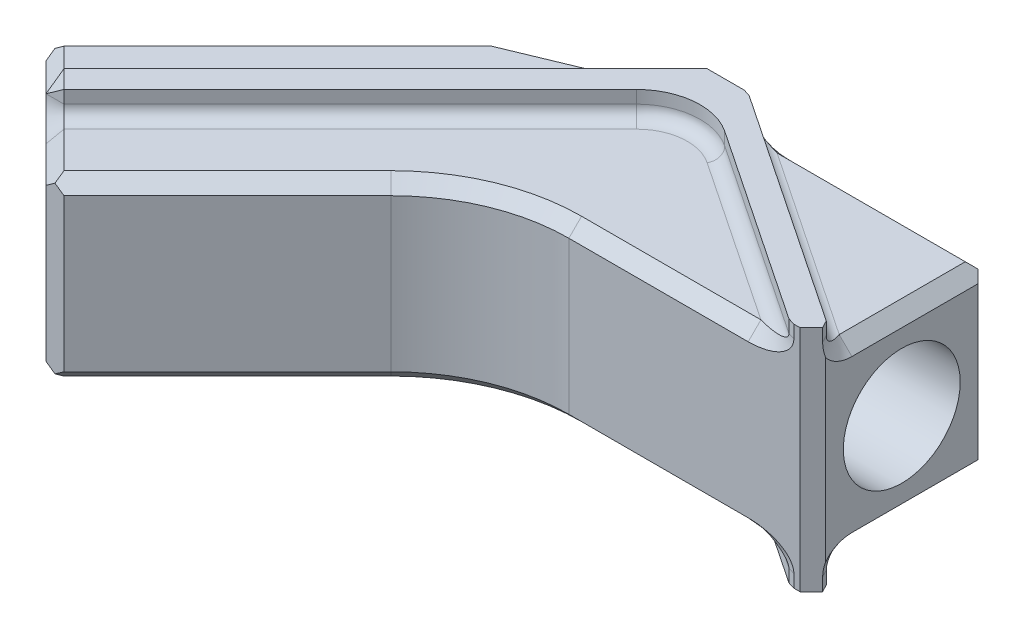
ISO-10303-21;
HEADER;
FILE_DESCRIPTION(('STEP AP214'),'2;1');
FILE_NAME('part.step','',(''),(''),'','','');
FILE_SCHEMA(('AUTOMOTIVE_DESIGN { 1 0 10303 214 1 1 1 1 }'));
ENDSEC;
DATA;
#1=APPLICATION_CONTEXT('core data for automotive mechanical design processes');
#2=APPLICATION_PROTOCOL_DEFINITION('international standard','automotive_design',2000,#1);
#3=PRODUCT_CONTEXT('',#1,'mechanical');
#4=PRODUCT('Part','Part','',(#3));
#5=PRODUCT_RELATED_PRODUCT_CATEGORY('part','',(#4));
#6=PRODUCT_DEFINITION_FORMATION('','',#4);
#7=PRODUCT_DEFINITION_CONTEXT('part definition',#1,'design');
#8=PRODUCT_DEFINITION('design','',#6,#7);
#9=PRODUCT_DEFINITION_SHAPE('','',#8);
#10=(LENGTH_UNIT() NAMED_UNIT(*) SI_UNIT(.MILLI.,.METRE.));
#11=(NAMED_UNIT(*) PLANE_ANGLE_UNIT() SI_UNIT($,.RADIAN.));
#12=(NAMED_UNIT(*) SI_UNIT($,.STERADIAN.) SOLID_ANGLE_UNIT());
#13=UNCERTAINTY_MEASURE_WITH_UNIT(LENGTH_MEASURE(1.E-05),#10,'distance_accuracy_value','');
#14=(GEOMETRIC_REPRESENTATION_CONTEXT(3) GLOBAL_UNCERTAINTY_ASSIGNED_CONTEXT((#13)) GLOBAL_UNIT_ASSIGNED_CONTEXT((#10,
#11,#12)) REPRESENTATION_CONTEXT('',''));
#15=CARTESIAN_POINT('',(0.,0.,0.));
#16=DIRECTION('',(0.,0.,1.));
#17=DIRECTION('',(1.,0.,0.));
#18=AXIS2_PLACEMENT_3D('',#15,#16,#17);
#19=CARTESIAN_POINT('',(0.,14.,0.));
#20=DIRECTION('',(0.,1.,0.));
#21=DIRECTION('',(0.,0.,1.));
#22=AXIS2_PLACEMENT_3D('',#19,#20,#21);
#23=PLANE('',#22);
#24=DIRECTION('',(0.707106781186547,0.,-0.707106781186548));
#25=VECTOR('',#24,1.);
#26=CARTESIAN_POINT('',(-3.53553390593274,14.,-3.53553390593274));
#27=LINE('',#26,#25);
#28=CARTESIAN_POINT('',(2.02871703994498,14.,-9.09978485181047));
#29=VERTEX_POINT('',#28);
#30=CARTESIAN_POINT('',(-20.5060966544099,14.,13.4350288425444));
#31=VERTEX_POINT('',#30);
#32=EDGE_CURVE('E1933',#29,#31,#27,.F.);
#33=ORIENTED_EDGE('',*,*,#32,.T.);
#34=DIRECTION('',(0.707106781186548,0.,0.707106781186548));
#35=VECTOR('',#34,1.);
#36=CARTESIAN_POINT('',(-16.9705627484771,14.,16.9705627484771));
#37=LINE('',#36,#35);
#38=CARTESIAN_POINT('',(-17.6776695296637,14.,16.2634559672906));
#39=VERTEX_POINT('',#38);
#40=EDGE_CURVE('E1808',#31,#39,#37,.T.);
#41=ORIENTED_EDGE('',*,*,#40,.T.);
#42=DIRECTION('',(0.707106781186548,0.,-0.707106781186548));
#43=VECTOR('',#42,1.);
#44=CARTESIAN_POINT('',(-0.707106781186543,14.,-0.707106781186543));
#45=LINE('',#44,#43);
#46=CARTESIAN_POINT('',(-4.80761184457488,14.,3.39339828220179));
#47=VERTEX_POINT('',#46);
#48=EDGE_CURVE('E1641',#39,#47,#45,.T.);
#49=ORIENTED_EDGE('',*,*,#48,.T.);
#50=CARTESIAN_POINT('',(5.79898987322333,14.,14.));
#51=DIRECTION('',(0.,1.,0.));
#52=DIRECTION('',(0.,0.,1.));
#53=AXIS2_PLACEMENT_3D('',#50,#51,#52);
#54=CIRCLE('',#53,15.);
#55=CARTESIAN_POINT('',(5.79898987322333,14.,-0.999999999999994));
#56=VERTEX_POINT('',#55);
#57=EDGE_CURVE('E1639',#47,#56,#54,.F.);
#58=ORIENTED_EDGE('',*,*,#57,.T.);
#59=DIRECTION('',(1.,0.,0.));
#60=VECTOR('',#59,1.);
#61=CARTESIAN_POINT('',(21.406386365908,14.,-0.999999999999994));
#62=LINE('',#61,#60);
#63=CARTESIAN_POINT('',(19.9135652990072,14.,-0.999999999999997));
#64=VERTEX_POINT('',#63);
#65=EDGE_CURVE('E1637',#56,#64,#62,.T.);
#66=ORIENTED_EDGE('',*,*,#65,.T.);
#67=DIRECTION('',(0.830818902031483,0.,0.556542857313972));
#68=VECTOR('',#67,1.);
#69=CARTESIAN_POINT('',(6.63041308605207,14.,-9.89802033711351));
#70=LINE('',#69,#68);
#71=CARTESIAN_POINT('',(7.08331559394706,14.,-9.59463333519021));
#72=VERTEX_POINT('',#71);
#73=EDGE_CURVE('E761',#64,#72,#70,.F.);
#74=ORIENTED_EDGE('',*,*,#73,.T.);
#75=CARTESIAN_POINT('',(4.85714416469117,14.,-6.27135772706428));
#76=DIRECTION('',(0.,1.,0.));
#77=DIRECTION('',(0.,0.,1.));
#78=AXIS2_PLACEMENT_3D('',#75,#76,#77);
#79=CIRCLE('',#78,4.);
#80=EDGE_CURVE('E1931',#72,#29,#79,.T.);
#81=ORIENTED_EDGE('',*,*,#80,.T.);
#82=EDGE_LOOP('',(#33,#41,#49,#58,#66,#74,#81));
#83=FACE_BOUND('',#82,.T.);
#84=ADVANCED_FACE('F49',(#83),#23,.T.);
#85=CARTESIAN_POINT('',(-21.920310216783,16.,13.4350288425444));
#86=DIRECTION('',(-0.707106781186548,0.,-0.707106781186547));
#87=DIRECTION('',(-0.707106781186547,0.,0.707106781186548));
#88=AXIS2_PLACEMENT_3D('',#85,#86,#87);
#89=PLANE('',#88);
#90=DIRECTION('',(0.707106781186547,0.,-0.707106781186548));
#91=VECTOR('',#90,1.);
#92=CARTESIAN_POINT('',(-21.920310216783,16.,13.4350288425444));
#93=LINE('',#92,#91);
#94=CARTESIAN_POINT('',(-21.2132034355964,16.,12.7279220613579));
#95=VERTEX_POINT('',#94);
#96=CARTESIAN_POINT('',(1.32161025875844,16.,-9.80689163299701));
#97=VERTEX_POINT('',#96);
#98=EDGE_CURVE('E1882',#95,#97,#93,.T.);
#99=ORIENTED_EDGE('',*,*,#98,.F.);
#100=DIRECTION('',(0.,-1.,0.));
#101=VECTOR('',#100,1.);
#102=CARTESIAN_POINT('',(-21.2132034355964,15.,12.7279220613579));
#103=LINE('',#102,#101);
#104=CARTESIAN_POINT('',(-21.2132034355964,15.,12.7279220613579));
#105=VERTEX_POINT('',#104);
#106=EDGE_CURVE('E1802',#95,#105,#103,.T.);
#107=ORIENTED_EDGE('',*,*,#106,.T.);
#108=DIRECTION('',(0.707106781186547,0.,-0.707106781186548));
#109=VECTOR('',#108,1.);
#110=CARTESIAN_POINT('',(-21.920310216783,15.,13.4350288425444));
#111=LINE('',#110,#109);
#112=CARTESIAN_POINT('',(1.32161025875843,15.,-9.80689163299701));
#113=VERTEX_POINT('',#112);
#114=EDGE_CURVE('E1927',#105,#113,#111,.T.);
#115=ORIENTED_EDGE('',*,*,#114,.T.);
#116=DIRECTION('',(0.,-1.,0.));
#117=VECTOR('',#116,1.);
#118=CARTESIAN_POINT('',(1.32161025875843,16.,-9.80689163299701));
#119=LINE('',#118,#117);
#120=EDGE_CURVE('E1910',#113,#97,#119,.F.);
#121=ORIENTED_EDGE('',*,*,#120,.T.);
#122=EDGE_LOOP('',(#99,#107,#115,#121));
#123=FACE_BOUND('',#122,.T.);
#124=ADVANCED_FACE('F1004',(#123),#89,.F.);
#125=CARTESIAN_POINT('',(0.,0.,0.));
#126=DIRECTION('',(0.,1.,0.));
#127=DIRECTION('',(0.,0.,1.));
#128=AXIS2_PLACEMENT_3D('',#125,#126,#127);
#129=PLANE('',#128);
#130=DIRECTION('',(1.,0.,0.));
#131=VECTOR('',#130,1.);
#132=CARTESIAN_POINT('',(25.,0.,-13.));
#133=LINE('',#132,#131);
#134=CARTESIAN_POINT('',(9.18693976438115,0.,-13.));
#135=VERTEX_POINT('',#134);
#136=CARTESIAN_POINT('',(24.,0.,-13.));
#137=VERTEX_POINT('',#136);
#138=EDGE_CURVE('E2963',#135,#137,#133,.T.);
#139=ORIENTED_EDGE('',*,*,#138,.T.);
#140=DIRECTION('',(0.,0.,1.));
#141=VECTOR('',#140,1.);
#142=CARTESIAN_POINT('',(24.,0.,0.));
#143=LINE('',#142,#141);
#144=CARTESIAN_POINT('',(24.,0.,-3.07713612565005));
#145=VERTEX_POINT('',#144);
#146=EDGE_CURVE('E882',#137,#145,#143,.T.);
#147=ORIENTED_EDGE('',*,*,#146,.T.);
#148=DIRECTION('',(0.830818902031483,0.,0.556542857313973));
#149=VECTOR('',#148,1.);
#150=CARTESIAN_POINT('',(6.45385473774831,0.,-14.8308189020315));
#151=LINE('',#150,#149);
#152=EDGE_CURVE('E919',#145,#135,#151,.F.);
#153=ORIENTED_EDGE('',*,*,#152,.T.);
#154=EDGE_LOOP('',(#139,#147,#153));
#155=FACE_BOUND('',#154,.T.);
#156=ADVANCED_FACE('F1012',(#155),#129,.F.);
#157=DIRECTION('',(-0.707106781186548,0.,0.707106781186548));
#158=VECTOR('',#157,1.);
#159=CARTESIAN_POINT('',(-18.3847763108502,0.,16.9705627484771));
#160=LINE('',#159,#158);
#161=CARTESIAN_POINT('',(-4.80761184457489,0.,3.39339828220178));
#162=VERTEX_POINT('',#161);
#163=CARTESIAN_POINT('',(-17.6776695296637,0.,16.2634559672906));
#164=VERTEX_POINT('',#163);
#165=EDGE_CURVE('E2266',#162,#164,#160,.T.);
#166=ORIENTED_EDGE('',*,*,#165,.T.);
#167=DIRECTION('',(-0.707106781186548,0.,-0.707106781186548));
#168=VECTOR('',#167,1.);
#169=CARTESIAN_POINT('',(-20.5060966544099,0.,13.4350288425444));
#170=LINE('',#169,#168);
#171=CARTESIAN_POINT('',(-20.5060966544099,0.,13.4350288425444));
#172=VERTEX_POINT('',#171);
#173=EDGE_CURVE('E1799',#164,#172,#170,.T.);
#174=ORIENTED_EDGE('',*,*,#173,.T.);
#175=DIRECTION('',(-0.707106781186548,0.,0.707106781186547));
#176=VECTOR('',#175,1.);
#177=CARTESIAN_POINT('',(2.02871703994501,0.,-9.09978485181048));
#178=LINE('',#177,#176);
#179=CARTESIAN_POINT('',(2.028717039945,0.,-9.09978485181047));
#180=VERTEX_POINT('',#179);
#181=EDGE_CURVE('E1662',#172,#180,#178,.F.);
#182=ORIENTED_EDGE('',*,*,#181,.T.);
#183=CARTESIAN_POINT('',(4.85714416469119,0.,-6.27135772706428));
#184=DIRECTION('',(0.,1.,0.));
#185=DIRECTION('',(0.,0.,1.));
#186=AXIS2_PLACEMENT_3D('',#183,#184,#185);
#187=CIRCLE('',#186,4.);
#188=CARTESIAN_POINT('',(7.08331559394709,0.,-9.59463333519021));
#189=VERTEX_POINT('',#188);
#190=EDGE_CURVE('E1604',#180,#189,#187,.F.);
#191=ORIENTED_EDGE('',*,*,#190,.T.);
#192=DIRECTION('',(0.830818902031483,0.,0.556542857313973));
#193=VECTOR('',#192,1.);
#194=CARTESIAN_POINT('',(6.63041308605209,0.,-9.89802033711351));
#195=LINE('',#194,#193);
#196=CARTESIAN_POINT('',(19.9135652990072,0.,-1.00000000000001));
#197=VERTEX_POINT('',#196);
#198=EDGE_CURVE('E1599',#189,#197,#195,.T.);
#199=ORIENTED_EDGE('',*,*,#198,.T.);
#200=DIRECTION('',(-1.,0.,0.));
#201=VECTOR('',#200,1.);
#202=CARTESIAN_POINT('',(0.,0.,-1.00000000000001));
#203=LINE('',#202,#201);
#204=CARTESIAN_POINT('',(5.79898987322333,0.,-1.00000000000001));
#205=VERTEX_POINT('',#204);
#206=EDGE_CURVE('E1598',#197,#205,#203,.T.);
#207=ORIENTED_EDGE('',*,*,#206,.T.);
#208=CARTESIAN_POINT('',(5.79898987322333,0.,14.));
#209=DIRECTION('',(0.,1.,0.));
#210=DIRECTION('',(0.,0.,1.));
#211=AXIS2_PLACEMENT_3D('',#208,#209,#210);
#212=CIRCLE('',#211,15.);
#213=EDGE_CURVE('E2268',#205,#162,#212,.T.);
#214=ORIENTED_EDGE('',*,*,#213,.T.);
#215=EDGE_LOOP('',(#166,#174,#182,#191,#199,#207,#214));
#216=FACE_BOUND('',#215,.T.);
#217=ADVANCED_FACE('F1041',(#216),#129,.F.);
#218=DIRECTION('',(0.707106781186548,0.,-0.707106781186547));
#219=VECTOR('',#218,1.);
#220=CARTESIAN_POINT('',(-24.0416305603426,0.,11.3137084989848));
#221=LINE('',#220,#219);
#222=CARTESIAN_POINT('',(0.323813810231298,0.,-13.0517358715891));
#223=VERTEX_POINT('',#222);
#224=CARTESIAN_POINT('',(-23.3345237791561,0.,10.6066017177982));
#225=VERTEX_POINT('',#224);
#226=EDGE_CURVE('E2129',#223,#225,#221,.F.);
#227=ORIENTED_EDGE('',*,*,#226,.T.);
#228=DIRECTION('',(-0.707106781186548,0.,-0.707106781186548));
#229=VECTOR('',#228,1.);
#230=CARTESIAN_POINT('',(-26.1629509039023,0.,7.77817459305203));
#231=LINE('',#230,#229);
#232=CARTESIAN_POINT('',(-26.1629509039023,0.,7.77817459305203));
#233=VERTEX_POINT('',#232);
#234=EDGE_CURVE('E1832',#225,#233,#231,.T.);
#235=ORIENTED_EDGE('',*,*,#234,.T.);
#236=DIRECTION('',(0.707106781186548,0.,-0.707106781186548));
#237=VECTOR('',#236,1.);
#238=CARTESIAN_POINT('',(-9.19238815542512,0.,-9.19238815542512));
#239=LINE('',#238,#237);
#240=CARTESIAN_POINT('',(-9.33304043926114,0.,-9.0517358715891));
#241=VERTEX_POINT('',#240);
#242=EDGE_CURVE('E2143',#233,#241,#239,.T.);
#243=ORIENTED_EDGE('',*,*,#242,.T.);
#244=DIRECTION('',(0.923879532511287,0.,-0.38268343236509));
#245=VECTOR('',#244,1.);
#246=CARTESIAN_POINT('',(0.382683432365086,0.,-13.0761204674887));
#247=LINE('',#246,#245);
#248=EDGE_CURVE('E2139',#241,#223,#247,.T.);
#249=ORIENTED_EDGE('',*,*,#248,.T.);
#250=EDGE_LOOP('',(#227,#235,#243,#249));
#251=FACE_BOUND('',#250,.T.);
#252=ADVANCED_FACE('F1019',(#251),#129,.F.);
#253=DIRECTION('',(-0.707106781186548,0.,0.707106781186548));
#254=VECTOR('',#253,1.);
#255=CARTESIAN_POINT('',(-26.8700576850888,14.,8.48528137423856));
#256=LINE('',#255,#254);
#257=CARTESIAN_POINT('',(-9.33304043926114,14.,-9.05173587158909));
#258=VERTEX_POINT('',#257);
#259=CARTESIAN_POINT('',(-26.1629509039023,14.,7.77817459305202));
#260=VERTEX_POINT('',#259);
#261=EDGE_CURVE('E1080',#258,#260,#256,.T.);
#262=ORIENTED_EDGE('',*,*,#261,.T.);
#263=DIRECTION('',(0.707106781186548,0.,0.707106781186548));
#264=VECTOR('',#263,1.);
#265=CARTESIAN_POINT('',(-16.9705627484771,14.,16.9705627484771));
#266=LINE('',#265,#264);
#267=CARTESIAN_POINT('',(-23.3345237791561,14.,10.6066017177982));
#268=VERTEX_POINT('',#267);
#269=EDGE_CURVE('E673',#260,#268,#266,.T.);
#270=ORIENTED_EDGE('',*,*,#269,.T.);
#271=DIRECTION('',(-0.707106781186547,0.,0.707106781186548));
#272=VECTOR('',#271,1.);
#273=CARTESIAN_POINT('',(-6.36396103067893,14.,-6.36396103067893));
#274=LINE('',#273,#272);
#275=CARTESIAN_POINT('',(0.323813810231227,14.,-13.0517358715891));
#276=VERTEX_POINT('',#275);
#277=EDGE_CURVE('E1654',#268,#276,#274,.F.);
#278=ORIENTED_EDGE('',*,*,#277,.T.);
#279=DIRECTION('',(-0.923879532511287,0.,0.38268343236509));
#280=VECTOR('',#279,1.);
#281=CARTESIAN_POINT('',(-4.56706403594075,14.,-11.0258679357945));
#282=LINE('',#281,#280);
#283=EDGE_CURVE('E1089',#276,#258,#282,.T.);
#284=ORIENTED_EDGE('',*,*,#283,.T.);
#285=EDGE_LOOP('',(#262,#270,#278,#284));
#286=FACE_BOUND('',#285,.T.);
#287=ADVANCED_FACE('F1007',(#286),#23,.T.);
#288=CARTESIAN_POINT('',(0.,14.,0.));
#289=DIRECTION('',(0.707106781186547,0.,0.707106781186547));
#290=DIRECTION('',(0.707106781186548,0.,-0.707106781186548));
#291=AXIS2_PLACEMENT_3D('',#288,#289,#290);
#292=PLANE('',#291);
#293=DIRECTION('',(-0.707106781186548,0.,0.707106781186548));
#294=VECTOR('',#293,1.);
#295=CARTESIAN_POINT('',(0.,13.,0.));
#296=LINE('',#295,#294);
#297=CARTESIAN_POINT('',(-4.10050506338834,13.,4.10050506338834));
#298=VERTEX_POINT('',#297);
#299=CARTESIAN_POINT('',(-16.9705627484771,13.,16.9705627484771));
#300=VERTEX_POINT('',#299);
#301=EDGE_CURVE('E2254',#298,#300,#296,.T.);
#302=ORIENTED_EDGE('',*,*,#301,.T.);
#303=DIRECTION('',(0.,-1.,0.));
#304=VECTOR('',#303,1.);
#305=CARTESIAN_POINT('',(-16.9705627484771,14.,16.9705627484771));
#306=LINE('',#305,#304);
#307=CARTESIAN_POINT('',(-16.9705627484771,1.,16.9705627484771));
#308=VERTEX_POINT('',#307);
#309=EDGE_CURVE('E1747',#300,#308,#306,.T.);
#310=ORIENTED_EDGE('',*,*,#309,.T.);
#311=DIRECTION('',(0.707106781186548,0.,-0.707106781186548));
#312=VECTOR('',#311,1.);
#313=CARTESIAN_POINT('',(-4.10050506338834,1.,4.10050506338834));
#314=LINE('',#313,#312);
#315=CARTESIAN_POINT('',(-4.10050506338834,1.,4.10050506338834));
#316=VERTEX_POINT('',#315);
#317=EDGE_CURVE('E1614',#308,#316,#314,.T.);
#318=ORIENTED_EDGE('',*,*,#317,.T.);
#319=DIRECTION('',(0.,-1.,0.));
#320=VECTOR('',#319,1.);
#321=CARTESIAN_POINT('',(-4.10050506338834,14.,4.10050506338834));
#322=LINE('',#321,#320);
#323=EDGE_CURVE('E1594',#316,#298,#322,.F.);
#324=ORIENTED_EDGE('',*,*,#323,.T.);
#325=EDGE_LOOP('',(#302,#310,#318,#324));
#326=FACE_BOUND('',#325,.T.);
#327=ADVANCED_FACE('F705',(#326),#292,.T.);
#328=CARTESIAN_POINT('',(0.,14.,0.));
#329=DIRECTION('',(0.,0.,-1.));
#330=DIRECTION('',(-1.,0.,0.));
#331=AXIS2_PLACEMENT_3D('',#328,#329,#330);
#332=PLANE('',#331);
#333=DIRECTION('',(-1.,0.,0.));
#334=VECTOR('',#333,1.);
#335=CARTESIAN_POINT('',(0.,-2.,0.));
#336=LINE('',#335,#334);
#337=CARTESIAN_POINT('',(24.,-2.,0.));
#338=VERTEX_POINT('',#337);
#339=CARTESIAN_POINT('',(23.5071789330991,-2.,0.));
#340=VERTEX_POINT('',#339);
#341=EDGE_CURVE('E3013',#338,#340,#336,.T.);
#342=ORIENTED_EDGE('',*,*,#341,.F.);
#343=DIRECTION('',(0.,1.,0.));
#344=VECTOR('',#343,1.);
#345=CARTESIAN_POINT('',(24.,14.,0.));
#346=LINE('',#345,#344);
#347=CARTESIAN_POINT('',(24.,16.,0.));
#348=VERTEX_POINT('',#347);
#349=EDGE_CURVE('E938',#338,#348,#346,.T.);
#350=ORIENTED_EDGE('',*,*,#349,.T.);
#351=DIRECTION('',(1.,0.,0.));
#352=VECTOR('',#351,1.);
#353=CARTESIAN_POINT('',(0.,16.,0.));
#354=LINE('',#353,#352);
#355=CARTESIAN_POINT('',(23.5071789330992,16.,0.));
#356=VERTEX_POINT('',#355);
#357=EDGE_CURVE('E1956',#356,#348,#354,.T.);
#358=ORIENTED_EDGE('',*,*,#357,.F.);
#359=DIRECTION('',(0.,-1.,0.));
#360=VECTOR('',#359,1.);
#361=CARTESIAN_POINT('',(23.5071789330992,14.,0.));
#362=LINE('',#361,#360);
#363=CARTESIAN_POINT('',(23.5071789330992,15.,0.));
#364=VERTEX_POINT('',#363);
#365=EDGE_CURVE('E729',#356,#364,#362,.T.);
#366=ORIENTED_EDGE('',*,*,#365,.T.);
#367=CARTESIAN_POINT('',(19.9135652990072,13.,0.));
#368=CARTESIAN_POINT('',(20.1487680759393,12.9999911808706,0.));
#369=CARTESIAN_POINT('',(20.3839611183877,13.0128920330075,0.));
#370=CARTESIAN_POINT('',(20.8453279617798,13.0639668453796,0.));
#371=CARTESIAN_POINT('',(21.0714826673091,13.102147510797,0.));
#372=CARTESIAN_POINT('',(21.5060807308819,13.2023343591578,0.));
#373=CARTESIAN_POINT('',(21.7145061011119,13.2643363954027,0.));
#374=CARTESIAN_POINT('',(22.1056340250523,13.4097851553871,0.));
#375=CARTESIAN_POINT('',(22.2883203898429,13.4932258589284,0.));
#376=CARTESIAN_POINT('',(22.6209473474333,13.6783470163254,0.));
#377=CARTESIAN_POINT('',(22.7708741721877,13.7800198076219,0.));
#378=CARTESIAN_POINT('',(23.0322174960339,13.9976992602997,0.));
#379=CARTESIAN_POINT('',(23.1436231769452,14.1136969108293,0.));
#380=CARTESIAN_POINT('',(23.3236395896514,14.3555693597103,0.));
#381=CARTESIAN_POINT('',(23.3922428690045,14.4814341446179,0.));
#382=CARTESIAN_POINT('',(23.4840144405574,14.7382045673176,0.));
#383=CARTESIAN_POINT('',(23.5071947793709,14.869099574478,0.));
#384=CARTESIAN_POINT('',(23.5071789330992,15.,0.));
#385=B_SPLINE_CURVE_WITH_KNOTS('',3,(#367,#368,#369,#370,#371,#372,#373,#374,#375,#376,#377,
#378,#379,#380,#381,#382,#383,#384),.UNSPECIFIED.,.F.,.F.,(4,2,2,2,2,2,2,2,4),(0.,
0.196349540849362,0.392699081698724,0.589048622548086,0.785398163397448,0.98174770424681,
1.17809724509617,1.37444678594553,1.5707963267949),.UNSPECIFIED.);
#386=CARTESIAN_POINT('',(19.9135652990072,13.,0.));
#387=VERTEX_POINT('',#386);
#388=EDGE_CURVE('E1621',#364,#387,#385,.F.);
#389=ORIENTED_EDGE('',*,*,#388,.T.);
#390=DIRECTION('',(-1.,0.,0.));
#391=VECTOR('',#390,1.);
#392=CARTESIAN_POINT('',(5.79898987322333,13.,0.));
#393=LINE('',#392,#391);
#394=CARTESIAN_POINT('',(5.79898987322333,13.,0.));
#395=VERTEX_POINT('',#394);
#396=EDGE_CURVE('E1619',#387,#395,#393,.T.);
#397=ORIENTED_EDGE('',*,*,#396,.T.);
#398=DIRECTION('',(0.,-1.,0.));
#399=VECTOR('',#398,1.);
#400=CARTESIAN_POINT('',(5.79898987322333,14.,0.));
#401=LINE('',#400,#399);
#402=CARTESIAN_POINT('',(5.79898987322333,1.,0.));
#403=VERTEX_POINT('',#402);
#404=EDGE_CURVE('E1574',#395,#403,#401,.T.);
#405=ORIENTED_EDGE('',*,*,#404,.T.);
#406=DIRECTION('',(1.,0.,0.));
#407=VECTOR('',#406,1.);
#408=CARTESIAN_POINT('',(0.,1.,0.));
#409=LINE('',#408,#407);
#410=CARTESIAN_POINT('',(19.9135652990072,1.,0.));
#411=VERTEX_POINT('',#410);
#412=EDGE_CURVE('E720',#403,#411,#409,.T.);
#413=ORIENTED_EDGE('',*,*,#412,.T.);
#414=CARTESIAN_POINT('',(23.5071789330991,-0.999999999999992,0.));
#415=CARTESIAN_POINT('',(23.5071947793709,-0.869099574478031,0.));
#416=CARTESIAN_POINT('',(23.4840144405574,-0.738204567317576,0.));
#417=CARTESIAN_POINT('',(23.3922428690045,-0.481434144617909,0.));
#418=CARTESIAN_POINT('',(23.3236395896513,-0.355569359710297,0.));
#419=CARTESIAN_POINT('',(23.1436231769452,-0.113696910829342,0.));
#420=CARTESIAN_POINT('',(23.0322174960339,0.00230073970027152,0.));
#421=CARTESIAN_POINT('',(22.7708741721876,0.219980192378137,0.));
#422=CARTESIAN_POINT('',(22.6209473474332,0.321652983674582,0.));
#423=CARTESIAN_POINT('',(22.2883203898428,0.506774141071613,0.));
#424=CARTESIAN_POINT('',(22.1056340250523,0.590214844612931,0.));
#425=CARTESIAN_POINT('',(21.7145061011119,0.735663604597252,0.));
#426=CARTESIAN_POINT('',(21.5060807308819,0.797665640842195,0.));
#427=CARTESIAN_POINT('',(21.071482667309,0.897852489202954,0.));
#428=CARTESIAN_POINT('',(20.8453279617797,0.936033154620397,0.));
#429=CARTESIAN_POINT('',(20.3839611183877,0.987107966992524,0.));
#430=CARTESIAN_POINT('',(20.1487680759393,1.00000881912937,0.));
#431=CARTESIAN_POINT('',(19.9135652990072,1.,0.));
#432=B_SPLINE_CURVE_WITH_KNOTS('',3,(#414,#415,#416,#417,#418,#419,#420,#421,#422,#423,#424,
#425,#426,#427,#428,#429,#430,#431),.UNSPECIFIED.,.F.,.F.,(4,2,2,2,2,2,2,2,4),(4.71238898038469,
4.90873852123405,5.10508806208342,5.30143760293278,5.49778714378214,5.6941366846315,
5.89048622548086,6.08683576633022,6.28318530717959),.UNSPECIFIED.);
#433=CARTESIAN_POINT('',(23.5071789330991,-0.999999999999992,0.));
#434=VERTEX_POINT('',#433);
#435=EDGE_CURVE('E728',#411,#434,#432,.F.);
#436=ORIENTED_EDGE('',*,*,#435,.T.);
#437=DIRECTION('',(0.,-1.,0.));
#438=VECTOR('',#437,1.);
#439=CARTESIAN_POINT('',(23.5071789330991,-2.,0.));
#440=LINE('',#439,#438);
#441=EDGE_CURVE('E732',#434,#340,#440,.T.);
#442=ORIENTED_EDGE('',*,*,#441,.T.);
#443=EDGE_LOOP('',(#342,#350,#358,#366,#389,#397,#405,#413,#436,#442));
#444=FACE_BOUND('',#443,.T.);
#445=ADVANCED_FACE('F698',(#444),#332,.F.);
#446=CARTESIAN_POINT('',(25.,14.,0.));
#447=DIRECTION('',(-1.,0.,0.));
#448=DIRECTION('',(0.,0.,1.));
#449=AXIS2_PLACEMENT_3D('',#446,#447,#448);
#450=PLANE('',#449);
#451=CARTESIAN_POINT('',(25.,15.,-0.669872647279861));
#452=CARTESIAN_POINT('',(25.,14.869099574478,-0.669862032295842));
#453=CARTESIAN_POINT('',(25.,14.7382045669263,-0.68538990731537));
#454=CARTESIAN_POINT('',(25.,14.4814341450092,-0.746865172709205));
#455=CARTESIAN_POINT('',(25.,14.3555693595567,-0.792820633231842));
#456=CARTESIAN_POINT('',(25.,14.1136969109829,-0.913408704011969));
#457=CARTESIAN_POINT('',(25.,13.9976992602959,-0.988036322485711));
#458=CARTESIAN_POINT('',(25.,13.7800198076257,-1.16310306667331));
#459=CARTESIAN_POINT('',(25.,13.6783470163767,-1.26353494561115));
#460=CARTESIAN_POINT('',(25.,13.4932258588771,-1.48635264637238));
#461=CARTESIAN_POINT('',(25.,13.4097851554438,-1.60872924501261));
#462=CARTESIAN_POINT('',(25.,13.264336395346,-1.87073514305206));
#463=CARTESIAN_POINT('',(25.,13.2023343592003,-2.01035359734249));
#464=CARTESIAN_POINT('',(25.,13.1021475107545,-2.30147895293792));
#465=CARTESIAN_POINT('',(25.,13.0639668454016,-2.45297380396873));
#466=CARTESIAN_POINT('',(25.,13.0128920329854,-2.76203083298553));
#467=CARTESIAN_POINT('',(25.,12.9999911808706,-2.91958021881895));
#468=CARTESIAN_POINT('',(25.,13.,-3.07713612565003));
#469=B_SPLINE_CURVE_WITH_KNOTS('',3,(#451,#452,#453,#454,#455,#456,#457,#458,#459,#460,#461,
#462,#463,#464,#465,#466,#467,#468),.UNSPECIFIED.,.F.,.F.,(4,2,2,2,2,2,2,2,4),(1.5707963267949,
1.76714586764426,1.96349540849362,2.15984494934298,2.35619449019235,2.55254403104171,
2.74889357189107,2.94524311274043,3.14159265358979),.UNSPECIFIED.);
#470=CARTESIAN_POINT('',(25.,13.,-3.07713612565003));
#471=VERTEX_POINT('',#470);
#472=CARTESIAN_POINT('',(25.,13.9891216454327,-0.999985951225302));
#473=VERTEX_POINT('',#472);
#474=EDGE_CURVE('E658',#471,#473,#469,.F.);
#475=ORIENTED_EDGE('',*,*,#474,.T.);
#476=DIRECTION('',(0.,-1.,0.));
#477=VECTOR('',#476,1.);
#478=CARTESIAN_POINT('',(25.,14.,-1.));
#479=LINE('',#478,#477);
#480=CARTESIAN_POINT('',(24.999999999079,0.0108729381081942,-0.999993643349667));
#481=VERTEX_POINT('',#480);
#482=EDGE_CURVE('E942',#473,#481,#479,.T.);
#483=ORIENTED_EDGE('',*,*,#482,.T.);
#484=CARTESIAN_POINT('',(25.,1.,-3.07713612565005));
#485=CARTESIAN_POINT('',(25.,1.00000881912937,-2.91958021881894));
#486=CARTESIAN_POINT('',(25.,0.987107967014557,-2.76203083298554));
#487=CARTESIAN_POINT('',(25.,0.936033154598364,-2.45297380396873));
#488=CARTESIAN_POINT('',(25.,0.897852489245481,-2.30147895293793));
#489=CARTESIAN_POINT('',(25.,0.797665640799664,-2.0103535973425));
#490=CARTESIAN_POINT('',(25.,0.735663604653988,-1.87073514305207));
#491=CARTESIAN_POINT('',(25.,0.590214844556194,-1.60872924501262));
#492=CARTESIAN_POINT('',(25.,0.506774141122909,-1.48635264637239));
#493=CARTESIAN_POINT('',(25.,0.321652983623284,-1.26353494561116));
#494=CARTESIAN_POINT('',(25.,0.219980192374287,-1.16310306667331));
#495=CARTESIAN_POINT('',(25.,0.00230073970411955,-0.98803632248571));
#496=CARTESIAN_POINT('',(25.,-0.113696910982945,-0.913408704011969));
#497=CARTESIAN_POINT('',(25.,-0.355569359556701,-0.792820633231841));
#498=CARTESIAN_POINT('',(25.,-0.481434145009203,-0.746865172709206));
#499=CARTESIAN_POINT('',(25.,-0.738204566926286,-0.685389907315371));
#500=CARTESIAN_POINT('',(25.,-0.869099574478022,-0.669862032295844));
#501=CARTESIAN_POINT('',(25.,-1.,-0.669872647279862));
#502=B_SPLINE_CURVE_WITH_KNOTS('',3,(#484,#485,#486,#487,#488,#489,#490,#491,#492,#493,#494,
#495,#496,#497,#498,#499,#500,#501),.UNSPECIFIED.,.F.,.F.,(4,2,2,2,2,2,2,2,4),(3.14159265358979,
3.33794219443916,3.53429173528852,3.73064127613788,3.92699081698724,4.1233403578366,
4.31968989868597,4.51603943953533,4.71238898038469),.UNSPECIFIED.);
#503=CARTESIAN_POINT('',(25.,1.,-3.07713612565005));
#504=VERTEX_POINT('',#503);
#505=EDGE_CURVE('E649',#481,#504,#502,.F.);
#506=ORIENTED_EDGE('',*,*,#505,.T.);
#507=DIRECTION('',(0.,0.,-1.));
#508=VECTOR('',#507,1.);
#509=CARTESIAN_POINT('',(25.,1.,0.));
#510=LINE('',#509,#508);
#511=CARTESIAN_POINT('',(25.,1.,-13.));
#512=VERTEX_POINT('',#511);
#513=EDGE_CURVE('E665',#504,#512,#510,.T.);
#514=ORIENTED_EDGE('',*,*,#513,.T.);
#515=DIRECTION('',(0.,1.,0.));
#516=VECTOR('',#515,1.);
#517=CARTESIAN_POINT('',(25.,13.,-13.));
#518=LINE('',#517,#516);
#519=CARTESIAN_POINT('',(25.,13.,-13.));
#520=VERTEX_POINT('',#519);
#521=EDGE_CURVE('E670',#512,#520,#518,.T.);
#522=ORIENTED_EDGE('',*,*,#521,.T.);
#523=DIRECTION('',(0.,0.,1.));
#524=VECTOR('',#523,1.);
#525=CARTESIAN_POINT('',(25.,13.,-2.40726347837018));
#526=LINE('',#525,#524);
#527=EDGE_CURVE('E666',#520,#471,#526,.T.);
#528=ORIENTED_EDGE('',*,*,#527,.T.);
#529=EDGE_LOOP('',(#475,#483,#506,#514,#522,#528));
#530=FACE_BOUND('',#529,.T.);
#531=CARTESIAN_POINT('',(25.,7.,-7.));
#532=DIRECTION('',(1.,0.,0.));
#533=DIRECTION('',(0.,0.,-1.));
#534=AXIS2_PLACEMENT_3D('',#531,#532,#533);
#535=CIRCLE('',#534,4.6);
#536=CARTESIAN_POINT('',(25.,7.,-11.6));
#537=VERTEX_POINT('',#536);
#538=EDGE_CURVE('E1890',#537,#537,#535,.T.);
#539=ORIENTED_EDGE('',*,*,#538,.F.);
#540=EDGE_LOOP('',(#539));
#541=FACE_BOUND('',#540,.T.);
#542=ADVANCED_FACE('F687',(#530,#541),#450,.F.);
#543=CARTESIAN_POINT('',(0.,14.,-14.));
#544=DIRECTION('',(0.,0.,-1.));
#545=DIRECTION('',(-1.,0.,0.));
#546=AXIS2_PLACEMENT_3D('',#543,#544,#545);
#547=PLANE('',#546);
#548=CARTESIAN_POINT('',(15.,11.,-14.));
#549=DIRECTION('',(0.,0.,-1.));
#550=DIRECTION('',(-1.,0.,0.));
#551=AXIS2_PLACEMENT_3D('',#548,#549,#550);
#552=CIRCLE('',#551,1.5);
#553=CARTESIAN_POINT('',(13.5,11.,-14.));
#554=VERTEX_POINT('',#553);
#555=EDGE_CURVE('E1702',#554,#554,#552,.T.);
#556=ORIENTED_EDGE('',*,*,#555,.F.);
#557=EDGE_LOOP('',(#556));
#558=FACE_BOUND('',#557,.T.);
#559=CARTESIAN_POINT('',(15.,3.,-14.));
#560=DIRECTION('',(0.,0.,-1.));
#561=DIRECTION('',(-1.,0.,0.));
#562=AXIS2_PLACEMENT_3D('',#559,#560,#561);
#563=CIRCLE('',#562,1.5);
#564=CARTESIAN_POINT('',(13.5,3.,-14.));
#565=VERTEX_POINT('',#564);
#566=EDGE_CURVE('E1706',#565,#565,#563,.T.);
#567=ORIENTED_EDGE('',*,*,#566,.F.);
#568=EDGE_LOOP('',(#567));
#569=FACE_BOUND('',#568,.T.);
#570=CARTESIAN_POINT('',(4.10050506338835,7.,-14.));
#571=DIRECTION('',(0.,0.,-1.));
#572=DIRECTION('',(-1.,0.,0.));
#573=AXIS2_PLACEMENT_3D('',#570,#571,#572);
#574=ELLIPSE('',#573,2.82842712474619,2.);
#575=CARTESIAN_POINT('',(1.27207793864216,7.,-14.));
#576=VERTEX_POINT('',#575);
#577=EDGE_CURVE('E1691',#576,#576,#574,.T.);
#578=ORIENTED_EDGE('',*,*,#577,.F.);
#579=EDGE_LOOP('',(#578));
#580=FACE_BOUND('',#579,.T.);
#581=DIRECTION('',(1.,0.,0.));
#582=VECTOR('',#581,1.);
#583=CARTESIAN_POINT('',(0.,13.,-14.));
#584=LINE('',#583,#582);
#585=CARTESIAN_POINT('',(9.18693976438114,13.,-14.));
#586=VERTEX_POINT('',#585);
#587=CARTESIAN_POINT('',(24.,13.,-14.));
#588=VERTEX_POINT('',#587);
#589=EDGE_CURVE('E827',#586,#588,#584,.T.);
#590=ORIENTED_EDGE('',*,*,#589,.T.);
#591=DIRECTION('',(0.,-1.,0.));
#592=VECTOR('',#591,1.);
#593=CARTESIAN_POINT('',(24.,1.,-14.));
#594=LINE('',#593,#592);
#595=CARTESIAN_POINT('',(24.,1.,-14.));
#596=VERTEX_POINT('',#595);
#597=EDGE_CURVE('E11',#588,#596,#594,.T.);
#598=ORIENTED_EDGE('',*,*,#597,.T.);
#599=DIRECTION('',(-1.,0.,0.));
#600=VECTOR('',#599,1.);
#601=CARTESIAN_POINT('',(7.69411869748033,1.,-14.));
#602=LINE('',#601,#600);
#603=CARTESIAN_POINT('',(9.18693976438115,1.,-14.));
#604=VERTEX_POINT('',#603);
#605=EDGE_CURVE('E805',#596,#604,#602,.T.);
#606=ORIENTED_EDGE('',*,*,#605,.T.);
#607=CARTESIAN_POINT('',(5.59332613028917,-0.999999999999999,-14.));
#608=CARTESIAN_POINT('',(5.59331028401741,-0.869099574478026,-14.));
#609=CARTESIAN_POINT('',(5.61649062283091,-0.738204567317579,-14.));
#610=CARTESIAN_POINT('',(5.70826219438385,-0.481434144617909,-14.));
#611=CARTESIAN_POINT('',(5.776865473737,-0.355569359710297,-14.));
#612=CARTESIAN_POINT('',(5.95688188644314,-0.113696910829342,-14.));
#613=CARTESIAN_POINT('',(6.06828756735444,0.00230073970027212,-14.));
#614=CARTESIAN_POINT('',(6.32963089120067,0.219980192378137,-14.));
#615=CARTESIAN_POINT('',(6.47955771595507,0.32165298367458,-14.));
#616=CARTESIAN_POINT('',(6.8121846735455,0.506774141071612,-14.));
#617=CARTESIAN_POINT('',(6.99487103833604,0.59021484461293,-14.));
#618=CARTESIAN_POINT('',(7.38599896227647,0.735663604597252,-14.));
#619=CARTESIAN_POINT('',(7.59442433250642,0.797665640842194,-14.));
#620=CARTESIAN_POINT('',(8.02902239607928,0.897852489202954,-14.));
#621=CARTESIAN_POINT('',(8.25517710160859,0.936033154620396,-14.));
#622=CARTESIAN_POINT('',(8.7165439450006,0.987107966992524,-14.));
#623=CARTESIAN_POINT('',(8.95173698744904,1.00000881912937,-14.));
#624=CARTESIAN_POINT('',(9.18693976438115,1.,-14.));
#625=B_SPLINE_CURVE_WITH_KNOTS('',3,(#607,#608,#609,#610,#611,#612,#613,#614,#615,#616,#617,
#618,#619,#620,#621,#622,#623,#624),.UNSPECIFIED.,.F.,.F.,(4,2,2,2,2,2,2,2,4),(0.,
0.196349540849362,0.392699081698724,0.589048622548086,0.785398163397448,0.98174770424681,
1.17809724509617,1.37444678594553,1.5707963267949),.UNSPECIFIED.);
#626=CARTESIAN_POINT('',(5.59332613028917,-0.999999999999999,-14.));
#627=VERTEX_POINT('',#626);
#628=EDGE_CURVE('E814',#604,#627,#625,.F.);
#629=ORIENTED_EDGE('',*,*,#628,.T.);
#630=DIRECTION('',(0.,-1.,0.));
#631=VECTOR('',#630,1.);
#632=CARTESIAN_POINT('',(5.59332613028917,-2.,-14.));
#633=LINE('',#632,#631);
#634=CARTESIAN_POINT('',(5.59332613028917,-2.,-14.));
#635=VERTEX_POINT('',#634);
#636=EDGE_CURVE('E824',#627,#635,#633,.T.);
#637=ORIENTED_EDGE('',*,*,#636,.T.);
#638=DIRECTION('',(1.,0.,0.));
#639=VECTOR('',#638,1.);
#640=CARTESIAN_POINT('',(2.68629150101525,-2.,-14.));
#641=LINE('',#640,#639);
#642=CARTESIAN_POINT('',(2.68629150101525,-2.,-14.));
#643=VERTEX_POINT('',#642);
#644=EDGE_CURVE('E1990',#643,#635,#641,.T.);
#645=ORIENTED_EDGE('',*,*,#644,.F.);
#646=DIRECTION('',(0.,1.,0.));
#647=VECTOR('',#646,1.);
#648=CARTESIAN_POINT('',(2.68629150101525,-2.,-14.));
#649=LINE('',#648,#647);
#650=CARTESIAN_POINT('',(2.68629150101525,-1.,-14.));
#651=VERTEX_POINT('',#650);
#652=EDGE_CURVE('E1989',#643,#651,#649,.T.);
#653=ORIENTED_EDGE('',*,*,#652,.T.);
#654=CARTESIAN_POINT('',(1.27207793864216,-1.,-14.));
#655=DIRECTION('',(0.,0.,-1.));
#656=DIRECTION('',(-1.,0.,0.));
#657=AXIS2_PLACEMENT_3D('',#654,#655,#656);
#658=ELLIPSE('',#657,1.4142135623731,1.);
#659=CARTESIAN_POINT('',(1.76745710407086,-0.0633571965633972,-14.));
#660=VERTEX_POINT('',#659);
#661=EDGE_CURVE('E1565',#651,#660,#658,.F.);
#662=ORIENTED_EDGE('',*,*,#661,.T.);
#663=CARTESIAN_POINT('',(3.44036773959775E-08,0.999860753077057,-14.));
#664=CARTESIAN_POINT('',(0.0834699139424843,0.967201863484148,-13.9999989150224));
#665=CARTESIAN_POINT('',(0.166268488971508,0.932820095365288,-13.9999956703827));
#666=CARTESIAN_POINT('',(0.328441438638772,0.861455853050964,-13.9999898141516));
#667=CARTESIAN_POINT('',(0.407850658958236,0.824552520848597,-13.9999871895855));
#668=CARTESIAN_POINT('',(0.563082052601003,0.748439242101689,-13.9999870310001));
#669=CARTESIAN_POINT('',(0.638944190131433,0.709310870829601,-13.9999893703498));
#670=CARTESIAN_POINT('',(0.786945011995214,0.629031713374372,-13.9999961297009));
#671=CARTESIAN_POINT('',(0.859128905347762,0.587964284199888,-14.0000004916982));
#672=CARTESIAN_POINT('',(1.00810842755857,0.499042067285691,-13.9999994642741));
#673=CARTESIAN_POINT('',(1.08473824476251,0.450908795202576,-13.9999931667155));
#674=CARTESIAN_POINT('',(1.23344532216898,0.352568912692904,-13.9999826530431));
#675=CARTESIAN_POINT('',(1.3055901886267,0.302464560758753,-13.9999783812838));
#676=CARTESIAN_POINT('',(1.44520310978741,0.200545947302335,-13.9999788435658));
#677=CARTESIAN_POINT('',(1.5127469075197,0.148835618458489,-13.9999832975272));
#678=CARTESIAN_POINT('',(1.64305730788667,0.044057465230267,-13.9999929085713));
#679=CARTESIAN_POINT('',(1.70590820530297,-0.00890561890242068,-13.9999980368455));
#680=CARTESIAN_POINT('',(1.76745869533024,-0.0633508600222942,-14.0000001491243));
#681=B_SPLINE_CURVE_WITH_KNOTS('',3,(#663,#664,#665,#666,#667,#668,#669,#670,#671,#672,#673,
#674,#675,#676,#677,#678,#679,#680),.UNSPECIFIED.,.F.,.F.,(4,2,2,2,2,2,2,2,4),(0.,
0.268879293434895,0.531501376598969,0.787504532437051,1.03658154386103,1.30796146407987,
1.57137954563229,1.82648078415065,2.07297112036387),.UNSPECIFIED.);
#682=CARTESIAN_POINT('',(0.,0.999860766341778,-14.));
#683=VERTEX_POINT('',#682);
#684=EDGE_CURVE('E815',#660,#683,#681,.F.);
#685=ORIENTED_EDGE('',*,*,#684,.T.);
#686=DIRECTION('',(0.,-1.,0.));
#687=VECTOR('',#686,1.);
#688=CARTESIAN_POINT('',(0.,14.,-14.));
#689=LINE('',#688,#687);
#690=CARTESIAN_POINT('',(0.,13.0001392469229,-14.));
#691=VERTEX_POINT('',#690);
#692=EDGE_CURVE('E1576',#691,#683,#689,.T.);
#693=ORIENTED_EDGE('',*,*,#692,.F.);
#694=CARTESIAN_POINT('',(1.76745869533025,14.0633508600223,-14.0000001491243));
#695=CARTESIAN_POINT('',(1.70590588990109,14.0089035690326,-13.9999980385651));
#696=CARTESIAN_POINT('',(1.64305257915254,13.9559385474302,-13.9999929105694));
#697=CARTESIAN_POINT('',(1.51273700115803,13.851156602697,-13.9999832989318));
#698=CARTESIAN_POINT('',(1.44519042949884,13.7994444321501,-13.9999788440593));
#699=CARTESIAN_POINT('',(1.3055716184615,13.6975222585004,-13.9999783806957));
#700=CARTESIAN_POINT('',(1.23342362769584,13.6474162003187,-13.9999826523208));
#701=CARTESIAN_POINT('',(1.08470997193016,13.5490730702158,-13.9999931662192));
#702=CARTESIAN_POINT('',(1.00807669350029,13.5009382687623,-13.9999994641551));
#703=CARTESIAN_POINT('',(0.859096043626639,13.4120167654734,-14.0000004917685));
#704=CARTESIAN_POINT('',(0.786914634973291,13.3709513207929,-13.9999961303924));
#705=CARTESIAN_POINT('',(0.638919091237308,13.2906760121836,-13.9999893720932));
#706=CARTESIAN_POINT('',(0.563059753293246,13.2515494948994,-13.9999870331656));
#707=CARTESIAN_POINT('',(0.407834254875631,13.1754397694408,-13.9999871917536));
#708=CARTESIAN_POINT('',(0.328428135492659,13.1385381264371,-13.9999898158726));
#709=CARTESIAN_POINT('',(0.166261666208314,13.0671770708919,-13.9999956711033));
#710=CARTESIAN_POINT('',(0.0834664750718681,13.0327967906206,-13.9999989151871));
#711=CARTESIAN_POINT('',(3.44036741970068E-08,13.0001392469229,-14.));
#712=B_SPLINE_CURVE_WITH_KNOTS('',3,(#694,#695,#696,#697,#698,#699,#700,#701,#702,#703,#704,
#705,#706,#707,#708,#709,#710,#711),.UNSPECIFIED.,.F.,.F.,(4,2,2,2,2,2,2,2,4),(0.,
0.246499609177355,0.501610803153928,0.765039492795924,1.03643063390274,1.28549823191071,
1.54149138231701,1.8041029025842,2.07297111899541),.UNSPECIFIED.);
#713=CARTESIAN_POINT('',(1.76745846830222,14.0633575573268,-14.));
#714=VERTEX_POINT('',#713);
#715=EDGE_CURVE('E1538',#691,#714,#712,.F.);
#716=ORIENTED_EDGE('',*,*,#715,.T.);
#717=CARTESIAN_POINT('',(1.27207793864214,15.,-14.));
#718=DIRECTION('',(0.,0.,-1.));
#719=DIRECTION('',(-1.,0.,0.));
#720=AXIS2_PLACEMENT_3D('',#717,#718,#719);
#721=ELLIPSE('',#720,1.41421356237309,1.);
#722=CARTESIAN_POINT('',(2.68629150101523,15.,-14.));
#723=VERTEX_POINT('',#722);
#724=EDGE_CURVE('E1653',#714,#723,#721,.F.);
#725=ORIENTED_EDGE('',*,*,#724,.T.);
#726=DIRECTION('',(0.,-1.,0.));
#727=VECTOR('',#726,1.);
#728=CARTESIAN_POINT('',(2.68629150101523,16.,-14.));
#729=LINE('',#728,#727);
#730=CARTESIAN_POINT('',(2.68629150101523,16.,-14.));
#731=VERTEX_POINT('',#730);
#732=EDGE_CURVE('E1876',#731,#723,#729,.T.);
#733=ORIENTED_EDGE('',*,*,#732,.F.);
#734=DIRECTION('',(-1.,0.,0.));
#735=VECTOR('',#734,1.);
#736=CARTESIAN_POINT('',(5.51471862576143,16.,-14.));
#737=LINE('',#736,#735);
#738=CARTESIAN_POINT('',(5.59332613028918,16.,-14.));
#739=VERTEX_POINT('',#738);
#740=EDGE_CURVE('E1873',#739,#731,#737,.T.);
#741=ORIENTED_EDGE('',*,*,#740,.F.);
#742=DIRECTION('',(0.,-1.,0.));
#743=VECTOR('',#742,1.);
#744=CARTESIAN_POINT('',(5.59332613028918,14.,-14.));
#745=LINE('',#744,#743);
#746=CARTESIAN_POINT('',(5.59332613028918,15.,-14.));
#747=VERTEX_POINT('',#746);
#748=EDGE_CURVE('E848',#739,#747,#745,.T.);
#749=ORIENTED_EDGE('',*,*,#748,.T.);
#750=CARTESIAN_POINT('',(9.18693976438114,13.,-14.));
#751=CARTESIAN_POINT('',(8.95173698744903,12.9999911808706,-14.));
#752=CARTESIAN_POINT('',(8.71654394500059,13.0128920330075,-14.));
#753=CARTESIAN_POINT('',(8.25517710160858,13.0639668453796,-14.));
#754=CARTESIAN_POINT('',(8.02902239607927,13.1021475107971,-14.));
#755=CARTESIAN_POINT('',(7.59442433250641,13.2023343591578,-14.));
#756=CARTESIAN_POINT('',(7.38599896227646,13.2643363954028,-14.));
#757=CARTESIAN_POINT('',(6.99487103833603,13.4097851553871,-14.));
#758=CARTESIAN_POINT('',(6.81218467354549,13.4932258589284,-14.));
#759=CARTESIAN_POINT('',(6.47955771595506,13.6783470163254,-14.));
#760=CARTESIAN_POINT('',(6.32963089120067,13.7800198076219,-14.));
#761=CARTESIAN_POINT('',(6.06828756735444,13.9976992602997,-14.));
#762=CARTESIAN_POINT('',(5.95688188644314,14.1136969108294,-14.));
#763=CARTESIAN_POINT('',(5.776865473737,14.3555693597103,-14.));
#764=CARTESIAN_POINT('',(5.70826219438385,14.4814341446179,-14.));
#765=CARTESIAN_POINT('',(5.61649062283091,14.7382045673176,-14.));
#766=CARTESIAN_POINT('',(5.59331028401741,14.869099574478,-14.));
#767=CARTESIAN_POINT('',(5.59332613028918,15.,-14.));
#768=B_SPLINE_CURVE_WITH_KNOTS('',3,(#750,#751,#752,#753,#754,#755,#756,#757,#758,#759,#760,
#761,#762,#763,#764,#765,#766,#767),.UNSPECIFIED.,.F.,.F.,(4,2,2,2,2,2,2,2,4),(-1.5707963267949,
-1.37444678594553,-1.17809724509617,-0.98174770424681,-0.785398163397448,-0.589048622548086,
-0.392699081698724,-0.196349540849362,0.),.UNSPECIFIED.);
#769=EDGE_CURVE('E835',#747,#586,#768,.F.);
#770=ORIENTED_EDGE('',*,*,#769,.T.);
#771=EDGE_LOOP('',(#590,#598,#606,#629,#637,#645,#653,#662,#685,#693,#716,#725,#733,#741,#749,#770));
#772=FACE_BOUND('',#771,.T.);
#773=ADVANCED_FACE('F697',(#558,#569,#580,#772),#547,.T.);
#774=CARTESIAN_POINT('',(-4.94974746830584,14.,-11.9497474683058));
#775=DIRECTION('',(-0.38268343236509,0.,-0.923879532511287));
#776=DIRECTION('',(-0.923879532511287,0.,0.38268343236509));
#777=AXIS2_PLACEMENT_3D('',#774,#775,#776);
#778=PLANE('',#777);
#779=ORIENTED_EDGE('',*,*,#692,.T.);
#780=CARTESIAN_POINT('',(-0.0588696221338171,1.,-13.9756154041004));
#781=CARTESIAN_POINT('',(0.545970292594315,1.00011705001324,-14.2261482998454));
#782=CARTESIAN_POINT('',(1.15058201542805,0.952501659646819,-14.4765866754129));
#783=CARTESIAN_POINT('',(1.71311542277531,0.860449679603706,-14.7095956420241));
#784=B_SPLINE_CURVE_WITH_KNOTS('',3,(#780,#781,#782,#783),.UNSPECIFIED.,.F.,.F.,(4,4),
(1.5707963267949,1.94656762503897),.UNSPECIFIED.);
#785=CARTESIAN_POINT('',(-0.058869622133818,1.,-13.9756154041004));
#786=VERTEX_POINT('',#785);
#787=EDGE_CURVE('E1065',#683,#786,#784,.F.);
#788=ORIENTED_EDGE('',*,*,#787,.T.);
#789=DIRECTION('',(-0.923879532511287,0.,0.38268343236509));
#790=VECTOR('',#789,1.);
#791=CARTESIAN_POINT('',(-9.89949493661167,1.,-9.89949493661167));
#792=LINE('',#791,#790);
#793=CARTESIAN_POINT('',(-9.89949493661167,1.,-9.89949493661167));
#794=VERTEX_POINT('',#793);
#795=EDGE_CURVE('E1057',#786,#794,#792,.T.);
#796=ORIENTED_EDGE('',*,*,#795,.T.);
#797=DIRECTION('',(0.,-1.,0.));
#798=VECTOR('',#797,1.);
#799=CARTESIAN_POINT('',(-9.89949493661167,14.,-9.89949493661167));
#800=LINE('',#799,#798);
#801=CARTESIAN_POINT('',(-9.89949493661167,13.,-9.89949493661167));
#802=VERTEX_POINT('',#801);
#803=EDGE_CURVE('E1898',#802,#794,#800,.T.);
#804=ORIENTED_EDGE('',*,*,#803,.F.);
#805=DIRECTION('',(0.923879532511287,0.,-0.38268343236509));
#806=VECTOR('',#805,1.);
#807=CARTESIAN_POINT('',(-4.94974746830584,13.,-11.9497474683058));
#808=LINE('',#807,#806);
#809=CARTESIAN_POINT('',(-0.0588696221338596,13.,-13.9756154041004));
#810=VERTEX_POINT('',#809);
#811=EDGE_CURVE('E1066',#802,#810,#808,.T.);
#812=ORIENTED_EDGE('',*,*,#811,.T.);
#813=CARTESIAN_POINT('',(1.7131154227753,13.1395503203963,-14.7095956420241));
#814=CARTESIAN_POINT('',(1.15058201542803,13.0474983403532,-14.4765866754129));
#815=CARTESIAN_POINT('',(0.545970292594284,12.9998829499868,-14.2261482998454));
#816=CARTESIAN_POINT('',(-0.0588696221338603,13.,-13.9756154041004));
#817=B_SPLINE_CURVE_WITH_KNOTS('',3,(#813,#814,#815,#816),.UNSPECIFIED.,.F.,.F.,(4,4),
(4.33661768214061,4.71238898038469),.UNSPECIFIED.);
#818=EDGE_CURVE('E2158',#810,#691,#817,.F.);
#819=ORIENTED_EDGE('',*,*,#818,.T.);
#820=EDGE_LOOP('',(#779,#788,#796,#804,#812,#819));
#821=FACE_BOUND('',#820,.T.);
#822=ADVANCED_FACE('F1037',(#821),#778,.T.);
#823=CARTESIAN_POINT('',(-9.89949493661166,14.,-9.89949493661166));
#824=DIRECTION('',(0.707106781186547,0.,0.707106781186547));
#825=DIRECTION('',(0.707106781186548,0.,-0.707106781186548));
#826=AXIS2_PLACEMENT_3D('',#823,#824,#825);
#827=PLANE('',#826);
#828=DIRECTION('',(-0.707106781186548,0.,0.707106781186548));
#829=VECTOR('',#828,1.);
#830=CARTESIAN_POINT('',(-9.89949493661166,0.999999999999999,-9.89949493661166));
#831=LINE('',#830,#829);
#832=CARTESIAN_POINT('',(-26.8700576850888,0.999999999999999,7.07106781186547));
#833=VERTEX_POINT('',#832);
#834=EDGE_CURVE('E2137',#794,#833,#831,.T.);
#835=ORIENTED_EDGE('',*,*,#834,.T.);
#836=DIRECTION('',(0.,1.,0.));
#837=VECTOR('',#836,1.);
#838=CARTESIAN_POINT('',(-26.8700576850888,13.,7.07106781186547));
#839=LINE('',#838,#837);
#840=CARTESIAN_POINT('',(-26.8700576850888,13.,7.07106781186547));
#841=VERTEX_POINT('',#840);
#842=EDGE_CURVE('E1817',#833,#841,#839,.T.);
#843=ORIENTED_EDGE('',*,*,#842,.T.);
#844=DIRECTION('',(0.707106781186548,0.,-0.707106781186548));
#845=VECTOR('',#844,1.);
#846=CARTESIAN_POINT('',(-9.89949493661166,13.,-9.89949493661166));
#847=LINE('',#846,#845);
#848=EDGE_CURVE('E2961',#841,#802,#847,.T.);
#849=ORIENTED_EDGE('',*,*,#848,.T.);
#850=ORIENTED_EDGE('',*,*,#803,.T.);
#851=EDGE_LOOP('',(#835,#843,#849,#850));
#852=FACE_BOUND('',#851,.T.);
#853=ADVANCED_FACE('F1031',(#852),#827,.F.);
#854=CARTESIAN_POINT('',(-17.6776695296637,14.,17.6776695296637));
#855=DIRECTION('',(-0.707106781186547,0.,0.707106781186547));
#856=DIRECTION('',(0.707106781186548,0.,0.707106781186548));
#857=AXIS2_PLACEMENT_3D('',#854,#855,#856);
#858=PLANE('',#857);
#859=CARTESIAN_POINT('',(-21.2132034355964,-1.,14.1421356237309));
#860=DIRECTION('',(-0.707106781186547,0.,0.707106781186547));
#861=DIRECTION('',(0.707106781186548,0.,0.707106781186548));
#862=AXIS2_PLACEMENT_3D('',#859,#860,#861);
#863=CIRCLE('',#862,1.99999999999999);
#864=CARTESIAN_POINT('',(-22.6274169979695,-1.,12.7279220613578));
#865=VERTEX_POINT('',#864);
#866=CARTESIAN_POINT('',(-21.2132034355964,0.999999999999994,14.1421356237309));
#867=VERTEX_POINT('',#866);
#868=EDGE_CURVE('E1777',#865,#867,#863,.F.);
#869=ORIENTED_EDGE('',*,*,#868,.T.);
#870=DIRECTION('',(0.707106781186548,0.,0.707106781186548));
#871=VECTOR('',#870,1.);
#872=CARTESIAN_POINT('',(-18.3847763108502,0.999999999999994,16.9705627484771));
#873=LINE('',#872,#871);
#874=CARTESIAN_POINT('',(-18.3847763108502,0.999999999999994,16.9705627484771));
#875=VERTEX_POINT('',#874);
#876=EDGE_CURVE('E1784',#867,#875,#873,.T.);
#877=ORIENTED_EDGE('',*,*,#876,.T.);
#878=DIRECTION('',(0.,1.,0.));
#879=VECTOR('',#878,1.);
#880=CARTESIAN_POINT('',(-18.3847763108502,14.,16.9705627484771));
#881=LINE('',#880,#879);
#882=CARTESIAN_POINT('',(-18.3847763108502,13.,16.9705627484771));
#883=VERTEX_POINT('',#882);
#884=EDGE_CURVE('E1780',#875,#883,#881,.T.);
#885=ORIENTED_EDGE('',*,*,#884,.T.);
#886=DIRECTION('',(-0.707106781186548,0.,-0.707106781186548));
#887=VECTOR('',#886,1.);
#888=CARTESIAN_POINT('',(-17.6776695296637,13.,17.6776695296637));
#889=LINE('',#888,#887);
#890=CARTESIAN_POINT('',(-21.2132034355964,13.,14.1421356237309));
#891=VERTEX_POINT('',#890);
#892=EDGE_CURVE('E1774',#883,#891,#889,.T.);
#893=ORIENTED_EDGE('',*,*,#892,.T.);
#894=CARTESIAN_POINT('',(-21.2132034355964,15.,14.1421356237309));
#895=DIRECTION('',(-0.707106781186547,0.,0.707106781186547));
#896=DIRECTION('',(0.707106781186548,0.,0.707106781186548));
#897=AXIS2_PLACEMENT_3D('',#894,#895,#896);
#898=CIRCLE('',#897,1.99999999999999);
#899=CARTESIAN_POINT('',(-22.6274169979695,15.,12.7279220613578));
#900=VERTEX_POINT('',#899);
#901=EDGE_CURVE('E1765',#891,#900,#898,.F.);
#902=ORIENTED_EDGE('',*,*,#901,.T.);
#903=CARTESIAN_POINT('',(-24.0416305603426,15.,11.3137084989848));
#904=DIRECTION('',(-0.707106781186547,0.,0.707106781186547));
#905=DIRECTION('',(0.707106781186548,0.,0.707106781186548));
#906=AXIS2_PLACEMENT_3D('',#903,#904,#905);
#907=CIRCLE('',#906,1.99999999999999);
#908=CARTESIAN_POINT('',(-24.0416305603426,13.,11.3137084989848));
#909=VERTEX_POINT('',#908);
#910=EDGE_CURVE('E1759',#900,#909,#907,.F.);
#911=ORIENTED_EDGE('',*,*,#910,.T.);
#912=DIRECTION('',(-0.707106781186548,0.,-0.707106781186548));
#913=VECTOR('',#912,1.);
#914=CARTESIAN_POINT('',(-17.6776695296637,13.,17.6776695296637));
#915=LINE('',#914,#913);
#916=CARTESIAN_POINT('',(-26.8700576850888,13.,8.48528137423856));
#917=VERTEX_POINT('',#916);
#918=EDGE_CURVE('E1756',#909,#917,#915,.T.);
#919=ORIENTED_EDGE('',*,*,#918,.T.);
#920=DIRECTION('',(0.,-1.,0.));
#921=VECTOR('',#920,1.);
#922=CARTESIAN_POINT('',(-26.8700576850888,0.999999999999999,8.48528137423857));
#923=LINE('',#922,#921);
#924=CARTESIAN_POINT('',(-26.8700576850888,0.999999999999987,8.48528137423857));
#925=VERTEX_POINT('',#924);
#926=EDGE_CURVE('E1762',#917,#925,#923,.T.);
#927=ORIENTED_EDGE('',*,*,#926,.T.);
#928=DIRECTION('',(0.707106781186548,0.,0.707106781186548));
#929=VECTOR('',#928,1.);
#930=CARTESIAN_POINT('',(-24.0416305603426,0.999999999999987,11.3137084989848));
#931=LINE('',#930,#929);
#932=CARTESIAN_POINT('',(-24.0416305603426,0.999999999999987,11.3137084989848));
#933=VERTEX_POINT('',#932);
#934=EDGE_CURVE('E1768',#925,#933,#931,.T.);
#935=ORIENTED_EDGE('',*,*,#934,.T.);
#936=CARTESIAN_POINT('',(-24.0416305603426,-1.,11.3137084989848));
#937=DIRECTION('',(-0.707106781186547,0.,0.707106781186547));
#938=DIRECTION('',(0.707106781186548,0.,0.707106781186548));
#939=AXIS2_PLACEMENT_3D('',#936,#937,#938);
#940=CIRCLE('',#939,1.99999999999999);
#941=EDGE_CURVE('E1771',#933,#865,#940,.F.);
#942=ORIENTED_EDGE('',*,*,#941,.T.);
#943=EDGE_LOOP('',(#869,#877,#885,#893,#902,#911,#919,#927,#935,#942));
#944=FACE_BOUND('',#943,.T.);
#945=CARTESIAN_POINT('',(-22.6274169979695,7.,12.7279220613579));
#946=DIRECTION('',(-0.707106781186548,0.,0.707106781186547));
#947=DIRECTION('',(0.707106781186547,0.,0.707106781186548));
#948=AXIS2_PLACEMENT_3D('',#945,#946,#947);
#949=CIRCLE('',#948,4.1);
#950=CARTESIAN_POINT('',(-19.7282791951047,7.,15.6270598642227));
#951=VERTEX_POINT('',#950);
#952=EDGE_CURVE('E1880',#951,#951,#949,.T.);
#953=ORIENTED_EDGE('',*,*,#952,.F.);
#954=EDGE_LOOP('',(#953));
#955=FACE_BOUND('',#954,.T.);
#956=ADVANCED_FACE('F1023',(#944,#955),#858,.T.);
#957=DIRECTION('',(0.830818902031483,0.,0.556542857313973));
#958=VECTOR('',#957,1.);
#959=CARTESIAN_POINT('',(25.556542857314,14.,-2.03445064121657));
#960=LINE('',#959,#958);
#961=CARTESIAN_POINT('',(9.18693976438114,14.,-13.));
#962=VERTEX_POINT('',#961);
#963=CARTESIAN_POINT('',(24.,14.,-3.07713612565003));
#964=VERTEX_POINT('',#963);
#965=EDGE_CURVE('E444',#962,#964,#960,.T.);
#966=ORIENTED_EDGE('',*,*,#965,.T.);
#967=DIRECTION('',(0.,0.,-1.));
#968=VECTOR('',#967,1.);
#969=CARTESIAN_POINT('',(24.,14.,-13.));
#970=LINE('',#969,#968);
#971=CARTESIAN_POINT('',(24.,14.,-13.));
#972=VERTEX_POINT('',#971);
#973=EDGE_CURVE('E440',#964,#972,#970,.T.);
#974=ORIENTED_EDGE('',*,*,#973,.T.);
#975=DIRECTION('',(-1.,0.,0.));
#976=VECTOR('',#975,1.);
#977=CARTESIAN_POINT('',(0.,14.,-13.));
#978=LINE('',#977,#976);
#979=EDGE_CURVE('E442',#972,#962,#978,.T.);
#980=ORIENTED_EDGE('',*,*,#979,.T.);
#981=EDGE_LOOP('',(#966,#974,#980));
#982=FACE_BOUND('',#981,.T.);
#983=ADVANCED_FACE('F441',(#982),#23,.T.);
#984=CARTESIAN_POINT('',(5.,7.,-7.));
#985=DIRECTION('',(1.,0.,0.));
#986=DIRECTION('',(0.,0.,-1.));
#987=AXIS2_PLACEMENT_3D('',#984,#985,#986);
#988=CYLINDRICAL_SURFACE('',#987,4.6);
#989=CARTESIAN_POINT('',(5.,7.,-7.));
#990=DIRECTION('',(1.,0.,0.));
#991=DIRECTION('',(0.,0.,-1.));
#992=AXIS2_PLACEMENT_3D('',#989,#990,#991);
#993=CIRCLE('',#992,4.6);
#994=CARTESIAN_POINT('',(5.,7.,-11.6));
#995=VERTEX_POINT('',#994);
#996=EDGE_CURVE('E1894',#995,#995,#993,.T.);
#997=ORIENTED_EDGE('',*,*,#996,.F.);
#998=EDGE_LOOP('',(#997));
#999=FACE_BOUND('',#998,.T.);
#1000=ORIENTED_EDGE('',*,*,#538,.T.);
#1001=EDGE_LOOP('',(#1000));
#1002=FACE_BOUND('',#1001,.T.);
#1003=ADVANCED_FACE('F1022',(#999,#1002),#988,.F.);
#1004=CARTESIAN_POINT('',(5.,7.,-7.));
#1005=DIRECTION('',(1.,0.,0.));
#1006=DIRECTION('',(0.,0.,-1.));
#1007=AXIS2_PLACEMENT_3D('',#1004,#1005,#1006);
#1008=PLANE('',#1007);
#1009=ORIENTED_EDGE('',*,*,#996,.T.);
#1010=EDGE_LOOP('',(#1009));
#1011=FACE_BOUND('',#1010,.T.);
#1012=ADVANCED_FACE('F1029',(#1011),#1008,.T.);
#1013=CARTESIAN_POINT('',(-8.48528137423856,7.,-1.41421356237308));
#1014=DIRECTION('',(-0.707106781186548,0.,0.707106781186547));
#1015=DIRECTION('',(0.707106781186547,0.,0.707106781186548));
#1016=AXIS2_PLACEMENT_3D('',#1013,#1014,#1015);
#1017=CYLINDRICAL_SURFACE('',#1016,4.1);
#1018=CARTESIAN_POINT('',(-8.48528137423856,7.,-1.41421356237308));
#1019=DIRECTION('',(-0.707106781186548,0.,0.707106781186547));
#1020=DIRECTION('',(0.707106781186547,0.,0.707106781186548));
#1021=AXIS2_PLACEMENT_3D('',#1018,#1019,#1020);
#1022=CIRCLE('',#1021,4.1);
#1023=CARTESIAN_POINT('',(-5.58614357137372,7.,1.48492424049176));
#1024=VERTEX_POINT('',#1023);
#1025=EDGE_CURVE('E1886',#1024,#1024,#1022,.T.);
#1026=ORIENTED_EDGE('',*,*,#1025,.F.);
#1027=EDGE_LOOP('',(#1026));
#1028=FACE_BOUND('',#1027,.T.);
#1029=ORIENTED_EDGE('',*,*,#952,.T.);
#1030=EDGE_LOOP('',(#1029));
#1031=FACE_BOUND('',#1030,.T.);
#1032=ADVANCED_FACE('F2501',(#1028,#1031),#1017,.F.);
#1033=CARTESIAN_POINT('',(-8.48528137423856,7.,-1.41421356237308));
#1034=DIRECTION('',(-0.707106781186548,0.,0.707106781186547));
#1035=DIRECTION('',(0.707106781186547,0.,0.707106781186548));
#1036=AXIS2_PLACEMENT_3D('',#1033,#1034,#1035);
#1037=PLANE('',#1036);
#1038=CARTESIAN_POINT('',(-8.48528137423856,7.,-1.41421356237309));
#1039=DIRECTION('',(-0.707106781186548,0.,0.707106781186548));
#1040=DIRECTION('',(0.707106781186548,0.,0.707106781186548));
#1041=AXIS2_PLACEMENT_3D('',#1038,#1039,#1040);
#1042=CIRCLE('',#1041,2.);
#1043=CARTESIAN_POINT('',(-7.07106781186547,7.,0.));
#1044=VERTEX_POINT('',#1043);
#1045=EDGE_CURVE('E1694',#1044,#1044,#1042,.T.);
#1046=ORIENTED_EDGE('',*,*,#1045,.F.);
#1047=EDGE_LOOP('',(#1046));
#1048=FACE_BOUND('',#1047,.T.);
#1049=ORIENTED_EDGE('',*,*,#1025,.T.);
#1050=EDGE_LOOP('',(#1049));
#1051=FACE_BOUND('',#1050,.T.);
#1052=ADVANCED_FACE('F2384',(#1048,#1051),#1037,.T.);
#1053=CARTESIAN_POINT('',(-23.3345237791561,16.,12.0208152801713));
#1054=DIRECTION('',(0.707106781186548,0.,0.707106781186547));
#1055=DIRECTION('',(0.707106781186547,0.,-0.707106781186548));
#1056=AXIS2_PLACEMENT_3D('',#1053,#1054,#1055);
#1057=PLANE('',#1056);
#1058=DIRECTION('',(-0.707106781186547,0.,0.707106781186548));
#1059=VECTOR('',#1058,1.);
#1060=CARTESIAN_POINT('',(-23.3345237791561,15.,12.0208152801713));
#1061=LINE('',#1060,#1059);
#1062=CARTESIAN_POINT('',(-22.6274169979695,15.,11.3137084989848));
#1063=VERTEX_POINT('',#1062);
#1064=EDGE_CURVE('E871',#723,#1063,#1061,.T.);
#1065=ORIENTED_EDGE('',*,*,#1064,.T.);
#1066=DIRECTION('',(0.,1.,0.));
#1067=VECTOR('',#1066,1.);
#1068=CARTESIAN_POINT('',(-22.6274169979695,16.,11.3137084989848));
#1069=LINE('',#1068,#1067);
#1070=CARTESIAN_POINT('',(-22.6274169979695,16.,11.3137084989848));
#1071=VERTEX_POINT('',#1070);
#1072=EDGE_CURVE('E1835',#1063,#1071,#1069,.T.);
#1073=ORIENTED_EDGE('',*,*,#1072,.T.);
#1074=DIRECTION('',(-0.707106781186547,0.,0.707106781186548));
#1075=VECTOR('',#1074,1.);
#1076=CARTESIAN_POINT('',(-23.3345237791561,16.,12.0208152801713));
#1077=LINE('',#1076,#1075);
#1078=EDGE_CURVE('E1869',#731,#1071,#1077,.T.);
#1079=ORIENTED_EDGE('',*,*,#1078,.F.);
#1080=ORIENTED_EDGE('',*,*,#732,.T.);
#1081=EDGE_LOOP('',(#1065,#1073,#1079,#1080));
#1082=FACE_BOUND('',#1081,.T.);
#1083=ADVANCED_FACE('F1867',(#1082),#1057,.F.);
#1084=CARTESIAN_POINT('',(0.,16.,0.));
#1085=DIRECTION('',(0.,1.,0.));
#1086=DIRECTION('',(0.,0.,1.));
#1087=AXIS2_PLACEMENT_3D('',#1084,#1085,#1086);
#1088=PLANE('',#1087);
#1089=ORIENTED_EDGE('',*,*,#1078,.T.);
#1090=DIRECTION('',(0.707106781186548,0.,0.707106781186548));
#1091=VECTOR('',#1090,1.);
#1092=CARTESIAN_POINT('',(-16.9705627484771,16.,16.9705627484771));
#1093=LINE('',#1092,#1091);
#1094=EDGE_CURVE('E1731',#1071,#95,#1093,.T.);
#1095=ORIENTED_EDGE('',*,*,#1094,.T.);
#1096=ORIENTED_EDGE('',*,*,#98,.T.);
#1097=CARTESIAN_POINT('',(4.85714416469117,16.,-6.27135772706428));
#1098=DIRECTION('',(0.,1.,0.));
#1099=DIRECTION('',(0.,0.,1.));
#1100=AXIS2_PLACEMENT_3D('',#1097,#1098,#1099);
#1101=CIRCLE('',#1100,5.);
#1102=CARTESIAN_POINT('',(7.63985845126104,16.,-10.4254522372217));
#1103=VERTEX_POINT('',#1102);
#1104=EDGE_CURVE('E1921',#97,#1103,#1101,.F.);
#1105=ORIENTED_EDGE('',*,*,#1104,.T.);
#1106=DIRECTION('',(0.830818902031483,0.,0.556542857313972));
#1107=VECTOR('',#1106,1.);
#1108=CARTESIAN_POINT('',(7.18695594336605,16.,-10.728839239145));
#1109=LINE('',#1108,#1107);
#1110=CARTESIAN_POINT('',(22.9506360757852,16.,-0.169181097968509));
#1111=VERTEX_POINT('',#1110);
#1112=EDGE_CURVE('E1948',#1103,#1111,#1109,.T.);
#1113=ORIENTED_EDGE('',*,*,#1112,.T.);
#1114=DIRECTION('',(-0.956770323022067,0.,-0.290844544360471));
#1115=VECTOR('',#1114,1.);
#1116=CARTESIAN_POINT('',(1.98848517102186,16.,-6.54137626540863));
#1117=LINE('',#1116,#1115);
#1118=EDGE_CURVE('E1543',#1111,#356,#1117,.F.);
#1119=ORIENTED_EDGE('',*,*,#1118,.T.);
#1120=ORIENTED_EDGE('',*,*,#357,.T.);
#1121=DIRECTION('',(-0.70710678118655,0.,0.707106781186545));
#1122=VECTOR('',#1121,1.);
#1123=CARTESIAN_POINT('',(11.9999999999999,16.,12.));
#1124=LINE('',#1123,#1122);
#1125=CARTESIAN_POINT('',(24.88511332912,16.,-0.88511332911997));
#1126=VERTEX_POINT('',#1125);
#1127=EDGE_CURVE('E1722',#348,#1126,#1124,.F.);
#1128=ORIENTED_EDGE('',*,*,#1127,.T.);
#1129=DIRECTION('',(-0.470880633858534,0.,-0.882196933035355));
#1130=VECTOR('',#1129,1.);
#1131=CARTESIAN_POINT('',(19.7350571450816,16.,-10.5337661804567));
#1132=LINE('',#1131,#1130);
#1133=CARTESIAN_POINT('',(24.556542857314,16.,-1.50069154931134));
#1134=VERTEX_POINT('',#1133);
#1135=EDGE_CURVE('E1092',#1126,#1134,#1132,.T.);
#1136=ORIENTED_EDGE('',*,*,#1135,.T.);
#1137=DIRECTION('',(0.830818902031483,0.,0.556542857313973));
#1138=VECTOR('',#1137,1.);
#1139=CARTESIAN_POINT('',(8.300041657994,16.,-12.390477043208));
#1140=LINE('',#1139,#1138);
#1141=CARTESIAN_POINT('',(6.14986898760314,16.,-13.8308189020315));
#1142=VERTEX_POINT('',#1141);
#1143=EDGE_CURVE('E3014',#1142,#1134,#1140,.T.);
#1144=ORIENTED_EDGE('',*,*,#1143,.F.);
#1145=DIRECTION('',(0.956770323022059,0.,0.290844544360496));
#1146=VECTOR('',#1145,1.);
#1147=CARTESIAN_POINT('',(4.36894252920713,16.,-14.3721951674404));
#1148=LINE('',#1147,#1146);
#1149=EDGE_CURVE('E1550',#1142,#739,#1148,.F.);
#1150=ORIENTED_EDGE('',*,*,#1149,.T.);
#1151=ORIENTED_EDGE('',*,*,#740,.T.);
#1152=EDGE_LOOP('',(#1089,#1095,#1096,#1105,#1113,#1119,#1120,#1128,#1136,#1144,#1150,#1151));
#1153=FACE_BOUND('',#1152,.T.);
#1154=ADVANCED_FACE('F1870',(#1153),#1088,.T.);
#1155=CARTESIAN_POINT('',(-23.3345237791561,-2.,12.0208152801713));
#1156=DIRECTION('',(0.707106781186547,0.,0.707106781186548));
#1157=DIRECTION('',(0.707106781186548,0.,-0.707106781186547));
#1158=AXIS2_PLACEMENT_3D('',#1155,#1156,#1157);
#1159=PLANE('',#1158);
#1160=DIRECTION('',(0.707106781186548,0.,-0.707106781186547));
#1161=VECTOR('',#1160,1.);
#1162=CARTESIAN_POINT('',(-23.3345237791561,-2.,12.0208152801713));
#1163=LINE('',#1162,#1161);
#1164=CARTESIAN_POINT('',(-22.6274169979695,-2.,11.3137084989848));
#1165=VERTEX_POINT('',#1164);
#1166=EDGE_CURVE('E101',#1165,#643,#1163,.T.);
#1167=ORIENTED_EDGE('',*,*,#1166,.F.);
#1168=DIRECTION('',(0.,1.,0.));
#1169=VECTOR('',#1168,1.);
#1170=CARTESIAN_POINT('',(-22.6274169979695,-1.,11.3137084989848));
#1171=LINE('',#1170,#1169);
#1172=CARTESIAN_POINT('',(-22.6274169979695,-1.,11.3137084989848));
#1173=VERTEX_POINT('',#1172);
#1174=EDGE_CURVE('E1826',#1165,#1173,#1171,.T.);
#1175=ORIENTED_EDGE('',*,*,#1174,.T.);
#1176=DIRECTION('',(0.707106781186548,0.,-0.707106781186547));
#1177=VECTOR('',#1176,1.);
#1178=CARTESIAN_POINT('',(2.68629150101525,-1.,-14.));
#1179=LINE('',#1178,#1177);
#1180=EDGE_CURVE('E928',#1173,#651,#1179,.T.);
#1181=ORIENTED_EDGE('',*,*,#1180,.T.);
#1182=ORIENTED_EDGE('',*,*,#652,.F.);
#1183=EDGE_LOOP('',(#1167,#1175,#1181,#1182));
#1184=FACE_BOUND('',#1183,.T.);
#1185=ADVANCED_FACE('F2123',(#1184),#1159,.F.);
#1186=CARTESIAN_POINT('',(-21.920310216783,-2.,13.4350288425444));
#1187=DIRECTION('',(-0.707106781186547,0.,-0.707106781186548));
#1188=DIRECTION('',(-0.707106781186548,0.,0.707106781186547));
#1189=AXIS2_PLACEMENT_3D('',#1186,#1187,#1188);
#1190=PLANE('',#1189);
#1191=DIRECTION('',(-0.707106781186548,0.,0.707106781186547));
#1192=VECTOR('',#1191,1.);
#1193=CARTESIAN_POINT('',(-21.920310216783,-1.,13.4350288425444));
#1194=LINE('',#1193,#1192);
#1195=CARTESIAN_POINT('',(1.32161025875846,-1.,-9.80689163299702));
#1196=VERTEX_POINT('',#1195);
#1197=CARTESIAN_POINT('',(-21.2132034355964,-1.,12.7279220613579));
#1198=VERTEX_POINT('',#1197);
#1199=EDGE_CURVE('E1575',#1196,#1198,#1194,.T.);
#1200=ORIENTED_EDGE('',*,*,#1199,.T.);
#1201=DIRECTION('',(0.,-1.,0.));
#1202=VECTOR('',#1201,1.);
#1203=CARTESIAN_POINT('',(-21.2132034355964,-2.,12.7279220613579));
#1204=LINE('',#1203,#1202);
#1205=CARTESIAN_POINT('',(-21.2132034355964,-2.,12.7279220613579));
#1206=VERTEX_POINT('',#1205);
#1207=EDGE_CURVE('E1793',#1198,#1206,#1204,.T.);
#1208=ORIENTED_EDGE('',*,*,#1207,.T.);
#1209=DIRECTION('',(-0.707106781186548,0.,0.707106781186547));
#1210=VECTOR('',#1209,1.);
#1211=CARTESIAN_POINT('',(-21.920310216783,-2.,13.4350288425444));
#1212=LINE('',#1211,#1210);
#1213=CARTESIAN_POINT('',(1.32161025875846,-2.,-9.80689163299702));
#1214=VERTEX_POINT('',#1213);
#1215=EDGE_CURVE('E1980',#1214,#1206,#1212,.T.);
#1216=ORIENTED_EDGE('',*,*,#1215,.F.);
#1217=DIRECTION('',(0.,1.,0.));
#1218=VECTOR('',#1217,1.);
#1219=CARTESIAN_POINT('',(1.32161025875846,-2.,-9.80689163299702));
#1220=LINE('',#1219,#1218);
#1221=EDGE_CURVE('E1914',#1214,#1196,#1220,.T.);
#1222=ORIENTED_EDGE('',*,*,#1221,.T.);
#1223=EDGE_LOOP('',(#1200,#1208,#1216,#1222));
#1224=FACE_BOUND('',#1223,.T.);
#1225=ADVANCED_FACE('F1985',(#1224),#1190,.F.);
#1226=CARTESIAN_POINT('',(0.,-2.,0.));
#1227=DIRECTION('',(0.,-1.,0.));
#1228=DIRECTION('',(0.,0.,-1.));
#1229=AXIS2_PLACEMENT_3D('',#1226,#1227,#1228);
#1230=PLANE('',#1229);
#1231=ORIENTED_EDGE('',*,*,#1215,.T.);
#1232=DIRECTION('',(-0.707106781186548,0.,-0.707106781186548));
#1233=VECTOR('',#1232,1.);
#1234=CARTESIAN_POINT('',(-16.9705627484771,-2.,16.9705627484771));
#1235=LINE('',#1234,#1233);
#1236=EDGE_CURVE('E1744',#1206,#1165,#1235,.T.);
#1237=ORIENTED_EDGE('',*,*,#1236,.T.);
#1238=ORIENTED_EDGE('',*,*,#1166,.T.);
#1239=ORIENTED_EDGE('',*,*,#644,.T.);
#1240=DIRECTION('',(0.956770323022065,0.,0.290844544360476));
#1241=VECTOR('',#1240,1.);
#1242=CARTESIAN_POINT('',(4.36894252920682,-2.,-14.3721951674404));
#1243=LINE('',#1242,#1241);
#1244=CARTESIAN_POINT('',(6.14986898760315,-2.,-13.8308189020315));
#1245=VERTEX_POINT('',#1244);
#1246=EDGE_CURVE('E736',#635,#1245,#1243,.T.);
#1247=ORIENTED_EDGE('',*,*,#1246,.T.);
#1248=DIRECTION('',(0.830818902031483,0.,0.556542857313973));
#1249=VECTOR('',#1248,1.);
#1250=CARTESIAN_POINT('',(8.30004165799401,-2.,-12.390477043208));
#1251=LINE('',#1250,#1249);
#1252=CARTESIAN_POINT('',(24.556542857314,-2.,-1.50069154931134));
#1253=VERTEX_POINT('',#1252);
#1254=EDGE_CURVE('E2975',#1245,#1253,#1251,.T.);
#1255=ORIENTED_EDGE('',*,*,#1254,.T.);
#1256=DIRECTION('',(-0.470880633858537,0.,-0.882196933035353));
#1257=VECTOR('',#1256,1.);
#1258=CARTESIAN_POINT('',(19.7350571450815,-2.,-10.5337661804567));
#1259=LINE('',#1258,#1257);
#1260=CARTESIAN_POINT('',(24.88511332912,-2.,-0.885113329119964));
#1261=VERTEX_POINT('',#1260);
#1262=EDGE_CURVE('E1738',#1253,#1261,#1259,.F.);
#1263=ORIENTED_EDGE('',*,*,#1262,.T.);
#1264=DIRECTION('',(0.70710678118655,0.,-0.707106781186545));
#1265=VECTOR('',#1264,1.);
#1266=CARTESIAN_POINT('',(11.9999999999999,-2.,12.));
#1267=LINE('',#1266,#1265);
#1268=EDGE_CURVE('E1741',#1261,#338,#1267,.F.);
#1269=ORIENTED_EDGE('',*,*,#1268,.T.);
#1270=ORIENTED_EDGE('',*,*,#341,.T.);
#1271=DIRECTION('',(-0.956770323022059,0.,-0.290844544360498));
#1272=VECTOR('',#1271,1.);
#1273=CARTESIAN_POINT('',(1.98848517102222,-2.,-6.54137626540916));
#1274=LINE('',#1273,#1272);
#1275=CARTESIAN_POINT('',(22.9506360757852,-2.,-0.169181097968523));
#1276=VERTEX_POINT('',#1275);
#1277=EDGE_CURVE('E741',#340,#1276,#1274,.T.);
#1278=ORIENTED_EDGE('',*,*,#1277,.T.);
#1279=DIRECTION('',(0.830818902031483,0.,0.556542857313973));
#1280=VECTOR('',#1279,1.);
#1281=CARTESIAN_POINT('',(7.18695594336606,-2.,-10.728839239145));
#1282=LINE('',#1281,#1280);
#1283=CARTESIAN_POINT('',(7.63985845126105,-2.,-10.4254522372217));
#1284=VERTEX_POINT('',#1283);
#1285=EDGE_CURVE('E1982',#1284,#1276,#1282,.T.);
#1286=ORIENTED_EDGE('',*,*,#1285,.F.);
#1287=CARTESIAN_POINT('',(4.85714416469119,-2.,-6.27135772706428));
#1288=DIRECTION('',(0.,-1.,0.));
#1289=DIRECTION('',(0.,0.,-1.));
#1290=AXIS2_PLACEMENT_3D('',#1287,#1288,#1289);
#1291=CIRCLE('',#1290,5.);
#1292=EDGE_CURVE('E1924',#1284,#1214,#1291,.F.);
#1293=ORIENTED_EDGE('',*,*,#1292,.T.);
#1294=EDGE_LOOP('',(#1231,#1237,#1238,#1239,#1247,#1255,#1263,#1269,#1270,#1278,#1286,#1293));
#1295=FACE_BOUND('',#1294,.T.);
#1296=ADVANCED_FACE('F1979',(#1295),#1230,.T.);
#1297=CARTESIAN_POINT('',(8.30004165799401,-2.,-12.390477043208));
#1298=DIRECTION('',(-0.556542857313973,0.,0.830818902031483));
#1299=DIRECTION('',(0.830818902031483,0.,0.556542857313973));
#1300=AXIS2_PLACEMENT_3D('',#1297,#1298,#1299);
#1301=PLANE('',#1300);
#1302=DIRECTION('',(0.830818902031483,0.,0.556542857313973));
#1303=VECTOR('',#1302,1.);
#1304=CARTESIAN_POINT('',(25.,-1.,-1.20363173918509));
#1305=LINE('',#1304,#1303);
#1306=CARTESIAN_POINT('',(6.14986898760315,-1.,-13.8308189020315));
#1307=VERTEX_POINT('',#1306);
#1308=CARTESIAN_POINT('',(24.5565428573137,-1.,-1.50069154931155));
#1309=VERTEX_POINT('',#1308);
#1310=EDGE_CURVE('E914',#1307,#1309,#1305,.T.);
#1311=ORIENTED_EDGE('',*,*,#1310,.T.);
#1312=DIRECTION('',(0.,-1.,0.));
#1313=VECTOR('',#1312,1.);
#1314=CARTESIAN_POINT('',(24.556542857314,-2.,-1.50069154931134));
#1315=LINE('',#1314,#1313);
#1316=EDGE_CURVE('E934',#1309,#1253,#1315,.T.);
#1317=ORIENTED_EDGE('',*,*,#1316,.T.);
#1318=ORIENTED_EDGE('',*,*,#1254,.F.);
#1319=DIRECTION('',(0.,1.,0.));
#1320=VECTOR('',#1319,1.);
#1321=CARTESIAN_POINT('',(6.14986898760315,-1.,-13.8308189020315));
#1322=LINE('',#1321,#1320);
#1323=EDGE_CURVE('E460',#1245,#1307,#1322,.T.);
#1324=ORIENTED_EDGE('',*,*,#1323,.T.);
#1325=EDGE_LOOP('',(#1311,#1317,#1318,#1324));
#1326=FACE_BOUND('',#1325,.T.);
#1327=ADVANCED_FACE('F2343',(#1326),#1301,.F.);
#1328=CARTESIAN_POINT('',(7.18695594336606,-2.,-10.728839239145));
#1329=DIRECTION('',(-0.556542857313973,0.,0.830818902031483));
#1330=DIRECTION('',(0.830818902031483,0.,0.556542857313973));
#1331=AXIS2_PLACEMENT_3D('',#1328,#1329,#1330);
#1332=PLANE('',#1331);
#1333=ORIENTED_EDGE('',*,*,#1285,.T.);
#1334=DIRECTION('',(0.,1.,0.));
#1335=VECTOR('',#1334,1.);
#1336=CARTESIAN_POINT('',(22.9506360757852,-1.,-0.169181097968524));
#1337=LINE('',#1336,#1335);
#1338=CARTESIAN_POINT('',(22.9506360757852,-1.,-0.169181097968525));
#1339=VERTEX_POINT('',#1338);
#1340=EDGE_CURVE('E1616',#1276,#1339,#1337,.T.);
#1341=ORIENTED_EDGE('',*,*,#1340,.T.);
#1342=DIRECTION('',(0.830818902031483,0.,0.556542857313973));
#1343=VECTOR('',#1342,1.);
#1344=CARTESIAN_POINT('',(7.18695594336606,-1.,-10.728839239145));
#1345=LINE('',#1344,#1343);
#1346=CARTESIAN_POINT('',(7.63985845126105,-1.,-10.4254522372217));
#1347=VERTEX_POINT('',#1346);
#1348=EDGE_CURVE('E1603',#1339,#1347,#1345,.F.);
#1349=ORIENTED_EDGE('',*,*,#1348,.T.);
#1350=DIRECTION('',(0.,1.,0.));
#1351=VECTOR('',#1350,1.);
#1352=CARTESIAN_POINT('',(7.63985845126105,-2.,-10.4254522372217));
#1353=LINE('',#1352,#1351);
#1354=EDGE_CURVE('E1918',#1347,#1284,#1353,.F.);
#1355=ORIENTED_EDGE('',*,*,#1354,.T.);
#1356=EDGE_LOOP('',(#1333,#1341,#1349,#1355));
#1357=FACE_BOUND('',#1356,.T.);
#1358=ADVANCED_FACE('F1971',(#1357),#1332,.T.);
#1359=CARTESIAN_POINT('',(7.18695594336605,16.,-10.728839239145));
#1360=DIRECTION('',(0.556542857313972,0.,-0.830818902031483));
#1361=DIRECTION('',(-0.830818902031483,0.,-0.556542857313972));
#1362=AXIS2_PLACEMENT_3D('',#1359,#1360,#1361);
#1363=PLANE('',#1362);
#1364=DIRECTION('',(0.830818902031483,0.,0.556542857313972));
#1365=VECTOR('',#1364,1.);
#1366=CARTESIAN_POINT('',(7.18695594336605,15.,-10.728839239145));
#1367=LINE('',#1366,#1365);
#1368=CARTESIAN_POINT('',(7.63985845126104,15.,-10.4254522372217));
#1369=VERTEX_POINT('',#1368);
#1370=CARTESIAN_POINT('',(22.9506360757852,15.,-0.169181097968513));
#1371=VERTEX_POINT('',#1370);
#1372=EDGE_CURVE('E1649',#1369,#1371,#1367,.T.);
#1373=ORIENTED_EDGE('',*,*,#1372,.T.);
#1374=DIRECTION('',(0.,1.,0.));
#1375=VECTOR('',#1374,1.);
#1376=CARTESIAN_POINT('',(22.9506360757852,16.,-0.169181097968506));
#1377=LINE('',#1376,#1375);
#1378=EDGE_CURVE('E1558',#1371,#1111,#1377,.T.);
#1379=ORIENTED_EDGE('',*,*,#1378,.T.);
#1380=ORIENTED_EDGE('',*,*,#1112,.F.);
#1381=DIRECTION('',(0.,-1.,0.));
#1382=VECTOR('',#1381,1.);
#1383=CARTESIAN_POINT('',(7.63985845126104,14.,-10.4254522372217));
#1384=LINE('',#1383,#1382);
#1385=EDGE_CURVE('E1906',#1103,#1369,#1384,.T.);
#1386=ORIENTED_EDGE('',*,*,#1385,.T.);
#1387=EDGE_LOOP('',(#1373,#1379,#1380,#1386));
#1388=FACE_BOUND('',#1387,.T.);
#1389=ADVANCED_FACE('F1947',(#1388),#1363,.F.);
#1390=CARTESIAN_POINT('',(8.300041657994,16.,-12.390477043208));
#1391=DIRECTION('',(0.556542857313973,0.,-0.830818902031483));
#1392=DIRECTION('',(-0.830818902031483,0.,-0.556542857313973));
#1393=AXIS2_PLACEMENT_3D('',#1390,#1391,#1392);
#1394=PLANE('',#1393);
#1395=ORIENTED_EDGE('',*,*,#1143,.T.);
#1396=DIRECTION('',(0.,-1.,0.));
#1397=VECTOR('',#1396,1.);
#1398=CARTESIAN_POINT('',(24.556542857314,15.,-1.50069154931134));
#1399=LINE('',#1398,#1397);
#1400=CARTESIAN_POINT('',(24.556542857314,15.,-1.50069154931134));
#1401=VERTEX_POINT('',#1400);
#1402=EDGE_CURVE('E879',#1134,#1401,#1399,.T.);
#1403=ORIENTED_EDGE('',*,*,#1402,.T.);
#1404=DIRECTION('',(0.830818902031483,0.,0.556542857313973));
#1405=VECTOR('',#1404,1.);
#1406=CARTESIAN_POINT('',(5.89731188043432,15.,-14.));
#1407=LINE('',#1406,#1405);
#1408=CARTESIAN_POINT('',(6.14986898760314,15.,-13.8308189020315));
#1409=VERTEX_POINT('',#1408);
#1410=EDGE_CURVE('E861',#1401,#1409,#1407,.F.);
#1411=ORIENTED_EDGE('',*,*,#1410,.T.);
#1412=DIRECTION('',(0.,1.,0.));
#1413=VECTOR('',#1412,1.);
#1414=CARTESIAN_POINT('',(6.14986898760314,16.,-13.8308189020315));
#1415=LINE('',#1414,#1413);
#1416=EDGE_CURVE('E851',#1409,#1142,#1415,.T.);
#1417=ORIENTED_EDGE('',*,*,#1416,.T.);
#1418=EDGE_LOOP('',(#1395,#1403,#1411,#1417));
#1419=FACE_BOUND('',#1418,.T.);
#1420=ADVANCED_FACE('F2332',(#1419),#1394,.T.);
#1421=CARTESIAN_POINT('',(4.85714416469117,16.,-6.27135772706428));
#1422=DIRECTION('',(0.,1.,0.));
#1423=DIRECTION('',(0.,0.,1.));
#1424=AXIS2_PLACEMENT_3D('',#1421,#1422,#1423);
#1425=CYLINDRICAL_SURFACE('',#1424,5.);
#1426=ORIENTED_EDGE('',*,*,#120,.F.);
#1427=CARTESIAN_POINT('',(4.85714416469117,15.,-6.27135772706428));
#1428=DIRECTION('',(0.,1.,0.));
#1429=DIRECTION('',(0.,0.,1.));
#1430=AXIS2_PLACEMENT_3D('',#1427,#1428,#1429);
#1431=CIRCLE('',#1430,5.);
#1432=EDGE_CURVE('E862',#113,#1369,#1431,.F.);
#1433=ORIENTED_EDGE('',*,*,#1432,.T.);
#1434=ORIENTED_EDGE('',*,*,#1385,.F.);
#1435=ORIENTED_EDGE('',*,*,#1104,.F.);
#1436=EDGE_LOOP('',(#1426,#1433,#1434,#1435));
#1437=FACE_BOUND('',#1436,.T.);
#1438=ADVANCED_FACE('F1942',(#1437),#1425,.F.);
#1439=CARTESIAN_POINT('',(4.85714416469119,-2.,-6.27135772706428));
#1440=DIRECTION('',(0.,1.,0.));
#1441=DIRECTION('',(0.,0.,1.));
#1442=AXIS2_PLACEMENT_3D('',#1439,#1440,#1441);
#1443=CYLINDRICAL_SURFACE('',#1442,5.);
#1444=ORIENTED_EDGE('',*,*,#1354,.F.);
#1445=CARTESIAN_POINT('',(4.85714416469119,-1.,-6.27135772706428));
#1446=DIRECTION('',(0.,1.,0.));
#1447=DIRECTION('',(0.,0.,1.));
#1448=AXIS2_PLACEMENT_3D('',#1445,#1446,#1447);
#1449=CIRCLE('',#1448,5.);
#1450=EDGE_CURVE('E920',#1347,#1196,#1449,.T.);
#1451=ORIENTED_EDGE('',*,*,#1450,.T.);
#1452=ORIENTED_EDGE('',*,*,#1221,.F.);
#1453=ORIENTED_EDGE('',*,*,#1292,.F.);
#1454=EDGE_LOOP('',(#1444,#1451,#1452,#1453));
#1455=FACE_BOUND('',#1454,.T.);
#1456=ADVANCED_FACE('F1975',(#1455),#1443,.F.);
#1457=CARTESIAN_POINT('',(6.63041308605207,15.,-9.89802033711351));
#1458=DIRECTION('',(0.830818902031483,0.,0.556542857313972));
#1459=DIRECTION('',(0.556542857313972,0.,-0.830818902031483));
#1460=AXIS2_PLACEMENT_3D('',#1457,#1458,#1459);
#1461=CYLINDRICAL_SURFACE('',#1460,1.);
#1462=ORIENTED_EDGE('',*,*,#73,.F.);
#1463=CARTESIAN_POINT('',(22.9506360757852,15.,-0.169181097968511));
#1464=CARTESIAN_POINT('',(22.9506494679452,14.934549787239,-0.169177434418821));
#1465=CARTESIAN_POINT('',(22.9310590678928,14.8691022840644,-0.174536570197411));
#1466=CARTESIAN_POINT('',(22.853500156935,14.7407170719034,-0.195753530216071));
#1467=CARTESIAN_POINT('',(22.7955214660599,14.6777846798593,-0.211614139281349));
#1468=CARTESIAN_POINT('',(22.6433841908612,14.5568484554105,-0.253232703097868));
#1469=CARTESIAN_POINT('',(22.5492319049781,14.4988496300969,-0.278988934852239));
#1470=CARTESIAN_POINT('',(22.3283628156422,14.3900099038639,-0.339409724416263));
#1471=CARTESIAN_POINT('',(22.2016551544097,14.3391735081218,-0.374071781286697));
#1472=CARTESIAN_POINT('',(21.9205421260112,14.2466129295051,-0.450972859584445));
#1473=CARTESIAN_POINT('',(21.7661483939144,14.2048925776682,-0.493208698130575));
#1474=CARTESIAN_POINT('',(21.4355944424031,14.1321681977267,-0.583634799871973));
#1475=CARTESIAN_POINT('',(21.2594479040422,14.1011671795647,-0.631821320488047));
#1476=CARTESIAN_POINT('',(20.8921560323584,14.0510737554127,-0.732297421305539));
#1477=CARTESIAN_POINT('',(20.7010259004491,14.0319834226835,-0.784582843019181));
#1478=CARTESIAN_POINT('',(20.3111109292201,14.0064460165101,-0.891247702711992));
#1479=CARTESIAN_POINT('',(20.1123422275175,13.9999955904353,-0.945622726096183));
#1480=CARTESIAN_POINT('',(19.9135652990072,14.,-0.999999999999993));
#1481=B_SPLINE_CURVE_WITH_KNOTS('',3,(#1463,#1464,#1465,#1466,#1467,#1468,#1469,#1470,#1471,
#1472,#1473,#1474,#1475,#1476,#1477,#1478,#1479,#1480),.UNSPECIFIED.,.F.,.F.,(4,2,2,2,2,2,2,2,
4),(0.,0.196349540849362,0.392699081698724,0.589048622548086,0.785398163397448,0.98174770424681,
1.17809724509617,1.37444678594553,1.5707963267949),.UNSPECIFIED.);
#1482=EDGE_CURVE('E1285',#64,#1371,#1481,.F.);
#1483=ORIENTED_EDGE('',*,*,#1482,.T.);
#1484=ORIENTED_EDGE('',*,*,#1372,.F.);
#1485=CARTESIAN_POINT('',(7.08331559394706,15.,-9.59463333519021));
#1486=DIRECTION('',(0.830818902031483,0.,0.556542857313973));
#1487=DIRECTION('',(0.556542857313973,0.,-0.830818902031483));
#1488=AXIS2_PLACEMENT_3D('',#1485,#1486,#1487);
#1489=CIRCLE('',#1488,1.);
#1490=EDGE_CURVE('E1950',#72,#1369,#1489,.T.);
#1491=ORIENTED_EDGE('',*,*,#1490,.F.);
#1492=EDGE_LOOP('',(#1462,#1483,#1484,#1491));
#1493=FACE_BOUND('',#1492,.T.);
#1494=ADVANCED_FACE('F901',(#1493),#1461,.F.);
#1495=CARTESIAN_POINT('',(4.85714416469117,15.,-6.27135772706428));
#1496=DIRECTION('',(0.,1.,0.));
#1497=DIRECTION('',(0.,0.,1.));
#1498=AXIS2_PLACEMENT_3D('',#1495,#1496,#1497);
#1499=TOROIDAL_SURFACE('',#1498,4.,1.);
#1500=ORIENTED_EDGE('',*,*,#1490,.T.);
#1501=ORIENTED_EDGE('',*,*,#1432,.F.);
#1502=CARTESIAN_POINT('',(2.02871703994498,15.,-9.09978485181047));
#1503=DIRECTION('',(0.707106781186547,0.,-0.707106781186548));
#1504=DIRECTION('',(-0.707106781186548,0.,-0.707106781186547));
#1505=AXIS2_PLACEMENT_3D('',#1502,#1503,#1504);
#1506=CIRCLE('',#1505,1.);
#1507=EDGE_CURVE('E1590',#29,#113,#1506,.T.);
#1508=ORIENTED_EDGE('',*,*,#1507,.F.);
#1509=ORIENTED_EDGE('',*,*,#80,.F.);
#1510=EDGE_LOOP('',(#1500,#1501,#1508,#1509));
#1511=FACE_BOUND('',#1510,.T.);
#1512=ADVANCED_FACE('F1952',(#1511),#1499,.F.);
#1513=CARTESIAN_POINT('',(-21.2132034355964,15.,14.1421356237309));
#1514=DIRECTION('',(0.707106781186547,0.,-0.707106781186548));
#1515=DIRECTION('',(-0.707106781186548,0.,-0.707106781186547));
#1516=AXIS2_PLACEMENT_3D('',#1513,#1514,#1515);
#1517=CYLINDRICAL_SURFACE('',#1516,1.);
#1518=ORIENTED_EDGE('',*,*,#114,.F.);
#1519=CARTESIAN_POINT('',(-20.5060966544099,15.,13.4350288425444));
#1520=DIRECTION('',(-0.707106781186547,0.,0.707106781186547));
#1521=DIRECTION('',(0.707106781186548,0.,0.707106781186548));
#1522=AXIS2_PLACEMENT_3D('',#1519,#1520,#1521);
#1523=CIRCLE('',#1522,1.);
#1524=EDGE_CURVE('E1805',#105,#31,#1523,.T.);
#1525=ORIENTED_EDGE('',*,*,#1524,.T.);
#1526=ORIENTED_EDGE('',*,*,#32,.F.);
#1527=ORIENTED_EDGE('',*,*,#1507,.T.);
#1528=EDGE_LOOP('',(#1518,#1525,#1526,#1527));
#1529=FACE_BOUND('',#1528,.T.);
#1530=ADVANCED_FACE('F900',(#1529),#1517,.F.);
#1531=CARTESIAN_POINT('',(8.85658451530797,15.,-13.2212959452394));
#1532=DIRECTION('',(-0.830818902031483,0.,-0.556542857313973));
#1533=DIRECTION('',(-0.556542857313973,0.,0.830818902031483));
#1534=AXIS2_PLACEMENT_3D('',#1531,#1532,#1533);
#1535=CYLINDRICAL_SURFACE('',#1534,1.);
#1536=ORIENTED_EDGE('',*,*,#1410,.F.);
#1537=CARTESIAN_POINT('',(24.,14.,-3.07713612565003));
#1538=CARTESIAN_POINT('',(24.0364258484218,13.9999955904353,-2.97395749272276));
#1539=CARTESIAN_POINT('',(24.0728501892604,14.0064460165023,-2.87078313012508));
#1540=CARTESIAN_POINT('',(24.144302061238,14.0319834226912,-2.668390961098));
#1541=CARTESIAN_POINT('',(24.1793266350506,14.0510737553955,-2.56918153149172));
#1542=CARTESIAN_POINT('',(24.2466328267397,14.1011671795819,-2.37853227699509));
#1543=CARTESIAN_POINT('',(24.27891165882,14.1321681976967,-2.28710034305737));
#1544=CARTESIAN_POINT('',(24.3394856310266,14.2048925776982,-2.11552054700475));
#1545=CARTESIAN_POINT('',(24.3677782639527,14.2466129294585,-2.03537978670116));
#1546=CARTESIAN_POINT('',(24.4192921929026,14.3391735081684,-1.88946316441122));
#1547=CARTESIAN_POINT('',(24.4425113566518,14.390009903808,-1.82369334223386));
#1548=CARTESIAN_POINT('',(24.4829855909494,14.4988496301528,-1.70904738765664));
#1549=CARTESIAN_POINT('',(24.5002389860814,14.556848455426,-1.66017600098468));
#1550=CARTESIAN_POINT('',(24.528118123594,14.6777846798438,-1.5812064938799));
#1551=CARTESIAN_POINT('',(24.5387427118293,14.7407170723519,-1.55111164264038));
#1552=CARTESIAN_POINT('',(24.5529553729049,14.8691022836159,-1.51085333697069));
#1553=CARTESIAN_POINT('',(24.5565453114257,14.934549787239,-1.50068459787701));
#1554=CARTESIAN_POINT('',(24.556542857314,15.,-1.50069154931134));
#1555=B_SPLINE_CURVE_WITH_KNOTS('',3,(#1537,#1538,#1539,#1540,#1541,#1542,#1543,#1544,#1545,
#1546,#1547,#1548,#1549,#1550,#1551,#1552,#1553,#1554),.UNSPECIFIED.,.F.,.F.,(4,2,2,2,2,2,2,2,
4),(1.5707963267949,1.76714586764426,1.96349540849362,2.15984494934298,2.35619449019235,
2.55254403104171,2.74889357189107,2.94524311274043,3.14159265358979),.UNSPECIFIED.);
#1556=EDGE_CURVE('E450',#1401,#964,#1555,.F.);
#1557=ORIENTED_EDGE('',*,*,#1556,.T.);
#1558=ORIENTED_EDGE('',*,*,#965,.F.);
#1559=CARTESIAN_POINT('',(6.14986898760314,15.,-13.8308189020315));
#1560=CARTESIAN_POINT('',(6.1498555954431,14.934549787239,-13.8308225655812));
#1561=CARTESIAN_POINT('',(6.16944599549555,14.8691022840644,-13.8254634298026));
#1562=CARTESIAN_POINT('',(6.24700490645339,14.7407170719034,-13.8042464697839));
#1563=CARTESIAN_POINT('',(6.30498359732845,14.6777846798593,-13.7883858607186));
#1564=CARTESIAN_POINT('',(6.45712087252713,14.5568484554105,-13.7467672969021));
#1565=CARTESIAN_POINT('',(6.5512731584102,14.4988496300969,-13.7210110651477));
#1566=CARTESIAN_POINT('',(6.7721422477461,14.3900099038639,-13.6605902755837));
#1567=CARTESIAN_POINT('',(6.89884990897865,14.3391735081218,-13.6259282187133));
#1568=CARTESIAN_POINT('',(7.17996293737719,14.2466129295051,-13.5490271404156));
#1569=CARTESIAN_POINT('',(7.33435666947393,14.2048925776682,-13.5067913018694));
#1570=CARTESIAN_POINT('',(7.6649106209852,14.1321681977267,-13.416365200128));
#1571=CARTESIAN_POINT('',(7.84105715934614,14.1011671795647,-13.368178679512));
#1572=CARTESIAN_POINT('',(8.2083490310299,14.0510737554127,-13.2677025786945));
#1573=CARTESIAN_POINT('',(8.39947916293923,14.0319834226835,-13.2154171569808));
#1574=CARTESIAN_POINT('',(8.78939413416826,14.0064460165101,-13.108752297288));
#1575=CARTESIAN_POINT('',(8.98816283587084,13.9999955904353,-13.0543772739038));
#1576=CARTESIAN_POINT('',(9.18693976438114,14.,-13.));
#1577=B_SPLINE_CURVE_WITH_KNOTS('',3,(#1559,#1560,#1561,#1562,#1563,#1564,#1565,#1566,#1567,
#1568,#1569,#1570,#1571,#1572,#1573,#1574,#1575,#1576),.UNSPECIFIED.,.F.,.F.,(4,2,2,2,2,2,2,2,
4),(-1.5707963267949,-1.37444678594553,-1.17809724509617,-0.98174770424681,-0.785398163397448,
-0.589048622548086,-0.392699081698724,-0.196349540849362,0.),.UNSPECIFIED.);
#1578=EDGE_CURVE('E461',#962,#1409,#1577,.F.);
#1579=ORIENTED_EDGE('',*,*,#1578,.T.);
#1580=EDGE_LOOP('',(#1536,#1557,#1558,#1579));
#1581=FACE_BOUND('',#1580,.T.);
#1582=ADVANCED_FACE('F891',(#1581),#1535,.F.);
#1583=CARTESIAN_POINT('',(-24.0416305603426,15.,11.3137084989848));
#1584=DIRECTION('',(-0.707106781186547,0.,0.707106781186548));
#1585=DIRECTION('',(0.707106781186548,0.,0.707106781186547));
#1586=AXIS2_PLACEMENT_3D('',#1583,#1584,#1585);
#1587=CYLINDRICAL_SURFACE('',#1586,1.);
#1588=ORIENTED_EDGE('',*,*,#277,.F.);
#1589=CARTESIAN_POINT('',(-23.3345237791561,15.,10.6066017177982));
#1590=DIRECTION('',(-0.707106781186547,0.,0.707106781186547));
#1591=DIRECTION('',(0.707106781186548,0.,0.707106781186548));
#1592=AXIS2_PLACEMENT_3D('',#1589,#1590,#1591);
#1593=CIRCLE('',#1592,1.);
#1594=EDGE_CURVE('E1838',#268,#1063,#1593,.T.);
#1595=ORIENTED_EDGE('',*,*,#1594,.T.);
#1596=ORIENTED_EDGE('',*,*,#1064,.F.);
#1597=ORIENTED_EDGE('',*,*,#724,.F.);
#1598=CARTESIAN_POINT('',(0.323813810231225,14.,-13.0517358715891));
#1599=CARTESIAN_POINT('',(0.840076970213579,13.9999414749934,-13.3908455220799));
#1600=CARTESIAN_POINT('',(1.35614535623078,14.0237491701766,-13.7298272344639));
#1601=CARTESIAN_POINT('',(1.83629765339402,14.0697751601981,-14.0452173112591));
#1602=B_SPLINE_CURVE_WITH_KNOTS('',3,(#1598,#1599,#1600,#1601),.UNSPECIFIED.,.F.,.F.,(4,4),
(4.33661768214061,4.71238898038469),.UNSPECIFIED.);
#1603=EDGE_CURVE('E1075',#714,#276,#1602,.F.);
#1604=ORIENTED_EDGE('',*,*,#1603,.T.);
#1605=EDGE_LOOP('',(#1588,#1595,#1596,#1597,#1604));
#1606=FACE_BOUND('',#1605,.T.);
#1607=ADVANCED_FACE('F776',(#1606),#1587,.F.);
#1608=CARTESIAN_POINT('',(-21.2132034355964,-1.,14.1421356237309));
#1609=DIRECTION('',(0.707106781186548,0.,-0.707106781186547));
#1610=DIRECTION('',(-0.707106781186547,0.,-0.707106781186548));
#1611=AXIS2_PLACEMENT_3D('',#1608,#1609,#1610);
#1612=CYLINDRICAL_SURFACE('',#1611,1.);
#1613=ORIENTED_EDGE('',*,*,#181,.F.);
#1614=CARTESIAN_POINT('',(-20.5060966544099,-1.,13.4350288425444));
#1615=DIRECTION('',(-0.707106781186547,0.,0.707106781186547));
#1616=DIRECTION('',(0.707106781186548,0.,0.707106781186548));
#1617=AXIS2_PLACEMENT_3D('',#1614,#1615,#1616);
#1618=CIRCLE('',#1617,1.);
#1619=EDGE_CURVE('E1796',#172,#1198,#1618,.T.);
#1620=ORIENTED_EDGE('',*,*,#1619,.T.);
#1621=ORIENTED_EDGE('',*,*,#1199,.F.);
#1622=CARTESIAN_POINT('',(2.028717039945,-1.,-9.09978485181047));
#1623=DIRECTION('',(-0.707106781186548,0.,0.707106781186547));
#1624=DIRECTION('',(0.707106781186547,0.,0.707106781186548));
#1625=AXIS2_PLACEMENT_3D('',#1622,#1623,#1624);
#1626=CIRCLE('',#1625,1.);
#1627=EDGE_CURVE('E1586',#180,#1196,#1626,.T.);
#1628=ORIENTED_EDGE('',*,*,#1627,.F.);
#1629=EDGE_LOOP('',(#1613,#1620,#1621,#1628));
#1630=FACE_BOUND('',#1629,.T.);
#1631=ADVANCED_FACE('F781',(#1630),#1612,.F.);
#1632=CARTESIAN_POINT('',(4.85714416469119,-1.,-6.27135772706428));
#1633=DIRECTION('',(0.,1.,0.));
#1634=DIRECTION('',(0.,0.,1.));
#1635=AXIS2_PLACEMENT_3D('',#1632,#1633,#1634);
#1636=TOROIDAL_SURFACE('',#1635,4.,1.);
#1637=ORIENTED_EDGE('',*,*,#1627,.T.);
#1638=ORIENTED_EDGE('',*,*,#1450,.F.);
#1639=CARTESIAN_POINT('',(7.08331559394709,-1.,-9.59463333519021));
#1640=DIRECTION('',(-0.830818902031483,0.,-0.556542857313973));
#1641=DIRECTION('',(-0.556542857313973,0.,0.830818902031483));
#1642=AXIS2_PLACEMENT_3D('',#1639,#1640,#1641);
#1643=CIRCLE('',#1642,1.);
#1644=EDGE_CURVE('E1582',#189,#1347,#1643,.T.);
#1645=ORIENTED_EDGE('',*,*,#1644,.F.);
#1646=ORIENTED_EDGE('',*,*,#190,.F.);
#1647=EDGE_LOOP('',(#1637,#1638,#1645,#1646));
#1648=FACE_BOUND('',#1647,.T.);
#1649=ADVANCED_FACE('F775',(#1648),#1636,.F.);
#1650=CARTESIAN_POINT('',(6.63041308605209,-1.,-9.89802033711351));
#1651=DIRECTION('',(0.830818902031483,0.,0.556542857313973));
#1652=DIRECTION('',(0.556542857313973,0.,-0.830818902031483));
#1653=AXIS2_PLACEMENT_3D('',#1650,#1651,#1652);
#1654=CYLINDRICAL_SURFACE('',#1653,1.);
#1655=ORIENTED_EDGE('',*,*,#1348,.F.);
#1656=CARTESIAN_POINT('',(19.9135652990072,0.,-1.00000000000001));
#1657=CARTESIAN_POINT('',(20.1123422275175,4.40956468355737E-06,-0.945622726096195));
#1658=CARTESIAN_POINT('',(20.3111109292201,-0.00644601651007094,-0.891247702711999));
#1659=CARTESIAN_POINT('',(20.7010259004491,-0.0319834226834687,-0.784582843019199));
#1660=CARTESIAN_POINT('',(20.8921560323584,-0.0510737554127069,-0.732297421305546));
#1661=CARTESIAN_POINT('',(21.2594479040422,-0.101167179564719,-0.631821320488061));
#1662=CARTESIAN_POINT('',(21.4355944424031,-0.132168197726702,-0.583634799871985));
#1663=CARTESIAN_POINT('',(21.7661483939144,-0.204892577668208,-0.493208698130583));
#1664=CARTESIAN_POINT('',(21.9205421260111,-0.246612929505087,-0.450972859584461));
#1665=CARTESIAN_POINT('',(22.2016551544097,-0.339173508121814,-0.374071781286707));
#1666=CARTESIAN_POINT('',(22.3283628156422,-0.390009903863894,-0.339409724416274));
#1667=CARTESIAN_POINT('',(22.5492319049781,-0.498849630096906,-0.27898893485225));
#1668=CARTESIAN_POINT('',(22.6433841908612,-0.55684845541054,-0.253232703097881));
#1669=CARTESIAN_POINT('',(22.7955214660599,-0.677784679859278,-0.211614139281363));
#1670=CARTESIAN_POINT('',(22.8535001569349,-0.74071707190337,-0.195753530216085));
#1671=CARTESIAN_POINT('',(22.9310590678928,-0.869102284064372,-0.174536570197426));
#1672=CARTESIAN_POINT('',(22.9506494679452,-0.934549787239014,-0.169177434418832));
#1673=CARTESIAN_POINT('',(22.9506360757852,-0.999999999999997,-0.169181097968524));
#1674=B_SPLINE_CURVE_WITH_KNOTS('',3,(#1656,#1657,#1658,#1659,#1660,#1661,#1662,#1663,#1664,
#1665,#1666,#1667,#1668,#1669,#1670,#1671,#1672,#1673),.UNSPECIFIED.,.F.,.F.,(4,2,2,2,2,2,2,2,
4),(4.71238898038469,4.90873852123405,5.10508806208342,5.30143760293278,5.49778714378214,
5.6941366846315,5.89048622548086,6.08683576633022,6.28318530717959),.UNSPECIFIED.);
#1675=EDGE_CURVE('E750',#1339,#197,#1674,.F.);
#1676=ORIENTED_EDGE('',*,*,#1675,.T.);
#1677=ORIENTED_EDGE('',*,*,#198,.F.);
#1678=ORIENTED_EDGE('',*,*,#1644,.T.);
#1679=EDGE_LOOP('',(#1655,#1676,#1677,#1678));
#1680=FACE_BOUND('',#1679,.T.);
#1681=ADVANCED_FACE('F764',(#1680),#1654,.F.);
#1682=CARTESIAN_POINT('',(8.85658451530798,-1.,-13.2212959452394));
#1683=DIRECTION('',(-0.830818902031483,0.,-0.556542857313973));
#1684=DIRECTION('',(-0.556542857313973,0.,0.830818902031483));
#1685=AXIS2_PLACEMENT_3D('',#1682,#1683,#1684);
#1686=CYLINDRICAL_SURFACE('',#1685,1.);
#1687=ORIENTED_EDGE('',*,*,#152,.F.);
#1688=CARTESIAN_POINT('',(24.556542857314,-1.,-1.50069154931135));
#1689=CARTESIAN_POINT('',(24.5565453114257,-0.934549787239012,-1.50068459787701));
#1690=CARTESIAN_POINT('',(24.5529553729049,-0.869102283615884,-1.5108533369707));
#1691=CARTESIAN_POINT('',(24.5387427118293,-0.74071707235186,-1.55111164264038));
#1692=CARTESIAN_POINT('',(24.528118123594,-0.677784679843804,-1.5812064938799));
#1693=CARTESIAN_POINT('',(24.5002389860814,-0.556848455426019,-1.66017600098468));
#1694=CARTESIAN_POINT('',(24.4829855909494,-0.498849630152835,-1.70904738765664));
#1695=CARTESIAN_POINT('',(24.4425113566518,-0.390009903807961,-1.82369334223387));
#1696=CARTESIAN_POINT('',(24.4192921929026,-0.339173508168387,-1.88946316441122));
#1697=CARTESIAN_POINT('',(24.3677782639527,-0.246612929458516,-2.03537978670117));
#1698=CARTESIAN_POINT('',(24.3394856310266,-0.204892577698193,-2.11552054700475));
#1699=CARTESIAN_POINT('',(24.27891165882,-0.132168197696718,-2.28710034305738));
#1700=CARTESIAN_POINT('',(24.2466328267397,-0.101167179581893,-2.3785322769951));
#1701=CARTESIAN_POINT('',(24.1793266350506,-0.0510737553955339,-2.56918153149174));
#1702=CARTESIAN_POINT('',(24.144302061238,-0.0319834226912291,-2.668390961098));
#1703=CARTESIAN_POINT('',(24.0728501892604,-0.00644601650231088,-2.87078313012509));
#1704=CARTESIAN_POINT('',(24.0364258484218,4.40956468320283E-06,-2.97395749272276));
#1705=CARTESIAN_POINT('',(24.,0.,-3.07713612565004));
#1706=B_SPLINE_CURVE_WITH_KNOTS('',3,(#1688,#1689,#1690,#1691,#1692,#1693,#1694,#1695,#1696,
#1697,#1698,#1699,#1700,#1701,#1702,#1703,#1704,#1705),.UNSPECIFIED.,.F.,.F.,(4,2,2,2,2,2,2,2,
4),(3.14159265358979,3.33794219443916,3.53429173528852,3.73064127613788,3.92699081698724,
4.1233403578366,4.31968989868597,4.51603943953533,4.71238898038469),.UNSPECIFIED.);
#1707=EDGE_CURVE('E937',#145,#1309,#1706,.F.);
#1708=ORIENTED_EDGE('',*,*,#1707,.T.);
#1709=ORIENTED_EDGE('',*,*,#1310,.F.);
#1710=CARTESIAN_POINT('',(9.18693976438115,0.,-13.));
#1711=CARTESIAN_POINT('',(8.98816283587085,4.40956468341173E-06,-13.0543772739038));
#1712=CARTESIAN_POINT('',(8.78939413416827,-0.00644601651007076,-13.108752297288));
#1713=CARTESIAN_POINT('',(8.39947916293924,-0.0319834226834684,-13.2154171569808));
#1714=CARTESIAN_POINT('',(8.20834903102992,-0.051073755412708,-13.2677025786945));
#1715=CARTESIAN_POINT('',(7.84105715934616,-0.101167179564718,-13.368178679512));
#1716=CARTESIAN_POINT('',(7.66491062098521,-0.132168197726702,-13.416365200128));
#1717=CARTESIAN_POINT('',(7.33435666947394,-0.204892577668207,-13.5067913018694));
#1718=CARTESIAN_POINT('',(7.1799629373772,-0.246612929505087,-13.5490271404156));
#1719=CARTESIAN_POINT('',(6.89884990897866,-0.339173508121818,-13.6259282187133));
#1720=CARTESIAN_POINT('',(6.77214224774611,-0.390009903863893,-13.6605902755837));
#1721=CARTESIAN_POINT('',(6.5512731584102,-0.498849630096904,-13.7210110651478));
#1722=CARTESIAN_POINT('',(6.45712087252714,-0.556848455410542,-13.7467672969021));
#1723=CARTESIAN_POINT('',(6.30498359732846,-0.67778467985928,-13.7883858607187));
#1724=CARTESIAN_POINT('',(6.2470049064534,-0.74071707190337,-13.8042464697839));
#1725=CARTESIAN_POINT('',(6.16944599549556,-0.869102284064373,-13.8254634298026));
#1726=CARTESIAN_POINT('',(6.1498555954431,-0.934549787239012,-13.8308225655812));
#1727=CARTESIAN_POINT('',(6.14986898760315,-1.,-13.8308189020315));
#1728=B_SPLINE_CURVE_WITH_KNOTS('',3,(#1710,#1711,#1712,#1713,#1714,#1715,#1716,#1717,#1718,
#1719,#1720,#1721,#1722,#1723,#1724,#1725,#1726,#1727),.UNSPECIFIED.,.F.,.F.,(4,2,2,2,2,2,2,2,
4),(0.,0.196349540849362,0.392699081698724,0.589048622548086,0.785398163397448,0.98174770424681,
1.17809724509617,1.37444678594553,1.5707963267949),.UNSPECIFIED.);
#1729=EDGE_CURVE('E1451',#1307,#135,#1728,.F.);
#1730=ORIENTED_EDGE('',*,*,#1729,.T.);
#1731=EDGE_LOOP('',(#1687,#1708,#1709,#1730));
#1732=FACE_BOUND('',#1731,.T.);
#1733=ADVANCED_FACE('F774',(#1732),#1686,.F.);
#1734=CARTESIAN_POINT('',(-24.0416305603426,-1.,11.3137084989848));
#1735=DIRECTION('',(-0.707106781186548,0.,0.707106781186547));
#1736=DIRECTION('',(0.707106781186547,0.,0.707106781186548));
#1737=AXIS2_PLACEMENT_3D('',#1734,#1735,#1736);
#1738=CYLINDRICAL_SURFACE('',#1737,1.);
#1739=ORIENTED_EDGE('',*,*,#1180,.F.);
#1740=CARTESIAN_POINT('',(-23.3345237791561,-1.,10.6066017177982));
#1741=DIRECTION('',(-0.707106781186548,0.,0.707106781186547));
#1742=DIRECTION('',(0.707106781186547,0.,0.707106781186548));
#1743=AXIS2_PLACEMENT_3D('',#1740,#1741,#1742);
#1744=CIRCLE('',#1743,1.);
#1745=EDGE_CURVE('E1829',#1173,#225,#1744,.T.);
#1746=ORIENTED_EDGE('',*,*,#1745,.T.);
#1747=ORIENTED_EDGE('',*,*,#226,.F.);
#1748=CARTESIAN_POINT('',(1.83629765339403,-0.0697751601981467,-14.0452173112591));
#1749=CARTESIAN_POINT('',(1.35614535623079,-0.0237491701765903,-13.7298272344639));
#1750=CARTESIAN_POINT('',(0.840076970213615,5.85250066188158E-05,-13.3908455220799));
#1751=CARTESIAN_POINT('',(0.323813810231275,0.,-13.0517358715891));
#1752=B_SPLINE_CURVE_WITH_KNOTS('',3,(#1748,#1749,#1750,#1751),.UNSPECIFIED.,.F.,.F.,(4,4),
(1.5707963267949,1.94656762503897),.UNSPECIFIED.);
#1753=EDGE_CURVE('E1532',#223,#660,#1752,.F.);
#1754=ORIENTED_EDGE('',*,*,#1753,.T.);
#1755=ORIENTED_EDGE('',*,*,#661,.F.);
#1756=EDGE_LOOP('',(#1739,#1746,#1747,#1754,#1755));
#1757=FACE_BOUND('',#1756,.T.);
#1758=ADVANCED_FACE('F789',(#1757),#1738,.F.);
#1759=CARTESIAN_POINT('',(5.79898987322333,14.,14.));
#1760=DIRECTION('',(0.,-1.,0.));
#1761=DIRECTION('',(0.,0.,-1.));
#1762=AXIS2_PLACEMENT_3D('',#1759,#1760,#1761);
#1763=CYLINDRICAL_SURFACE('',#1762,14.);
#1764=ORIENTED_EDGE('',*,*,#323,.F.);
#1765=CARTESIAN_POINT('',(5.79898987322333,1.,14.));
#1766=DIRECTION('',(0.,1.,0.));
#1767=DIRECTION('',(0.,0.,1.));
#1768=AXIS2_PLACEMENT_3D('',#1765,#1766,#1767);
#1769=CIRCLE('',#1768,14.);
#1770=EDGE_CURVE('E747',#316,#403,#1769,.F.);
#1771=ORIENTED_EDGE('',*,*,#1770,.T.);
#1772=ORIENTED_EDGE('',*,*,#404,.F.);
#1773=CARTESIAN_POINT('',(5.79898987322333,13.,14.));
#1774=DIRECTION('',(0.,1.,0.));
#1775=DIRECTION('',(0.,0.,1.));
#1776=AXIS2_PLACEMENT_3D('',#1773,#1774,#1775);
#1777=CIRCLE('',#1776,14.);
#1778=EDGE_CURVE('E744',#395,#298,#1777,.T.);
#1779=ORIENTED_EDGE('',*,*,#1778,.T.);
#1780=EDGE_LOOP('',(#1764,#1771,#1772,#1779));
#1781=FACE_BOUND('',#1780,.T.);
#1782=ADVANCED_FACE('F2259',(#1781),#1763,.F.);
#1783=CARTESIAN_POINT('',(22.9506360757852,-2.,-0.169181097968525));
#1784=DIRECTION('',(-0.290844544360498,0.,0.956770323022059));
#1785=DIRECTION('',(0.,-1.,0.));
#1786=AXIS2_PLACEMENT_3D('',#1783,#1784,#1785);
#1787=PLANE('',#1786);
#1788=ORIENTED_EDGE('',*,*,#1277,.F.);
#1789=ORIENTED_EDGE('',*,*,#441,.F.);
#1790=CARTESIAN_POINT('',(22.9506360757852,-0.999999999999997,-0.169181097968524));
#1791=CARTESIAN_POINT('',(23.5071789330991,-0.999999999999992,0.));
#1792=B_SPLINE_CURVE_WITH_KNOTS('',1,(#1790,#1791),.UNSPECIFIED.,.F.,.F.,(2,2),(0.,1.),.UNSPECIFIED.);
#1793=EDGE_CURVE('E1177',#1339,#434,#1792,.T.);
#1794=ORIENTED_EDGE('',*,*,#1793,.F.);
#1795=ORIENTED_EDGE('',*,*,#1340,.F.);
#1796=EDGE_LOOP('',(#1788,#1789,#1794,#1795));
#1797=FACE_BOUND('',#1796,.T.);
#1798=ADVANCED_FACE('F1142',(#1797),#1787,.T.);
#1799=CARTESIAN_POINT('',(19.9135652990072,1.,0.));
#1800=CARTESIAN_POINT('',(20.1487680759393,1.00000881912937,0.));
#1801=CARTESIAN_POINT('',(20.3839611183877,0.987107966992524,0.));
#1802=CARTESIAN_POINT('',(20.8453279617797,0.936033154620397,0.));
#1803=CARTESIAN_POINT('',(21.071482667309,0.897852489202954,0.));
#1804=CARTESIAN_POINT('',(21.5060807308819,0.797665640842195,0.));
#1805=CARTESIAN_POINT('',(21.7145061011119,0.735663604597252,0.));
#1806=CARTESIAN_POINT('',(22.1056340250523,0.590214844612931,0.));
#1807=CARTESIAN_POINT('',(22.2883203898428,0.506774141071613,0.));
#1808=CARTESIAN_POINT('',(22.6209473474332,0.321652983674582,0.));
#1809=CARTESIAN_POINT('',(22.7708741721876,0.219980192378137,0.));
#1810=CARTESIAN_POINT('',(23.0322174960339,0.00230073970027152,0.));
#1811=CARTESIAN_POINT('',(23.1436231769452,-0.113696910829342,0.));
#1812=CARTESIAN_POINT('',(23.3236395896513,-0.355569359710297,0.));
#1813=CARTESIAN_POINT('',(23.3922428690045,-0.481434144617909,0.));
#1814=CARTESIAN_POINT('',(23.4840144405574,-0.738204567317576,0.));
#1815=CARTESIAN_POINT('',(23.5071947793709,-0.869099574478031,0.));
#1816=CARTESIAN_POINT('',(23.5071789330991,-0.999999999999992,0.));
#1817=CARTESIAN_POINT('',(19.9135652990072,0.,-1.00000000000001));
#1818=CARTESIAN_POINT('',(20.1123422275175,4.40956468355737E-06,-0.945622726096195));
#1819=CARTESIAN_POINT('',(20.3111109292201,-0.00644601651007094,-0.891247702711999));
#1820=CARTESIAN_POINT('',(20.7010259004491,-0.0319834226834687,-0.784582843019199));
#1821=CARTESIAN_POINT('',(20.8921560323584,-0.0510737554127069,-0.732297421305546));
#1822=CARTESIAN_POINT('',(21.2594479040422,-0.101167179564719,-0.631821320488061));
#1823=CARTESIAN_POINT('',(21.4355944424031,-0.132168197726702,-0.583634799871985));
#1824=CARTESIAN_POINT('',(21.7661483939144,-0.204892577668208,-0.493208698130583));
#1825=CARTESIAN_POINT('',(21.9205421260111,-0.246612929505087,-0.450972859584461));
#1826=CARTESIAN_POINT('',(22.2016551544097,-0.339173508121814,-0.374071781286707));
#1827=CARTESIAN_POINT('',(22.3283628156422,-0.390009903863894,-0.339409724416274));
#1828=CARTESIAN_POINT('',(22.5492319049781,-0.498849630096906,-0.27898893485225));
#1829=CARTESIAN_POINT('',(22.6433841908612,-0.55684845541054,-0.253232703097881));
#1830=CARTESIAN_POINT('',(22.7955214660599,-0.677784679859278,-0.211614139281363));
#1831=CARTESIAN_POINT('',(22.8535001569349,-0.74071707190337,-0.195753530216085));
#1832=CARTESIAN_POINT('',(22.9310590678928,-0.869102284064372,-0.174536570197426));
#1833=CARTESIAN_POINT('',(22.9506494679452,-0.934549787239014,-0.169177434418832));
#1834=CARTESIAN_POINT('',(22.9506360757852,-0.999999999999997,-0.169181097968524));
#1835=B_SPLINE_SURFACE_WITH_KNOTS('',1,3,((#1799,#1800,#1801,#1802,#1803,#1804,#1805,#1806,
#1807,#1808,#1809,#1810,#1811,#1812,#1813,#1814,#1815,#1816),(#1817,#1818,#1819,#1820,#1821,
#1822,#1823,#1824,#1825,#1826,#1827,#1828,#1829,#1830,#1831,#1832,#1833,#1834)),.UNSPECIFIED.,
.F.,.F.,.F.,(2,2),(4,2,2,2,2,2,2,2,4),(0.,1.),(4.71238898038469,4.90873852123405,
5.10508806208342,5.30143760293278,5.49778714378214,5.6941366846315,5.89048622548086,
6.08683576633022,6.28318530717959),.UNSPECIFIED.);
#1836=CARTESIAN_POINT('',(19.9135652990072,1.,0.));
#1837=CARTESIAN_POINT('',(19.9135652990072,0.,-1.00000000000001));
#1838=B_SPLINE_CURVE_WITH_KNOTS('',1,(#1836,#1837),.UNSPECIFIED.,.F.,.F.,(2,2),(0.,1.),.UNSPECIFIED.);
#1839=EDGE_CURVE('E1104',#197,#411,#1838,.F.);
#1840=ORIENTED_EDGE('',*,*,#1793,.T.);
#1841=ORIENTED_EDGE('',*,*,#435,.F.);
#1842=ORIENTED_EDGE('',*,*,#1839,.F.);
#1843=ORIENTED_EDGE('',*,*,#1675,.F.);
#1844=EDGE_LOOP('',(#1840,#1841,#1842,#1843));
#1845=FACE_BOUND('',#1844,.T.);
#1846=ADVANCED_FACE('F1132',(#1845),#1835,.T.);
#1847=CARTESIAN_POINT('',(0.,1.,0.));
#1848=DIRECTION('',(0.,0.70710678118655,-0.707106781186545));
#1849=DIRECTION('',(1.,0.,0.));
#1850=AXIS2_PLACEMENT_3D('',#1847,#1848,#1849);
#1851=PLANE('',#1850);
#1852=ORIENTED_EDGE('',*,*,#1839,.T.);
#1853=ORIENTED_EDGE('',*,*,#412,.F.);
#1854=DIRECTION('',(0.,0.707106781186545,0.70710678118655));
#1855=VECTOR('',#1854,1.);
#1856=CARTESIAN_POINT('',(5.79898987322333,0.,-1.00000000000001));
#1857=LINE('',#1856,#1855);
#1858=EDGE_CURVE('E1099',#205,#403,#1857,.T.);
#1859=ORIENTED_EDGE('',*,*,#1858,.F.);
#1860=ORIENTED_EDGE('',*,*,#206,.F.);
#1861=EDGE_LOOP('',(#1852,#1853,#1859,#1860));
#1862=FACE_BOUND('',#1861,.T.);
#1863=ADVANCED_FACE('F1117',(#1862),#1851,.F.);
#1864=CARTESIAN_POINT('',(5.79898987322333,0.,14.));
#1865=DIRECTION('',(0.,-1.,0.));
#1866=DIRECTION('',(0.,0.,-1.));
#1867=AXIS2_PLACEMENT_3D('',#1864,#1865,#1866);
#1868=CONICAL_SURFACE('',#1867,15.,0.785398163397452);
#1869=ORIENTED_EDGE('',*,*,#1858,.T.);
#1870=ORIENTED_EDGE('',*,*,#1770,.F.);
#1871=DIRECTION('',(0.500000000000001,0.707106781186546,0.500000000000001));
#1872=VECTOR('',#1871,1.);
#1873=CARTESIAN_POINT('',(-4.80761184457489,0.,3.39339828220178));
#1874=LINE('',#1873,#1872);
#1875=EDGE_CURVE('E1095',#162,#316,#1874,.T.);
#1876=ORIENTED_EDGE('',*,*,#1875,.F.);
#1877=ORIENTED_EDGE('',*,*,#213,.F.);
#1878=EDGE_LOOP('',(#1869,#1870,#1876,#1877));
#1879=FACE_BOUND('',#1878,.T.);
#1880=ADVANCED_FACE('F1131',(#1879),#1868,.F.);
#1881=CARTESIAN_POINT('',(-0.707106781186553,0.,-0.707106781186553));
#1882=DIRECTION('',(0.499999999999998,-0.70710678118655,0.499999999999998));
#1883=DIRECTION('',(0.707106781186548,0.,-0.707106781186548));
#1884=AXIS2_PLACEMENT_3D('',#1881,#1882,#1883);
#1885=PLANE('',#1884);
#1886=ORIENTED_EDGE('',*,*,#317,.F.);
#1887=DIRECTION('',(0.816496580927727,0.577350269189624,0.));
#1888=VECTOR('',#1887,1.);
#1889=CARTESIAN_POINT('',(-6.59966329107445,8.3333333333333,16.9705627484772));
#1890=LINE('',#1889,#1888);
#1891=CARTESIAN_POINT('',(-17.6776695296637,0.499999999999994,16.9705627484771));
#1892=VERTEX_POINT('',#1891);
#1893=EDGE_CURVE('E1753',#308,#1892,#1890,.F.);
#1894=ORIENTED_EDGE('',*,*,#1893,.T.);
#1895=DIRECTION('',(0.,-0.577350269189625,-0.816496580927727));
#1896=VECTOR('',#1895,1.);
#1897=CARTESIAN_POINT('',(-17.6776695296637,-7.99999999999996,4.94974746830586));
#1898=LINE('',#1897,#1896);
#1899=EDGE_CURVE('E1750',#1892,#164,#1898,.T.);
#1900=ORIENTED_EDGE('',*,*,#1899,.T.);
#1901=ORIENTED_EDGE('',*,*,#165,.F.);
#1902=ORIENTED_EDGE('',*,*,#1875,.T.);
#1903=EDGE_LOOP('',(#1886,#1894,#1900,#1901,#1902));
#1904=FACE_BOUND('',#1903,.T.);
#1905=ADVANCED_FACE('F2279',(#1904),#1885,.T.);
#1906=CARTESIAN_POINT('',(23.5071789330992,14.,0.));
#1907=DIRECTION('',(0.290844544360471,0.,-0.956770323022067));
#1908=DIRECTION('',(0.,-1.,0.));
#1909=AXIS2_PLACEMENT_3D('',#1906,#1907,#1908);
#1910=PLANE('',#1909);
#1911=ORIENTED_EDGE('',*,*,#1118,.F.);
#1912=ORIENTED_EDGE('',*,*,#1378,.F.);
#1913=CARTESIAN_POINT('',(23.5071789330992,15.,0.));
#1914=CARTESIAN_POINT('',(22.9506360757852,15.,-0.169181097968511));
#1915=B_SPLINE_CURVE_WITH_KNOTS('',1,(#1913,#1914),.UNSPECIFIED.,.F.,.F.,(2,2),(0.,1.),.UNSPECIFIED.);
#1916=EDGE_CURVE('E1100',#364,#1371,#1915,.T.);
#1917=ORIENTED_EDGE('',*,*,#1916,.F.);
#1918=ORIENTED_EDGE('',*,*,#365,.F.);
#1919=EDGE_LOOP('',(#1911,#1912,#1917,#1918));
#1920=FACE_BOUND('',#1919,.T.);
#1921=ADVANCED_FACE('F1240',(#1920),#1910,.F.);
#1922=CARTESIAN_POINT('',(23.5071789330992,15.,0.));
#1923=CARTESIAN_POINT('',(23.5071947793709,14.869099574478,0.));
#1924=CARTESIAN_POINT('',(23.4840144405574,14.7382045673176,0.));
#1925=CARTESIAN_POINT('',(23.3922428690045,14.4814341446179,0.));
#1926=CARTESIAN_POINT('',(23.3236395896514,14.3555693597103,0.));
#1927=CARTESIAN_POINT('',(23.1436231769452,14.1136969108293,0.));
#1928=CARTESIAN_POINT('',(23.0322174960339,13.9976992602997,0.));
#1929=CARTESIAN_POINT('',(22.7708741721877,13.7800198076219,0.));
#1930=CARTESIAN_POINT('',(22.6209473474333,13.6783470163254,0.));
#1931=CARTESIAN_POINT('',(22.2883203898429,13.4932258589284,0.));
#1932=CARTESIAN_POINT('',(22.1056340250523,13.4097851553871,0.));
#1933=CARTESIAN_POINT('',(21.7145061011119,13.2643363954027,0.));
#1934=CARTESIAN_POINT('',(21.5060807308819,13.2023343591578,0.));
#1935=CARTESIAN_POINT('',(21.0714826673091,13.102147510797,0.));
#1936=CARTESIAN_POINT('',(20.8453279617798,13.0639668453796,0.));
#1937=CARTESIAN_POINT('',(20.3839611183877,13.0128920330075,0.));
#1938=CARTESIAN_POINT('',(20.1487680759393,12.9999911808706,0.));
#1939=CARTESIAN_POINT('',(19.9135652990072,13.,0.));
#1940=CARTESIAN_POINT('',(22.9506360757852,15.,-0.169181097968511));
#1941=CARTESIAN_POINT('',(22.9506494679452,14.934549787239,-0.169177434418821));
#1942=CARTESIAN_POINT('',(22.9310590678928,14.8691022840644,-0.174536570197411));
#1943=CARTESIAN_POINT('',(22.853500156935,14.7407170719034,-0.195753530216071));
#1944=CARTESIAN_POINT('',(22.7955214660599,14.6777846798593,-0.211614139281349));
#1945=CARTESIAN_POINT('',(22.6433841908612,14.5568484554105,-0.253232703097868));
#1946=CARTESIAN_POINT('',(22.5492319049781,14.4988496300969,-0.278988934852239));
#1947=CARTESIAN_POINT('',(22.3283628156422,14.3900099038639,-0.339409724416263));
#1948=CARTESIAN_POINT('',(22.2016551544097,14.3391735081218,-0.374071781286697));
#1949=CARTESIAN_POINT('',(21.9205421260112,14.2466129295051,-0.450972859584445));
#1950=CARTESIAN_POINT('',(21.7661483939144,14.2048925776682,-0.493208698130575));
#1951=CARTESIAN_POINT('',(21.4355944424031,14.1321681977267,-0.583634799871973));
#1952=CARTESIAN_POINT('',(21.2594479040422,14.1011671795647,-0.631821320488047));
#1953=CARTESIAN_POINT('',(20.8921560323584,14.0510737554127,-0.732297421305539));
#1954=CARTESIAN_POINT('',(20.7010259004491,14.0319834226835,-0.784582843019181));
#1955=CARTESIAN_POINT('',(20.3111109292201,14.0064460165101,-0.891247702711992));
#1956=CARTESIAN_POINT('',(20.1123422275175,13.9999955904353,-0.945622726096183));
#1957=CARTESIAN_POINT('',(19.9135652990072,14.,-0.999999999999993));
#1958=B_SPLINE_SURFACE_WITH_KNOTS('',1,3,((#1922,#1923,#1924,#1925,#1926,#1927,#1928,#1929,
#1930,#1931,#1932,#1933,#1934,#1935,#1936,#1937,#1938,#1939),(#1940,#1941,#1942,#1943,#1944,
#1945,#1946,#1947,#1948,#1949,#1950,#1951,#1952,#1953,#1954,#1955,#1956,#1957)),.UNSPECIFIED.,
.F.,.F.,.F.,(2,2),(4,2,2,2,2,2,2,2,4),(0.,1.),(0.,0.196349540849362,0.392699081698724,
0.589048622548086,0.785398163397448,0.98174770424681,1.17809724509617,1.37444678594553,
1.5707963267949),.UNSPECIFIED.);
#1959=CARTESIAN_POINT('',(19.9135652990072,14.,-0.999999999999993));
#1960=CARTESIAN_POINT('',(19.9135652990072,13.,0.));
#1961=B_SPLINE_CURVE_WITH_KNOTS('',1,(#1959,#1960),.UNSPECIFIED.,.F.,.F.,(2,2),(0.,1.),.UNSPECIFIED.);
#1962=EDGE_CURVE('E1203',#387,#64,#1961,.F.);
#1963=ORIENTED_EDGE('',*,*,#1916,.T.);
#1964=ORIENTED_EDGE('',*,*,#1482,.F.);
#1965=ORIENTED_EDGE('',*,*,#1962,.F.);
#1966=ORIENTED_EDGE('',*,*,#388,.F.);
#1967=EDGE_LOOP('',(#1963,#1964,#1965,#1966));
#1968=FACE_BOUND('',#1967,.T.);
#1969=ADVANCED_FACE('F1231',(#1968),#1958,.T.);
#1970=CARTESIAN_POINT('',(0.,14.,-0.999999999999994));
#1971=DIRECTION('',(0.,0.707106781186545,0.70710678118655));
#1972=DIRECTION('',(-1.,0.,0.));
#1973=AXIS2_PLACEMENT_3D('',#1970,#1971,#1972);
#1974=PLANE('',#1973);
#1975=ORIENTED_EDGE('',*,*,#1962,.T.);
#1976=ORIENTED_EDGE('',*,*,#65,.F.);
#1977=DIRECTION('',(0.,0.70710678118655,-0.707106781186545));
#1978=VECTOR('',#1977,1.);
#1979=CARTESIAN_POINT('',(5.79898987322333,13.,0.));
#1980=LINE('',#1979,#1978);
#1981=EDGE_CURVE('E1199',#395,#56,#1980,.T.);
#1982=ORIENTED_EDGE('',*,*,#1981,.F.);
#1983=ORIENTED_EDGE('',*,*,#396,.F.);
#1984=EDGE_LOOP('',(#1975,#1976,#1982,#1983));
#1985=FACE_BOUND('',#1984,.T.);
#1986=ADVANCED_FACE('F1216',(#1985),#1974,.T.);
#1987=CARTESIAN_POINT('',(5.79898987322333,14.,14.));
#1988=DIRECTION('',(0.,1.,0.));
#1989=DIRECTION('',(0.,0.,1.));
#1990=AXIS2_PLACEMENT_3D('',#1987,#1988,#1989);
#1991=CONICAL_SURFACE('',#1990,15.,0.785398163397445);
#1992=ORIENTED_EDGE('',*,*,#1981,.T.);
#1993=ORIENTED_EDGE('',*,*,#57,.F.);
#1994=DIRECTION('',(-0.499999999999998,0.70710678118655,-0.499999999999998));
#1995=VECTOR('',#1994,1.);
#1996=CARTESIAN_POINT('',(-4.10050506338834,13.,4.10050506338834));
#1997=LINE('',#1996,#1995);
#1998=EDGE_CURVE('E1190',#298,#47,#1997,.T.);
#1999=ORIENTED_EDGE('',*,*,#1998,.F.);
#2000=ORIENTED_EDGE('',*,*,#1778,.F.);
#2001=EDGE_LOOP('',(#1992,#1993,#1999,#2000));
#2002=FACE_BOUND('',#2001,.T.);
#2003=ADVANCED_FACE('F1230',(#2002),#1991,.F.);
#2004=CARTESIAN_POINT('',(0.,13.,0.));
#2005=DIRECTION('',(-0.500000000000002,-0.707106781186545,-0.500000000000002));
#2006=DIRECTION('',(-0.707106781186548,0.,0.707106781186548));
#2007=AXIS2_PLACEMENT_3D('',#2004,#2005,#2006);
#2008=PLANE('',#2007);
#2009=DIRECTION('',(0.,-0.577350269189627,0.816496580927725));
#2010=VECTOR('',#2009,1.);
#2011=CARTESIAN_POINT('',(-17.6776695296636,21.3333333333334,5.89255650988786));
#2012=LINE('',#2011,#2010);
#2013=CARTESIAN_POINT('',(-17.6776695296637,13.5,16.9705627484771));
#2014=VERTEX_POINT('',#2013);
#2015=EDGE_CURVE('E1787',#39,#2014,#2012,.T.);
#2016=ORIENTED_EDGE('',*,*,#2015,.T.);
#2017=DIRECTION('',(0.816496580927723,-0.577350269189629,0.));
#2018=VECTOR('',#2017,1.);
#2019=CARTESIAN_POINT('',(-5.65685424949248,5.,16.9705627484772));
#2020=LINE('',#2019,#2018);
#2021=EDGE_CURVE('E1790',#2014,#300,#2020,.T.);
#2022=ORIENTED_EDGE('',*,*,#2021,.T.);
#2023=ORIENTED_EDGE('',*,*,#301,.F.);
#2024=ORIENTED_EDGE('',*,*,#1998,.T.);
#2025=ORIENTED_EDGE('',*,*,#48,.F.);
#2026=EDGE_LOOP('',(#2016,#2022,#2023,#2024,#2025));
#2027=FACE_BOUND('',#2026,.T.);
#2028=ADVANCED_FACE('F2250',(#2027),#2008,.F.);
#2029=CARTESIAN_POINT('',(0.,13.,-14.));
#2030=DIRECTION('',(0.,-0.70710678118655,0.707106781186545));
#2031=DIRECTION('',(1.,0.,0.));
#2032=AXIS2_PLACEMENT_3D('',#2029,#2030,#2031);
#2033=PLANE('',#2032);
#2034=ORIENTED_EDGE('',*,*,#979,.F.);
#2035=DIRECTION('',(-0.577350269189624,0.577350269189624,0.577350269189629));
#2036=VECTOR('',#2035,1.);
#2037=CARTESIAN_POINT('',(16.6666666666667,21.3333333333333,-5.66666666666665));
#2038=LINE('',#2037,#2036);
#2039=CARTESIAN_POINT('',(24.5,13.5,-13.5));
#2040=VERTEX_POINT('',#2039);
#2041=EDGE_CURVE('E63',#972,#2040,#2038,.F.);
#2042=ORIENTED_EDGE('',*,*,#2041,.T.);
#2043=DIRECTION('',(0.577350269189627,0.577350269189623,0.577350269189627));
#2044=VECTOR('',#2043,1.);
#2045=CARTESIAN_POINT('',(16.,5.00000000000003,-22.));
#2046=LINE('',#2045,#2044);
#2047=EDGE_CURVE('E449',#2040,#588,#2046,.F.);
#2048=ORIENTED_EDGE('',*,*,#2047,.T.);
#2049=ORIENTED_EDGE('',*,*,#589,.F.);
#2050=CARTESIAN_POINT('',(9.18693976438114,14.,-13.));
#2051=CARTESIAN_POINT('',(9.18693976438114,13.,-14.));
#2052=B_SPLINE_CURVE_WITH_KNOTS('',1,(#2050,#2051),.UNSPECIFIED.,.F.,.F.,(2,2),(0.,1.),.UNSPECIFIED.);
#2053=EDGE_CURVE('E456',#962,#586,#2052,.T.);
#2054=ORIENTED_EDGE('',*,*,#2053,.F.);
#2055=EDGE_LOOP('',(#2034,#2042,#2048,#2049,#2054));
#2056=FACE_BOUND('',#2055,.T.);
#2057=ADVANCED_FACE('F453',(#2056),#2033,.F.);
#2058=CARTESIAN_POINT('',(9.18693976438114,14.,-13.));
#2059=CARTESIAN_POINT('',(8.98816283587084,13.9999955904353,-13.0543772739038));
#2060=CARTESIAN_POINT('',(8.78939413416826,14.0064460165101,-13.108752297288));
#2061=CARTESIAN_POINT('',(8.39947916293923,14.0319834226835,-13.2154171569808));
#2062=CARTESIAN_POINT('',(8.2083490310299,14.0510737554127,-13.2677025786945));
#2063=CARTESIAN_POINT('',(7.84105715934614,14.1011671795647,-13.368178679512));
#2064=CARTESIAN_POINT('',(7.6649106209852,14.1321681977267,-13.416365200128));
#2065=CARTESIAN_POINT('',(7.33435666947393,14.2048925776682,-13.5067913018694));
#2066=CARTESIAN_POINT('',(7.17996293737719,14.2466129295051,-13.5490271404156));
#2067=CARTESIAN_POINT('',(6.89884990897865,14.3391735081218,-13.6259282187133));
#2068=CARTESIAN_POINT('',(6.7721422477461,14.3900099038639,-13.6605902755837));
#2069=CARTESIAN_POINT('',(6.5512731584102,14.4988496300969,-13.7210110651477));
#2070=CARTESIAN_POINT('',(6.45712087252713,14.5568484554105,-13.7467672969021));
#2071=CARTESIAN_POINT('',(6.30498359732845,14.6777846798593,-13.7883858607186));
#2072=CARTESIAN_POINT('',(6.24700490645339,14.7407170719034,-13.8042464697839));
#2073=CARTESIAN_POINT('',(6.16944599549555,14.8691022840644,-13.8254634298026));
#2074=CARTESIAN_POINT('',(6.1498555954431,14.934549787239,-13.8308225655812));
#2075=CARTESIAN_POINT('',(6.14986898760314,15.,-13.8308189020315));
#2076=CARTESIAN_POINT('',(9.18693976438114,13.,-14.));
#2077=CARTESIAN_POINT('',(8.95173698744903,12.9999911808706,-14.));
#2078=CARTESIAN_POINT('',(8.71654394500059,13.0128920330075,-14.));
#2079=CARTESIAN_POINT('',(8.25517710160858,13.0639668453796,-14.));
#2080=CARTESIAN_POINT('',(8.02902239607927,13.1021475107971,-14.));
#2081=CARTESIAN_POINT('',(7.59442433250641,13.2023343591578,-14.));
#2082=CARTESIAN_POINT('',(7.38599896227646,13.2643363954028,-14.));
#2083=CARTESIAN_POINT('',(6.99487103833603,13.4097851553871,-14.));
#2084=CARTESIAN_POINT('',(6.81218467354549,13.4932258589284,-14.));
#2085=CARTESIAN_POINT('',(6.47955771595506,13.6783470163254,-14.));
#2086=CARTESIAN_POINT('',(6.32963089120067,13.7800198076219,-14.));
#2087=CARTESIAN_POINT('',(6.06828756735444,13.9976992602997,-14.));
#2088=CARTESIAN_POINT('',(5.95688188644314,14.1136969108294,-14.));
#2089=CARTESIAN_POINT('',(5.776865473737,14.3555693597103,-14.));
#2090=CARTESIAN_POINT('',(5.70826219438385,14.4814341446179,-14.));
#2091=CARTESIAN_POINT('',(5.61649062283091,14.7382045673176,-14.));
#2092=CARTESIAN_POINT('',(5.59331028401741,14.869099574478,-14.));
#2093=CARTESIAN_POINT('',(5.59332613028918,15.,-14.));
#2094=B_SPLINE_SURFACE_WITH_KNOTS('',1,3,((#2058,#2059,#2060,#2061,#2062,#2063,#2064,#2065,
#2066,#2067,#2068,#2069,#2070,#2071,#2072,#2073,#2074,#2075),(#2076,#2077,#2078,#2079,#2080,
#2081,#2082,#2083,#2084,#2085,#2086,#2087,#2088,#2089,#2090,#2091,#2092,#2093)),.UNSPECIFIED.,
.F.,.F.,.F.,(2,2),(4,2,2,2,2,2,2,2,4),(0.,1.),(-1.5707963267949,-1.37444678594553,
-1.17809724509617,-0.98174770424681,-0.785398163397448,-0.589048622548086,-0.392699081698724,
-0.196349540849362,0.),.UNSPECIFIED.);
#2095=CARTESIAN_POINT('',(5.59332613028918,15.,-14.));
#2096=CARTESIAN_POINT('',(6.14986898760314,15.,-13.8308189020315));
#2097=B_SPLINE_CURVE_WITH_KNOTS('',1,(#2095,#2096),.UNSPECIFIED.,.F.,.F.,(2,2),(0.,1.),.UNSPECIFIED.);
#2098=EDGE_CURVE('E1299',#1409,#747,#2097,.F.);
#2099=ORIENTED_EDGE('',*,*,#2053,.T.);
#2100=ORIENTED_EDGE('',*,*,#769,.F.);
#2101=ORIENTED_EDGE('',*,*,#2098,.F.);
#2102=ORIENTED_EDGE('',*,*,#1578,.F.);
#2103=EDGE_LOOP('',(#2099,#2100,#2101,#2102));
#2104=FACE_BOUND('',#2103,.T.);
#2105=ADVANCED_FACE('F1319',(#2104),#2094,.T.);
#2106=CARTESIAN_POINT('',(5.59332613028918,14.,-14.));
#2107=DIRECTION('',(-0.290844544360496,0.,0.956770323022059));
#2108=DIRECTION('',(0.,-1.,0.));
#2109=AXIS2_PLACEMENT_3D('',#2106,#2107,#2108);
#2110=PLANE('',#2109);
#2111=ORIENTED_EDGE('',*,*,#1149,.F.);
#2112=ORIENTED_EDGE('',*,*,#1416,.F.);
#2113=ORIENTED_EDGE('',*,*,#2098,.T.);
#2114=ORIENTED_EDGE('',*,*,#748,.F.);
#2115=EDGE_LOOP('',(#2111,#2112,#2113,#2114));
#2116=FACE_BOUND('',#2115,.T.);
#2117=ADVANCED_FACE('F1305',(#2116),#2110,.F.);
#2118=CARTESIAN_POINT('',(0.,0.,-13.));
#2119=DIRECTION('',(0.,-0.707106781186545,-0.70710678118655));
#2120=DIRECTION('',(-1.,0.,0.));
#2121=AXIS2_PLACEMENT_3D('',#2118,#2119,#2120);
#2122=PLANE('',#2121);
#2123=DIRECTION('',(0.577350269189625,-0.577350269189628,0.577350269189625));
#2124=VECTOR('',#2123,1.);
#2125=CARTESIAN_POINT('',(16.6666666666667,8.33333333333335,-21.3333333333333));
#2126=LINE('',#2125,#2124);
#2127=CARTESIAN_POINT('',(24.5,0.5,-13.5));
#2128=VERTEX_POINT('',#2127);
#2129=EDGE_CURVE('E816',#596,#2128,#2126,.T.);
#2130=ORIENTED_EDGE('',*,*,#2129,.T.);
#2131=DIRECTION('',(0.57735026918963,0.577350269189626,-0.577350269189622));
#2132=VECTOR('',#2131,1.);
#2133=CARTESIAN_POINT('',(15.9999999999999,-8.00000000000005,-5.00000000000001));
#2134=LINE('',#2133,#2132);
#2135=EDGE_CURVE('E2980',#2128,#137,#2134,.F.);
#2136=ORIENTED_EDGE('',*,*,#2135,.T.);
#2137=ORIENTED_EDGE('',*,*,#138,.F.);
#2138=CARTESIAN_POINT('',(9.18693976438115,1.,-14.));
#2139=CARTESIAN_POINT('',(9.18693976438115,0.,-13.));
#2140=B_SPLINE_CURVE_WITH_KNOTS('',1,(#2138,#2139),.UNSPECIFIED.,.F.,.F.,(2,2),(0.,1.),.UNSPECIFIED.);
#2141=EDGE_CURVE('E1440',#604,#135,#2140,.T.);
#2142=ORIENTED_EDGE('',*,*,#2141,.F.);
#2143=ORIENTED_EDGE('',*,*,#605,.F.);
#2144=EDGE_LOOP('',(#2130,#2136,#2137,#2142,#2143));
#2145=FACE_BOUND('',#2144,.T.);
#2146=ADVANCED_FACE('F1318',(#2145),#2122,.T.);
#2147=CARTESIAN_POINT('',(6.14986898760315,-1.,-13.8308189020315));
#2148=CARTESIAN_POINT('',(6.1498555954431,-0.934549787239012,-13.8308225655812));
#2149=CARTESIAN_POINT('',(6.16944599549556,-0.869102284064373,-13.8254634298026));
#2150=CARTESIAN_POINT('',(6.2470049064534,-0.74071707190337,-13.8042464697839));
#2151=CARTESIAN_POINT('',(6.30498359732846,-0.67778467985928,-13.7883858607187));
#2152=CARTESIAN_POINT('',(6.45712087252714,-0.556848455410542,-13.7467672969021));
#2153=CARTESIAN_POINT('',(6.5512731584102,-0.498849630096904,-13.7210110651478));
#2154=CARTESIAN_POINT('',(6.77214224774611,-0.390009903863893,-13.6605902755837));
#2155=CARTESIAN_POINT('',(6.89884990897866,-0.339173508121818,-13.6259282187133));
#2156=CARTESIAN_POINT('',(7.1799629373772,-0.246612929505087,-13.5490271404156));
#2157=CARTESIAN_POINT('',(7.33435666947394,-0.204892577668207,-13.5067913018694));
#2158=CARTESIAN_POINT('',(7.66491062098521,-0.132168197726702,-13.416365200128));
#2159=CARTESIAN_POINT('',(7.84105715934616,-0.101167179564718,-13.368178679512));
#2160=CARTESIAN_POINT('',(8.20834903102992,-0.051073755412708,-13.2677025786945));
#2161=CARTESIAN_POINT('',(8.39947916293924,-0.0319834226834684,-13.2154171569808));
#2162=CARTESIAN_POINT('',(8.78939413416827,-0.00644601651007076,-13.108752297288));
#2163=CARTESIAN_POINT('',(8.98816283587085,4.40956468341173E-06,-13.0543772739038));
#2164=CARTESIAN_POINT('',(9.18693976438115,0.,-13.));
#2165=CARTESIAN_POINT('',(5.59332613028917,-0.999999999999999,-14.));
#2166=CARTESIAN_POINT('',(5.59331028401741,-0.869099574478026,-14.));
#2167=CARTESIAN_POINT('',(5.61649062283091,-0.738204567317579,-14.));
#2168=CARTESIAN_POINT('',(5.70826219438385,-0.481434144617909,-14.));
#2169=CARTESIAN_POINT('',(5.776865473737,-0.355569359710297,-14.));
#2170=CARTESIAN_POINT('',(5.95688188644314,-0.113696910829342,-14.));
#2171=CARTESIAN_POINT('',(6.06828756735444,0.00230073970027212,-14.));
#2172=CARTESIAN_POINT('',(6.32963089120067,0.219980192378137,-14.));
#2173=CARTESIAN_POINT('',(6.47955771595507,0.32165298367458,-14.));
#2174=CARTESIAN_POINT('',(6.8121846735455,0.506774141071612,-14.));
#2175=CARTESIAN_POINT('',(6.99487103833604,0.59021484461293,-14.));
#2176=CARTESIAN_POINT('',(7.38599896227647,0.735663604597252,-14.));
#2177=CARTESIAN_POINT('',(7.59442433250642,0.797665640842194,-14.));
#2178=CARTESIAN_POINT('',(8.02902239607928,0.897852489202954,-14.));
#2179=CARTESIAN_POINT('',(8.25517710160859,0.936033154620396,-14.));
#2180=CARTESIAN_POINT('',(8.7165439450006,0.987107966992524,-14.));
#2181=CARTESIAN_POINT('',(8.95173698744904,1.00000881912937,-14.));
#2182=CARTESIAN_POINT('',(9.18693976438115,1.,-14.));
#2183=B_SPLINE_SURFACE_WITH_KNOTS('',1,3,((#2147,#2148,#2149,#2150,#2151,#2152,#2153,#2154,
#2155,#2156,#2157,#2158,#2159,#2160,#2161,#2162,#2163,#2164),(#2165,#2166,#2167,#2168,#2169,
#2170,#2171,#2172,#2173,#2174,#2175,#2176,#2177,#2178,#2179,#2180,#2181,#2182)),.UNSPECIFIED.,
.F.,.F.,.F.,(2,2),(4,2,2,2,2,2,2,2,4),(0.,1.),(0.,0.196349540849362,0.392699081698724,
0.589048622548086,0.785398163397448,0.98174770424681,1.17809724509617,1.37444678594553,
1.5707963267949),.UNSPECIFIED.);
#2184=CARTESIAN_POINT('',(6.14986898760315,-1.,-13.8308189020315));
#2185=CARTESIAN_POINT('',(5.59332613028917,-0.999999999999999,-14.));
#2186=B_SPLINE_CURVE_WITH_KNOTS('',1,(#2184,#2185),.UNSPECIFIED.,.F.,.F.,(2,2),(0.,1.),.UNSPECIFIED.);
#2187=EDGE_CURVE('E1377',#627,#1307,#2186,.F.);
#2188=ORIENTED_EDGE('',*,*,#2141,.T.);
#2189=ORIENTED_EDGE('',*,*,#1729,.F.);
#2190=ORIENTED_EDGE('',*,*,#2187,.F.);
#2191=ORIENTED_EDGE('',*,*,#628,.F.);
#2192=EDGE_LOOP('',(#2188,#2189,#2190,#2191));
#2193=FACE_BOUND('',#2192,.T.);
#2194=ADVANCED_FACE('F1398',(#2193),#2183,.T.);
#2195=CARTESIAN_POINT('',(6.14986898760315,-2.,-13.8308189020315));
#2196=DIRECTION('',(0.290844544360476,0.,-0.956770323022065));
#2197=DIRECTION('',(0.,-1.,0.));
#2198=AXIS2_PLACEMENT_3D('',#2195,#2196,#2197);
#2199=PLANE('',#2198);
#2200=ORIENTED_EDGE('',*,*,#1246,.F.);
#2201=ORIENTED_EDGE('',*,*,#636,.F.);
#2202=ORIENTED_EDGE('',*,*,#2187,.T.);
#2203=ORIENTED_EDGE('',*,*,#1323,.F.);
#2204=EDGE_LOOP('',(#2200,#2201,#2202,#2203));
#2205=FACE_BOUND('',#2204,.T.);
#2206=ADVANCED_FACE('F1384',(#2205),#2199,.T.);
#2207=CARTESIAN_POINT('',(0.323813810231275,0.,-13.0517358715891));
#2208=CARTESIAN_POINT('',(0.840076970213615,5.85250066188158E-05,-13.3908455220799));
#2209=CARTESIAN_POINT('',(1.35614535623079,-0.0237491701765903,-13.7298272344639));
#2210=CARTESIAN_POINT('',(1.83629765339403,-0.0697751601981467,-14.0452173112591));
#2211=CARTESIAN_POINT('',(-0.0588696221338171,1.,-13.9756154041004));
#2212=CARTESIAN_POINT('',(0.545970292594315,1.00011705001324,-14.2261482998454));
#2213=CARTESIAN_POINT('',(1.15058201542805,0.952501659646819,-14.4765866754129));
#2214=CARTESIAN_POINT('',(1.71311542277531,0.860449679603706,-14.7095956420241));
#2215=B_SPLINE_SURFACE_WITH_KNOTS('',1,3,((#2207,#2208,#2209,#2210),(#2211,#2212,#2213,#2214)),
.UNSPECIFIED.,.F.,.F.,.F.,(2,2),(4,4),(0.,1.),(1.5707963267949,1.94656762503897),.UNSPECIFIED.);
#2216=CARTESIAN_POINT('',(0.323813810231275,0.,-13.0517358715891));
#2217=CARTESIAN_POINT('',(-0.0588696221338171,1.,-13.9756154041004));
#2218=B_SPLINE_CURVE_WITH_KNOTS('',1,(#2216,#2217),.UNSPECIFIED.,.F.,.F.,(2,2),(0.,1.),.UNSPECIFIED.);
#2219=EDGE_CURVE('E1465',#786,#223,#2218,.F.);
#2220=ORIENTED_EDGE('',*,*,#684,.F.);
#2221=ORIENTED_EDGE('',*,*,#1753,.F.);
#2222=ORIENTED_EDGE('',*,*,#2219,.F.);
#2223=ORIENTED_EDGE('',*,*,#787,.F.);
#2224=EDGE_LOOP('',(#2220,#2221,#2222,#2223));
#2225=FACE_BOUND('',#2224,.T.);
#2226=ADVANCED_FACE('F1397',(#2225),#2215,.T.);
#2227=CARTESIAN_POINT('',(-4.56706403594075,0.,-11.0258679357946));
#2228=DIRECTION('',(-0.2705980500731,-0.707106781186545,-0.653281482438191));
#2229=DIRECTION('',(-0.923879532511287,0.,0.38268343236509));
#2230=AXIS2_PLACEMENT_3D('',#2227,#2228,#2229);
#2231=PLANE('',#2230);
#2232=ORIENTED_EDGE('',*,*,#2219,.T.);
#2233=ORIENTED_EDGE('',*,*,#248,.F.);
#2234=DIRECTION('',(0.396639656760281,-0.700214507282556,0.593613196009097));
#2235=VECTOR('',#2234,1.);
#2236=CARTESIAN_POINT('',(-9.04805310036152,-0.503107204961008,-8.62522217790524));
#2237=LINE('',#2236,#2235);
#2238=EDGE_CURVE('E1456',#794,#241,#2237,.T.);
#2239=ORIENTED_EDGE('',*,*,#2238,.F.);
#2240=ORIENTED_EDGE('',*,*,#795,.F.);
#2241=EDGE_LOOP('',(#2232,#2233,#2239,#2240));
#2242=FACE_BOUND('',#2241,.T.);
#2243=ADVANCED_FACE('F1479',(#2242),#2231,.T.);
#2244=CARTESIAN_POINT('',(-9.89949493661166,1.,-9.89949493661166));
#2245=DIRECTION('',(0.500000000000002,0.707106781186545,0.500000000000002));
#2246=DIRECTION('',(-0.707106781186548,0.,0.707106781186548));
#2247=AXIS2_PLACEMENT_3D('',#2244,#2245,#2246);
#2248=PLANE('',#2247);
#2249=DIRECTION('',(0.816496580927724,-0.577350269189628,0.));
#2250=VECTOR('',#2249,1.);
#2251=CARTESIAN_POINT('',(-15.7920514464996,-7.33333333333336,7.77817459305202));
#2252=LINE('',#2251,#2250);
#2253=CARTESIAN_POINT('',(-26.8700576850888,0.499999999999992,7.77817459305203));
#2254=VERTEX_POINT('',#2253);
#2255=EDGE_CURVE('E1811',#233,#2254,#2252,.F.);
#2256=ORIENTED_EDGE('',*,*,#2255,.T.);
#2257=DIRECTION('',(0.,-0.577350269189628,0.816496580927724));
#2258=VECTOR('',#2257,1.);
#2259=CARTESIAN_POINT('',(-26.8700576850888,9.00000000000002,-4.24264068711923));
#2260=LINE('',#2259,#2258);
#2261=EDGE_CURVE('E1814',#2254,#833,#2260,.F.);
#2262=ORIENTED_EDGE('',*,*,#2261,.T.);
#2263=ORIENTED_EDGE('',*,*,#834,.F.);
#2264=ORIENTED_EDGE('',*,*,#2238,.T.);
#2265=ORIENTED_EDGE('',*,*,#242,.F.);
#2266=EDGE_LOOP('',(#2256,#2262,#2263,#2264,#2265));
#2267=FACE_BOUND('',#2266,.T.);
#2268=ADVANCED_FACE('F1491',(#2267),#2248,.F.);
#2269=CARTESIAN_POINT('',(-9.19238815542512,14.,-9.19238815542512));
#2270=DIRECTION('',(-0.500000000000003,0.707106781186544,-0.500000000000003));
#2271=DIRECTION('',(0.707106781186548,0.,-0.707106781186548));
#2272=AXIS2_PLACEMENT_3D('',#2269,#2270,#2271);
#2273=PLANE('',#2272);
#2274=ORIENTED_EDGE('',*,*,#848,.F.);
#2275=DIRECTION('',(0.,0.57735026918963,0.816496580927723));
#2276=VECTOR('',#2275,1.);
#2277=CARTESIAN_POINT('',(-26.8700576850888,5.66666666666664,-3.29983164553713));
#2278=LINE('',#2277,#2276);
#2279=CARTESIAN_POINT('',(-26.8700576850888,13.5,7.77817459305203));
#2280=VERTEX_POINT('',#2279);
#2281=EDGE_CURVE('E1823',#841,#2280,#2278,.T.);
#2282=ORIENTED_EDGE('',*,*,#2281,.T.);
#2283=DIRECTION('',(-0.816496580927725,-0.577350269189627,0.));
#2284=VECTOR('',#2283,1.);
#2285=CARTESIAN_POINT('',(-14.8492424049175,22.0000000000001,7.77817459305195));
#2286=LINE('',#2285,#2284);
#2287=EDGE_CURVE('E1820',#2280,#260,#2286,.F.);
#2288=ORIENTED_EDGE('',*,*,#2287,.T.);
#2289=ORIENTED_EDGE('',*,*,#261,.F.);
#2290=DIRECTION('',(0.396639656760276,0.700214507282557,0.593613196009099));
#2291=VECTOR('',#2290,1.);
#2292=CARTESIAN_POINT('',(-9.34402925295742,13.9806007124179,-9.0681817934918));
#2293=LINE('',#2292,#2291);
#2294=EDGE_CURVE('E1466',#802,#258,#2293,.T.);
#2295=ORIENTED_EDGE('',*,*,#2294,.F.);
#2296=EDGE_LOOP('',(#2274,#2282,#2288,#2289,#2295));
#2297=FACE_BOUND('',#2296,.T.);
#2298=ADVANCED_FACE('F2026',(#2297),#2273,.T.);
#2299=CARTESIAN_POINT('',(-0.0588696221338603,13.,-13.9756154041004));
#2300=CARTESIAN_POINT('',(0.545970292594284,12.9998829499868,-14.2261482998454));
#2301=CARTESIAN_POINT('',(1.15058201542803,13.0474983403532,-14.4765866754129));
#2302=CARTESIAN_POINT('',(1.7131154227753,13.1395503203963,-14.7095956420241));
#2303=CARTESIAN_POINT('',(0.323813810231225,14.,-13.0517358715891));
#2304=CARTESIAN_POINT('',(0.840076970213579,13.9999414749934,-13.3908455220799));
#2305=CARTESIAN_POINT('',(1.35614535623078,14.0237491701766,-13.7298272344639));
#2306=CARTESIAN_POINT('',(1.83629765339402,14.0697751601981,-14.0452173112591));
#2307=B_SPLINE_SURFACE_WITH_KNOTS('',1,3,((#2299,#2300,#2301,#2302),(#2303,#2304,#2305,#2306)),
.UNSPECIFIED.,.F.,.F.,.F.,(2,2),(4,4),(0.,1.),(4.33661768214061,4.71238898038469),.UNSPECIFIED.);
#2308=CARTESIAN_POINT('',(-0.0588696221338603,13.,-13.9756154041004));
#2309=CARTESIAN_POINT('',(0.323813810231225,14.,-13.0517358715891));
#2310=B_SPLINE_CURVE_WITH_KNOTS('',1,(#2308,#2309),.UNSPECIFIED.,.F.,.F.,(2,2),(0.,1.),.UNSPECIFIED.);
#2311=EDGE_CURVE('E1688',#276,#810,#2310,.F.);
#2312=ORIENTED_EDGE('',*,*,#715,.F.);
#2313=ORIENTED_EDGE('',*,*,#818,.F.);
#2314=ORIENTED_EDGE('',*,*,#2311,.F.);
#2315=ORIENTED_EDGE('',*,*,#1603,.F.);
#2316=EDGE_LOOP('',(#2312,#2313,#2314,#2315));
#2317=FACE_BOUND('',#2316,.T.);
#2318=ADVANCED_FACE('F2167',(#2317),#2307,.T.);
#2319=CARTESIAN_POINT('',(-4.94974746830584,13.,-11.9497474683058));
#2320=DIRECTION('',(0.2705980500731,-0.707106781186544,0.653281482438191));
#2321=DIRECTION('',(0.923879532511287,0.,-0.38268343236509));
#2322=AXIS2_PLACEMENT_3D('',#2319,#2320,#2321);
#2323=PLANE('',#2322);
#2324=ORIENTED_EDGE('',*,*,#2294,.T.);
#2325=ORIENTED_EDGE('',*,*,#283,.F.);
#2326=ORIENTED_EDGE('',*,*,#2311,.T.);
#2327=ORIENTED_EDGE('',*,*,#811,.F.);
#2328=EDGE_LOOP('',(#2324,#2325,#2326,#2327));
#2329=FACE_BOUND('',#2328,.T.);
#2330=ADVANCED_FACE('F1501',(#2329),#2323,.F.);
#2331=CARTESIAN_POINT('',(62.2253967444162,7.,-72.1248916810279));
#2332=DIRECTION('',(-0.707106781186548,0.,0.707106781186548));
#2333=DIRECTION('',(0.707106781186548,0.,0.707106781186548));
#2334=AXIS2_PLACEMENT_3D('',#2331,#2332,#2333);
#2335=CYLINDRICAL_SURFACE('',#2334,2.);
#2336=ORIENTED_EDGE('',*,*,#577,.T.);
#2337=EDGE_LOOP('',(#2336));
#2338=FACE_BOUND('',#2337,.T.);
#2339=ORIENTED_EDGE('',*,*,#1045,.T.);
#2340=EDGE_LOOP('',(#2339));
#2341=FACE_BOUND('',#2340,.T.);
#2342=ADVANCED_FACE('F2720',(#2338,#2341),#2335,.F.);
#2343=CARTESIAN_POINT('',(15.,3.,-12.));
#2344=DIRECTION('',(0.,0.,-1.));
#2345=DIRECTION('',(-1.,0.,0.));
#2346=AXIS2_PLACEMENT_3D('',#2343,#2344,#2345);
#2347=CYLINDRICAL_SURFACE('',#2346,1.5);
#2348=CARTESIAN_POINT('',(15.,3.,-12.));
#2349=DIRECTION('',(0.,0.,-1.));
#2350=DIRECTION('',(-1.,0.,0.));
#2351=AXIS2_PLACEMENT_3D('',#2348,#2349,#2350);
#2352=CIRCLE('',#2351,1.5);
#2353=CARTESIAN_POINT('',(13.5,3.,-12.));
#2354=VERTEX_POINT('',#2353);
#2355=EDGE_CURVE('E537',#2354,#2354,#2352,.T.);
#2356=ORIENTED_EDGE('',*,*,#2355,.F.);
#2357=EDGE_LOOP('',(#2356));
#2358=FACE_BOUND('',#2357,.T.);
#2359=ORIENTED_EDGE('',*,*,#566,.T.);
#2360=EDGE_LOOP('',(#2359));
#2361=FACE_BOUND('',#2360,.T.);
#2362=ADVANCED_FACE('F2726',(#2358,#2361),#2347,.F.);
#2363=CARTESIAN_POINT('',(15.,3.,-12.));
#2364=DIRECTION('',(0.,0.,-1.));
#2365=DIRECTION('',(-1.,0.,0.));
#2366=AXIS2_PLACEMENT_3D('',#2363,#2364,#2365);
#2367=PLANE('',#2366);
#2368=ORIENTED_EDGE('',*,*,#2355,.T.);
#2369=EDGE_LOOP('',(#2368));
#2370=FACE_BOUND('',#2369,.T.);
#2371=ADVANCED_FACE('F2735',(#2370),#2367,.T.);
#2372=CARTESIAN_POINT('',(15.,11.,-12.));
#2373=DIRECTION('',(0.,0.,-1.));
#2374=DIRECTION('',(-1.,0.,0.));
#2375=AXIS2_PLACEMENT_3D('',#2372,#2373,#2374);
#2376=CYLINDRICAL_SURFACE('',#2375,1.5);
#2377=CARTESIAN_POINT('',(15.,11.,-12.));
#2378=DIRECTION('',(0.,0.,-1.));
#2379=DIRECTION('',(-1.,0.,0.));
#2380=AXIS2_PLACEMENT_3D('',#2377,#2378,#2379);
#2381=CIRCLE('',#2380,1.5);
#2382=CARTESIAN_POINT('',(13.5,11.,-12.));
#2383=VERTEX_POINT('',#2382);
#2384=EDGE_CURVE('E1698',#2383,#2383,#2381,.T.);
#2385=ORIENTED_EDGE('',*,*,#2384,.F.);
#2386=EDGE_LOOP('',(#2385));
#2387=FACE_BOUND('',#2386,.T.);
#2388=ORIENTED_EDGE('',*,*,#555,.T.);
#2389=EDGE_LOOP('',(#2388));
#2390=FACE_BOUND('',#2389,.T.);
#2391=ADVANCED_FACE('F2744',(#2387,#2390),#2376,.F.);
#2392=CARTESIAN_POINT('',(15.,11.,-12.));
#2393=DIRECTION('',(0.,0.,-1.));
#2394=DIRECTION('',(-1.,0.,0.));
#2395=AXIS2_PLACEMENT_3D('',#2392,#2393,#2394);
#2396=PLANE('',#2395);
#2397=ORIENTED_EDGE('',*,*,#2384,.T.);
#2398=EDGE_LOOP('',(#2397));
#2399=FACE_BOUND('',#2398,.T.);
#2400=ADVANCED_FACE('F2114',(#2399),#2396,.T.);
#2401=CARTESIAN_POINT('',(-16.9705627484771,-2.,16.9705627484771));
#2402=DIRECTION('',(0.500000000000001,0.707106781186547,-0.500000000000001));
#2403=DIRECTION('',(-0.707106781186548,0.,-0.707106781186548));
#2404=AXIS2_PLACEMENT_3D('',#2401,#2402,#2403);
#2405=PLANE('',#2404);
#2406=DIRECTION('',(0.,-0.577350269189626,-0.816496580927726));
#2407=VECTOR('',#2406,1.);
#2408=CARTESIAN_POINT('',(-22.6274169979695,-1.99999999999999,11.3137084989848));
#2409=LINE('',#2408,#2407);
#2410=EDGE_CURVE('E533',#1165,#865,#2409,.F.);
#2411=ORIENTED_EDGE('',*,*,#2410,.F.);
#2412=ORIENTED_EDGE('',*,*,#1236,.F.);
#2413=DIRECTION('',(-0.816496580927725,0.577350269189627,0.));
#2414=VECTOR('',#2413,1.);
#2415=CARTESIAN_POINT('',(-29.698484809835,4.00000000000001,12.7279220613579));
#2416=LINE('',#2415,#2414);
#2417=EDGE_CURVE('E529',#865,#1206,#2416,.F.);
#2418=ORIENTED_EDGE('',*,*,#2417,.F.);
#2419=EDGE_LOOP('',(#2411,#2412,#2418));
#2420=FACE_BOUND('',#2419,.T.);
#2421=ADVANCED_FACE('F978',(#2420),#2405,.F.);
#2422=CARTESIAN_POINT('',(-22.6274169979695,-2.,11.3137084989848));
#2423=DIRECTION('',(-1.,0.,0.));
#2424=DIRECTION('',(0.,-1.,0.));
#2425=AXIS2_PLACEMENT_3D('',#2422,#2423,#2424);
#2426=PLANE('',#2425);
#2427=ORIENTED_EDGE('',*,*,#1174,.F.);
#2428=ORIENTED_EDGE('',*,*,#2410,.T.);
#2429=DIRECTION('',(0.,0.,1.));
#2430=VECTOR('',#2429,1.);
#2431=CARTESIAN_POINT('',(-22.6274169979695,-1.,11.3137084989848));
#2432=LINE('',#2431,#2430);
#2433=EDGE_CURVE('E525',#1173,#865,#2432,.T.);
#2434=ORIENTED_EDGE('',*,*,#2433,.F.);
#2435=EDGE_LOOP('',(#2427,#2428,#2434));
#2436=FACE_BOUND('',#2435,.T.);
#2437=ADVANCED_FACE('F2105',(#2436),#2426,.T.);
#2438=CARTESIAN_POINT('',(-22.6274169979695,14.,12.7279220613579));
#2439=DIRECTION('',(0.,0.,1.));
#2440=DIRECTION('',(0.,-1.,0.));
#2441=AXIS2_PLACEMENT_3D('',#2438,#2439,#2440);
#2442=PLANE('',#2441);
#2443=ORIENTED_EDGE('',*,*,#2417,.T.);
#2444=ORIENTED_EDGE('',*,*,#1207,.F.);
#2445=DIRECTION('',(1.,0.,0.));
#2446=VECTOR('',#2445,1.);
#2447=CARTESIAN_POINT('',(-22.6274169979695,-1.,12.7279220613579));
#2448=LINE('',#2447,#2446);
#2449=EDGE_CURVE('E521',#865,#1198,#2448,.T.);
#2450=ORIENTED_EDGE('',*,*,#2449,.F.);
#2451=EDGE_LOOP('',(#2443,#2444,#2450));
#2452=FACE_BOUND('',#2451,.T.);
#2453=ADVANCED_FACE('F2099',(#2452),#2442,.T.);
#2454=CARTESIAN_POINT('',(-24.0416305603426,-1.,11.3137084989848));
#2455=DIRECTION('',(-0.707106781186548,0.,0.707106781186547));
#2456=DIRECTION('',(0.707106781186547,0.,0.707106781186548));
#2457=AXIS2_PLACEMENT_3D('',#2454,#2455,#2456);
#2458=CONICAL_SURFACE('',#2457,1.99999999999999,0.785398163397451);
#2459=ORIENTED_EDGE('',*,*,#2433,.T.);
#2460=ORIENTED_EDGE('',*,*,#941,.F.);
#2461=DIRECTION('',(-0.499999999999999,0.707106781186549,0.499999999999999));
#2462=VECTOR('',#2461,1.);
#2463=CARTESIAN_POINT('',(-23.3345237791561,0.,10.6066017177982));
#2464=LINE('',#2463,#2462);
#2465=EDGE_CURVE('E517',#225,#933,#2464,.T.);
#2466=ORIENTED_EDGE('',*,*,#2465,.F.);
#2467=ORIENTED_EDGE('',*,*,#1745,.F.);
#2468=EDGE_LOOP('',(#2459,#2460,#2466,#2467));
#2469=FACE_BOUND('',#2468,.T.);
#2470=ADVANCED_FACE('F2092',(#2469),#2458,.F.);
#2471=CARTESIAN_POINT('',(-21.2132034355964,-1.,14.1421356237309));
#2472=DIRECTION('',(-0.707106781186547,0.,0.707106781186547));
#2473=DIRECTION('',(0.707106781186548,0.,0.707106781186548));
#2474=AXIS2_PLACEMENT_3D('',#2471,#2472,#2473);
#2475=CONICAL_SURFACE('',#2474,1.99999999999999,0.78539816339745);
#2476=ORIENTED_EDGE('',*,*,#2449,.T.);
#2477=ORIENTED_EDGE('',*,*,#1619,.F.);
#2478=DIRECTION('',(0.5,-0.707106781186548,-0.5));
#2479=VECTOR('',#2478,1.);
#2480=CARTESIAN_POINT('',(-21.2132034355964,0.999999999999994,14.1421356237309));
#2481=LINE('',#2480,#2479);
#2482=EDGE_CURVE('E513',#867,#172,#2481,.T.);
#2483=ORIENTED_EDGE('',*,*,#2482,.F.);
#2484=ORIENTED_EDGE('',*,*,#868,.F.);
#2485=EDGE_LOOP('',(#2476,#2477,#2483,#2484));
#2486=FACE_BOUND('',#2485,.T.);
#2487=ADVANCED_FACE('F2085',(#2486),#2475,.F.);
#2488=CARTESIAN_POINT('',(-16.9705627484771,0.,16.9705627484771));
#2489=DIRECTION('',(-0.500000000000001,-0.707106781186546,0.500000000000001));
#2490=DIRECTION('',(0.707106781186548,0.,0.707106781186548));
#2491=AXIS2_PLACEMENT_3D('',#2488,#2489,#2490);
#2492=PLANE('',#2491);
#2493=ORIENTED_EDGE('',*,*,#2465,.T.);
#2494=ORIENTED_EDGE('',*,*,#934,.F.);
#2495=DIRECTION('',(0.,-0.577350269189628,-0.816496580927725));
#2496=VECTOR('',#2495,1.);
#2497=CARTESIAN_POINT('',(-26.8700576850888,4.66666666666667,13.6707311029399));
#2498=LINE('',#2497,#2496);
#2499=EDGE_CURVE('E509',#2254,#925,#2498,.F.);
#2500=ORIENTED_EDGE('',*,*,#2499,.F.);
#2501=ORIENTED_EDGE('',*,*,#2255,.F.);
#2502=ORIENTED_EDGE('',*,*,#234,.F.);
#2503=EDGE_LOOP('',(#2493,#2494,#2500,#2501,#2502));
#2504=FACE_BOUND('',#2503,.T.);
#2505=ADVANCED_FACE('F2078',(#2504),#2492,.T.);
#2506=CARTESIAN_POINT('',(-16.9705627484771,0.,16.9705627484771));
#2507=DIRECTION('',(-0.500000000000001,-0.707106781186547,0.500000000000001));
#2508=DIRECTION('',(0.707106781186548,0.,0.707106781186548));
#2509=AXIS2_PLACEMENT_3D('',#2506,#2507,#2508);
#2510=PLANE('',#2509);
#2511=ORIENTED_EDGE('',*,*,#173,.F.);
#2512=ORIENTED_EDGE('',*,*,#1899,.F.);
#2513=DIRECTION('',(-0.816496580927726,0.577350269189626,0.));
#2514=VECTOR('',#2513,1.);
#2515=CARTESIAN_POINT('',(-23.5702260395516,4.66666666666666,16.9705627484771));
#2516=LINE('',#2515,#2514);
#2517=EDGE_CURVE('E505',#875,#1892,#2516,.F.);
#2518=ORIENTED_EDGE('',*,*,#2517,.F.);
#2519=ORIENTED_EDGE('',*,*,#876,.F.);
#2520=ORIENTED_EDGE('',*,*,#2482,.T.);
#2521=EDGE_LOOP('',(#2511,#2512,#2518,#2519,#2520));
#2522=FACE_BOUND('',#2521,.T.);
#2523=ADVANCED_FACE('F2071',(#2522),#2510,.T.);
#2524=CARTESIAN_POINT('',(-26.8700576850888,14.,8.48528137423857));
#2525=DIRECTION('',(-1.,0.,0.));
#2526=DIRECTION('',(0.,1.,0.));
#2527=AXIS2_PLACEMENT_3D('',#2524,#2525,#2526);
#2528=PLANE('',#2527);
#2529=ORIENTED_EDGE('',*,*,#2499,.T.);
#2530=ORIENTED_EDGE('',*,*,#926,.F.);
#2531=DIRECTION('',(0.,-0.577350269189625,0.816496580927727));
#2532=VECTOR('',#2531,1.);
#2533=CARTESIAN_POINT('',(-26.8700576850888,13.3333333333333,8.01387685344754));
#2534=LINE('',#2533,#2532);
#2535=EDGE_CURVE('E501',#2280,#917,#2534,.T.);
#2536=ORIENTED_EDGE('',*,*,#2535,.F.);
#2537=ORIENTED_EDGE('',*,*,#2281,.F.);
#2538=ORIENTED_EDGE('',*,*,#842,.F.);
#2539=ORIENTED_EDGE('',*,*,#2261,.F.);
#2540=EDGE_LOOP('',(#2529,#2530,#2536,#2537,#2538,#2539));
#2541=FACE_BOUND('',#2540,.T.);
#2542=ADVANCED_FACE('F2064',(#2541),#2528,.T.);
#2543=CARTESIAN_POINT('',(-16.9705627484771,14.,16.9705627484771));
#2544=DIRECTION('',(0.,0.,-1.));
#2545=DIRECTION('',(0.,-1.,0.));
#2546=AXIS2_PLACEMENT_3D('',#2543,#2544,#2545);
#2547=PLANE('',#2546);
#2548=ORIENTED_EDGE('',*,*,#309,.F.);
#2549=ORIENTED_EDGE('',*,*,#2021,.F.);
#2550=DIRECTION('',(0.816496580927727,0.577350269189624,0.));
#2551=VECTOR('',#2550,1.);
#2552=CARTESIAN_POINT('',(-17.9133717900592,13.3333333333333,16.9705627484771));
#2553=LINE('',#2552,#2551);
#2554=EDGE_CURVE('E497',#883,#2014,#2553,.T.);
#2555=ORIENTED_EDGE('',*,*,#2554,.F.);
#2556=ORIENTED_EDGE('',*,*,#884,.F.);
#2557=ORIENTED_EDGE('',*,*,#2517,.T.);
#2558=ORIENTED_EDGE('',*,*,#1893,.F.);
#2559=EDGE_LOOP('',(#2548,#2549,#2555,#2556,#2557,#2558));
#2560=FACE_BOUND('',#2559,.T.);
#2561=ADVANCED_FACE('F2058',(#2560),#2547,.F.);
#2562=CARTESIAN_POINT('',(-17.6776695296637,13.,17.6776695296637));
#2563=DIRECTION('',(0.499999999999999,-0.707106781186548,-0.499999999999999));
#2564=DIRECTION('',(-0.707106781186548,0.,-0.707106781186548));
#2565=AXIS2_PLACEMENT_3D('',#2562,#2563,#2564);
#2566=PLANE('',#2565);
#2567=ORIENTED_EDGE('',*,*,#2535,.T.);
#2568=ORIENTED_EDGE('',*,*,#918,.F.);
#2569=DIRECTION('',(-0.500000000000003,-0.707106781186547,0.499999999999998));
#2570=VECTOR('',#2569,1.);
#2571=CARTESIAN_POINT('',(-23.3345237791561,14.,10.6066017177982));
#2572=LINE('',#2571,#2570);
#2573=EDGE_CURVE('E493',#268,#909,#2572,.T.);
#2574=ORIENTED_EDGE('',*,*,#2573,.F.);
#2575=ORIENTED_EDGE('',*,*,#269,.F.);
#2576=ORIENTED_EDGE('',*,*,#2287,.F.);
#2577=EDGE_LOOP('',(#2567,#2568,#2574,#2575,#2576));
#2578=FACE_BOUND('',#2577,.T.);
#2579=ADVANCED_FACE('F1853',(#2578),#2566,.F.);
#2580=CARTESIAN_POINT('',(-17.6776695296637,13.,17.6776695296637));
#2581=DIRECTION('',(0.499999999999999,-0.707106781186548,-0.499999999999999));
#2582=DIRECTION('',(-0.707106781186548,0.,-0.707106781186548));
#2583=AXIS2_PLACEMENT_3D('',#2580,#2581,#2582);
#2584=PLANE('',#2583);
#2585=ORIENTED_EDGE('',*,*,#2015,.F.);
#2586=ORIENTED_EDGE('',*,*,#40,.F.);
#2587=DIRECTION('',(0.500000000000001,0.707106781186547,-0.500000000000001));
#2588=VECTOR('',#2587,1.);
#2589=CARTESIAN_POINT('',(-21.2132034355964,13.,14.1421356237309));
#2590=LINE('',#2589,#2588);
#2591=EDGE_CURVE('E489',#891,#31,#2590,.T.);
#2592=ORIENTED_EDGE('',*,*,#2591,.F.);
#2593=ORIENTED_EDGE('',*,*,#892,.F.);
#2594=ORIENTED_EDGE('',*,*,#2554,.T.);
#2595=EDGE_LOOP('',(#2585,#2586,#2592,#2593,#2594));
#2596=FACE_BOUND('',#2595,.T.);
#2597=ADVANCED_FACE('F2046',(#2596),#2584,.F.);
#2598=CARTESIAN_POINT('',(-24.0416305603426,15.,11.3137084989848));
#2599=DIRECTION('',(-0.707106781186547,0.,0.707106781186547));
#2600=DIRECTION('',(0.707106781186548,0.,0.707106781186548));
#2601=AXIS2_PLACEMENT_3D('',#2598,#2599,#2600);
#2602=CONICAL_SURFACE('',#2601,1.99999999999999,0.785398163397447);
#2603=ORIENTED_EDGE('',*,*,#2573,.T.);
#2604=ORIENTED_EDGE('',*,*,#910,.F.);
#2605=DIRECTION('',(0.,0.,1.));
#2606=VECTOR('',#2605,1.);
#2607=CARTESIAN_POINT('',(-22.6274169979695,15.,11.3137084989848));
#2608=LINE('',#2607,#2606);
#2609=EDGE_CURVE('E485',#1063,#900,#2608,.T.);
#2610=ORIENTED_EDGE('',*,*,#2609,.F.);
#2611=ORIENTED_EDGE('',*,*,#1594,.F.);
#2612=EDGE_LOOP('',(#2603,#2604,#2610,#2611));
#2613=FACE_BOUND('',#2612,.T.);
#2614=ADVANCED_FACE('F1857',(#2613),#2602,.F.);
#2615=CARTESIAN_POINT('',(-21.2132034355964,15.,14.1421356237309));
#2616=DIRECTION('',(-0.707106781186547,0.,0.707106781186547));
#2617=DIRECTION('',(0.707106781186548,0.,0.707106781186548));
#2618=AXIS2_PLACEMENT_3D('',#2615,#2616,#2617);
#2619=CONICAL_SURFACE('',#2618,1.99999999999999,0.785398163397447);
#2620=ORIENTED_EDGE('',*,*,#2591,.T.);
#2621=ORIENTED_EDGE('',*,*,#1524,.F.);
#2622=DIRECTION('',(1.,0.,0.));
#2623=VECTOR('',#2622,1.);
#2624=CARTESIAN_POINT('',(-22.6274169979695,15.,12.7279220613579));
#2625=LINE('',#2624,#2623);
#2626=EDGE_CURVE('E481',#900,#105,#2625,.T.);
#2627=ORIENTED_EDGE('',*,*,#2626,.F.);
#2628=ORIENTED_EDGE('',*,*,#901,.F.);
#2629=EDGE_LOOP('',(#2620,#2621,#2627,#2628));
#2630=FACE_BOUND('',#2629,.T.);
#2631=ADVANCED_FACE('F2004',(#2630),#2619,.F.);
#2632=CARTESIAN_POINT('',(-22.6274169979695,14.,12.7279220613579));
#2633=DIRECTION('',(-1.,0.,0.));
#2634=DIRECTION('',(0.,1.,0.));
#2635=AXIS2_PLACEMENT_3D('',#2632,#2633,#2634);
#2636=PLANE('',#2635);
#2637=ORIENTED_EDGE('',*,*,#1072,.F.);
#2638=ORIENTED_EDGE('',*,*,#2609,.T.);
#2639=DIRECTION('',(0.,-0.577350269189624,0.816496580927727));
#2640=VECTOR('',#2639,1.);
#2641=CARTESIAN_POINT('',(-22.6274169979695,14.6666666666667,13.1993265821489));
#2642=LINE('',#2641,#2640);
#2643=EDGE_CURVE('E477',#1071,#900,#2642,.T.);
#2644=ORIENTED_EDGE('',*,*,#2643,.F.);
#2645=EDGE_LOOP('',(#2637,#2638,#2644));
#2646=FACE_BOUND('',#2645,.T.);
#2647=ADVANCED_FACE('F1862',(#2646),#2636,.T.);
#2648=CARTESIAN_POINT('',(-21.2132034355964,16.,12.7279220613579));
#2649=DIRECTION('',(0.,0.,1.));
#2650=DIRECTION('',(0.,1.,0.));
#2651=AXIS2_PLACEMENT_3D('',#2648,#2649,#2650);
#2652=PLANE('',#2651);
#2653=ORIENTED_EDGE('',*,*,#2626,.T.);
#2654=ORIENTED_EDGE('',*,*,#106,.F.);
#2655=DIRECTION('',(0.816496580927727,0.577350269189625,0.));
#2656=VECTOR('',#2655,1.);
#2657=CARTESIAN_POINT('',(-21.2132034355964,16.,12.7279220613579));
#2658=LINE('',#2657,#2656);
#2659=EDGE_CURVE('E474',#900,#95,#2658,.T.);
#2660=ORIENTED_EDGE('',*,*,#2659,.F.);
#2661=EDGE_LOOP('',(#2653,#2654,#2660));
#2662=FACE_BOUND('',#2661,.T.);
#2663=ADVANCED_FACE('F2009',(#2662),#2652,.T.);
#2664=CARTESIAN_POINT('',(-16.9705627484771,16.,16.9705627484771));
#2665=DIRECTION('',(0.499999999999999,-0.707106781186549,-0.499999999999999));
#2666=DIRECTION('',(0.707106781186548,0.,0.707106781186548));
#2667=AXIS2_PLACEMENT_3D('',#2664,#2665,#2666);
#2668=PLANE('',#2667);
#2669=ORIENTED_EDGE('',*,*,#1094,.F.);
#2670=ORIENTED_EDGE('',*,*,#2643,.T.);
#2671=ORIENTED_EDGE('',*,*,#2659,.T.);
#2672=EDGE_LOOP('',(#2669,#2670,#2671));
#2673=FACE_BOUND('',#2672,.T.);
#2674=ADVANCED_FACE('F2011',(#2673),#2668,.F.);
#2675=CARTESIAN_POINT('',(24.,14.,-14.));
#2676=DIRECTION('',(0.707106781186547,0.,-0.707106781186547));
#2677=DIRECTION('',(0.,1.,0.));
#2678=AXIS2_PLACEMENT_3D('',#2675,#2676,#2677);
#2679=PLANE('',#2678);
#2680=ORIENTED_EDGE('',*,*,#597,.F.);
#2681=ORIENTED_EDGE('',*,*,#2047,.F.);
#2682=DIRECTION('',(-0.577350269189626,0.577350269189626,-0.577350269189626));
#2683=VECTOR('',#2682,1.);
#2684=CARTESIAN_POINT('',(28.6666666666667,9.33333333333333,-9.33333333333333));
#2685=LINE('',#2684,#2683);
#2686=EDGE_CURVE('E467',#520,#2040,#2685,.T.);
#2687=ORIENTED_EDGE('',*,*,#2686,.F.);
#2688=ORIENTED_EDGE('',*,*,#521,.F.);
#2689=DIRECTION('',(0.577350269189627,0.577350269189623,0.577350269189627));
#2690=VECTOR('',#2689,1.);
#2691=CARTESIAN_POINT('',(28.6666666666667,4.66666666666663,-9.33333333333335));
#2692=LINE('',#2691,#2690);
#2693=EDGE_CURVE('E545',#2128,#512,#2692,.T.);
#2694=ORIENTED_EDGE('',*,*,#2693,.F.);
#2695=ORIENTED_EDGE('',*,*,#2129,.F.);
#2696=EDGE_LOOP('',(#2680,#2681,#2687,#2688,#2694,#2695));
#2697=FACE_BOUND('',#2696,.T.);
#2698=ADVANCED_FACE('F52',(#2697),#2679,.T.);
#2699=CARTESIAN_POINT('',(24.,14.,0.));
#2700=DIRECTION('',(0.707106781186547,0.707106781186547,0.));
#2701=DIRECTION('',(0.,0.,1.));
#2702=AXIS2_PLACEMENT_3D('',#2699,#2700,#2701);
#2703=PLANE('',#2702);
#2704=ORIENTED_EDGE('',*,*,#2041,.F.);
#2705=ORIENTED_EDGE('',*,*,#973,.F.);
#2706=CARTESIAN_POINT('',(25.,13.,-3.07713612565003));
#2707=CARTESIAN_POINT('',(24.,14.,-3.07713612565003));
#2708=B_SPLINE_CURVE_WITH_KNOTS('',1,(#2706,#2707),.UNSPECIFIED.,.F.,.F.,(2,2),(0.,1.),.UNSPECIFIED.);
#2709=EDGE_CURVE('E611',#471,#964,#2708,.T.);
#2710=ORIENTED_EDGE('',*,*,#2709,.F.);
#2711=ORIENTED_EDGE('',*,*,#527,.F.);
#2712=ORIENTED_EDGE('',*,*,#2686,.T.);
#2713=EDGE_LOOP('',(#2704,#2705,#2710,#2711,#2712));
#2714=FACE_BOUND('',#2713,.T.);
#2715=ADVANCED_FACE('F464',(#2714),#2703,.T.);
#2716=CARTESIAN_POINT('',(25.,1.,0.));
#2717=DIRECTION('',(-0.707106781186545,0.70710678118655,0.));
#2718=DIRECTION('',(0.,0.,-1.));
#2719=AXIS2_PLACEMENT_3D('',#2716,#2717,#2718);
#2720=PLANE('',#2719);
#2721=ORIENTED_EDGE('',*,*,#2693,.T.);
#2722=ORIENTED_EDGE('',*,*,#513,.F.);
#2723=CARTESIAN_POINT('',(24.,0.,-3.07713612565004));
#2724=CARTESIAN_POINT('',(25.,1.,-3.07713612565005));
#2725=B_SPLINE_CURVE_WITH_KNOTS('',1,(#2723,#2724),.UNSPECIFIED.,.F.,.F.,(2,2),(0.,1.),.UNSPECIFIED.);
#2726=EDGE_CURVE('E1716',#145,#504,#2725,.T.);
#2727=ORIENTED_EDGE('',*,*,#2726,.F.);
#2728=ORIENTED_EDGE('',*,*,#146,.F.);
#2729=ORIENTED_EDGE('',*,*,#2135,.F.);
#2730=EDGE_LOOP('',(#2721,#2722,#2727,#2728,#2729));
#2731=FACE_BOUND('',#2730,.T.);
#2732=ADVANCED_FACE('F627',(#2731),#2720,.F.);
#2733=CARTESIAN_POINT('',(24.556542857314,16.,-1.50069154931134));
#2734=DIRECTION('',(0.882196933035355,0.,-0.470880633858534));
#2735=DIRECTION('',(0.,1.,0.));
#2736=AXIS2_PLACEMENT_3D('',#2733,#2734,#2735);
#2737=PLANE('',#2736);
#2738=CARTESIAN_POINT('',(24.556542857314,15.,-1.50069154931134));
#2739=CARTESIAN_POINT('',(25.,15.,-0.669872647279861));
#2740=B_SPLINE_CURVE_WITH_KNOTS('',1,(#2738,#2739),.UNSPECIFIED.,.F.,.F.,(2,2),(0.,1.),.UNSPECIFIED.);
#2741=CARTESIAN_POINT('',(24.8851133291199,15.,-0.885113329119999));
#2742=VERTEX_POINT('',#2741);
#2743=EDGE_CURVE('E91',#1401,#2742,#2740,.T.);
#2744=ORIENTED_EDGE('',*,*,#2743,.F.);
#2745=ORIENTED_EDGE('',*,*,#1402,.F.);
#2746=ORIENTED_EDGE('',*,*,#1135,.F.);
#2747=DIRECTION('',(0.,-1.,0.));
#2748=VECTOR('',#2747,1.);
#2749=CARTESIAN_POINT('',(24.88511332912,14.,-0.885113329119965));
#2750=LINE('',#2749,#2748);
#2751=EDGE_CURVE('E1719',#2742,#1126,#2750,.F.);
#2752=ORIENTED_EDGE('',*,*,#2751,.F.);
#2753=EDGE_LOOP('',(#2744,#2745,#2746,#2752));
#2754=FACE_BOUND('',#2753,.T.);
#2755=ADVANCED_FACE('F576',(#2754),#2737,.T.);
#2756=CARTESIAN_POINT('',(25.,13.,-3.07713612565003));
#2757=CARTESIAN_POINT('',(25.,12.9999911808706,-2.91958021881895));
#2758=CARTESIAN_POINT('',(25.,13.0128920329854,-2.76203083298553));
#2759=CARTESIAN_POINT('',(25.,13.0639668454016,-2.45297380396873));
#2760=CARTESIAN_POINT('',(25.,13.1021475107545,-2.30147895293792));
#2761=CARTESIAN_POINT('',(25.,13.2023343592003,-2.01035359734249));
#2762=CARTESIAN_POINT('',(25.,13.264336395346,-1.87073514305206));
#2763=CARTESIAN_POINT('',(25.,13.4097851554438,-1.60872924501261));
#2764=CARTESIAN_POINT('',(25.,13.4932258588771,-1.48635264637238));
#2765=CARTESIAN_POINT('',(25.,13.6783470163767,-1.26353494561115));
#2766=CARTESIAN_POINT('',(25.,13.7800198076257,-1.16310306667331));
#2767=CARTESIAN_POINT('',(25.,13.9976992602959,-0.988036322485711));
#2768=CARTESIAN_POINT('',(25.,14.1136969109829,-0.913408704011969));
#2769=CARTESIAN_POINT('',(25.,14.3555693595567,-0.792820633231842));
#2770=CARTESIAN_POINT('',(25.,14.4814341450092,-0.746865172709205));
#2771=CARTESIAN_POINT('',(25.,14.7382045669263,-0.68538990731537));
#2772=CARTESIAN_POINT('',(25.,14.869099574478,-0.669862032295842));
#2773=CARTESIAN_POINT('',(25.,15.,-0.669872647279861));
#2774=CARTESIAN_POINT('',(24.,14.,-3.07713612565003));
#2775=CARTESIAN_POINT('',(24.0364258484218,13.9999955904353,-2.97395749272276));
#2776=CARTESIAN_POINT('',(24.0728501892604,14.0064460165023,-2.87078313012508));
#2777=CARTESIAN_POINT('',(24.144302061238,14.0319834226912,-2.668390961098));
#2778=CARTESIAN_POINT('',(24.1793266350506,14.0510737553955,-2.56918153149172));
#2779=CARTESIAN_POINT('',(24.2466328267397,14.1011671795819,-2.37853227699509));
#2780=CARTESIAN_POINT('',(24.27891165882,14.1321681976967,-2.28710034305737));
#2781=CARTESIAN_POINT('',(24.3394856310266,14.2048925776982,-2.11552054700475));
#2782=CARTESIAN_POINT('',(24.3677782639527,14.2466129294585,-2.03537978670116));
#2783=CARTESIAN_POINT('',(24.4192921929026,14.3391735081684,-1.88946316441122));
#2784=CARTESIAN_POINT('',(24.4425113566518,14.390009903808,-1.82369334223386));
#2785=CARTESIAN_POINT('',(24.4829855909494,14.4988496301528,-1.70904738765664));
#2786=CARTESIAN_POINT('',(24.5002389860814,14.556848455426,-1.66017600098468));
#2787=CARTESIAN_POINT('',(24.528118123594,14.6777846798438,-1.5812064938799));
#2788=CARTESIAN_POINT('',(24.5387427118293,14.7407170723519,-1.55111164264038));
#2789=CARTESIAN_POINT('',(24.5529553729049,14.8691022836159,-1.51085333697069));
#2790=CARTESIAN_POINT('',(24.5565453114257,14.934549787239,-1.50068459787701));
#2791=CARTESIAN_POINT('',(24.556542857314,15.,-1.50069154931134));
#2792=B_SPLINE_SURFACE_WITH_KNOTS('',1,3,((#2756,#2757,#2758,#2759,#2760,#2761,#2762,#2763,
#2764,#2765,#2766,#2767,#2768,#2769,#2770,#2771,#2772,#2773),(#2774,#2775,#2776,#2777,#2778,
#2779,#2780,#2781,#2782,#2783,#2784,#2785,#2786,#2787,#2788,#2789,#2790,#2791)),.UNSPECIFIED.,
.F.,.F.,.F.,(2,2),(4,2,2,2,2,2,2,2,4),(0.,1.),(1.5707963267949,1.76714586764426,
1.96349540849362,2.15984494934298,2.35619449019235,2.55254403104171,2.74889357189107,
2.94524311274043,3.14159265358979),.UNSPECIFIED.);
#2793=CARTESIAN_POINT('',(24.8851133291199,15.,-0.885113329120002));
#2794=CARTESIAN_POINT('',(24.8851113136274,14.9584148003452,-0.885116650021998));
#2795=CARTESIAN_POINT('',(24.885682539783,14.9168297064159,-0.885693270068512));
#2796=CARTESIAN_POINT('',(24.8879840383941,14.8332352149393,-0.888001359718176));
#2797=CARTESIAN_POINT('',(24.8897278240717,14.7912265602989,-0.889746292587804));
#2798=CARTESIAN_POINT('',(24.8944428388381,14.7063364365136,-0.894454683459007));
#2799=CARTESIAN_POINT('',(24.89744240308,14.6634580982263,-0.897446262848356));
#2800=CARTESIAN_POINT('',(24.9047876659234,14.5764003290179,-0.904785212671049));
#2801=CARTESIAN_POINT('',(24.9091770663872,14.5322282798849,-0.909176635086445));
#2802=CARTESIAN_POINT('',(24.9187151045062,14.4488209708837,-0.918715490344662));
#2803=CARTESIAN_POINT('',(24.9237349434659,14.4095561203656,-0.923734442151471));
#2804=CARTESIAN_POINT('',(24.9350349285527,14.3295860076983,-0.935031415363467));
#2805=CARTESIAN_POINT('',(24.9413609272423,14.2888936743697,-0.941355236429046));
#2806=CARTESIAN_POINT('',(24.9554343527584,14.2058650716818,-0.955429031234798));
#2807=CARTESIAN_POINT('',(24.9632367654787,14.1635475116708,-0.963234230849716));
#2808=CARTESIAN_POINT('',(24.980445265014,14.0770855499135,-0.980447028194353));
#2809=CARTESIAN_POINT('',(24.9899153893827,14.0329665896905,-0.98991858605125));
#2810=CARTESIAN_POINT('',(25.,13.9891315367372,-1.00000000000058));
#2811=B_SPLINE_CURVE_WITH_KNOTS('',3,(#2793,#2794,#2795,#2796,#2797,#2798,#2799,#2800,#2801,
#2802,#2803,#2804,#2805,#2806,#2807,#2808,#2809,#2810),.UNSPECIFIED.,.F.,.F.,(4,2,2,2,2,2,2,2,
4),(0.,0.12474762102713,0.250958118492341,0.380184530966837,0.513963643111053,0.633641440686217,
0.758602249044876,0.889768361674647,1.02805044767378),.UNSPECIFIED.);
#2812=EDGE_CURVE('E660',#473,#2742,#2811,.F.);
#2813=ORIENTED_EDGE('',*,*,#1556,.F.);
#2814=ORIENTED_EDGE('',*,*,#2743,.T.);
#2815=ORIENTED_EDGE('',*,*,#2812,.F.);
#2816=ORIENTED_EDGE('',*,*,#474,.F.);
#2817=ORIENTED_EDGE('',*,*,#2709,.T.);
#2818=EDGE_LOOP('',(#2813,#2814,#2815,#2816,#2817));
#2819=FACE_BOUND('',#2818,.T.);
#2820=ADVANCED_FACE('F560',(#2819),#2792,.T.);
#2821=CARTESIAN_POINT('',(25.,-1.,-0.669872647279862));
#2822=CARTESIAN_POINT('',(25.,-0.869099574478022,-0.669862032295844));
#2823=CARTESIAN_POINT('',(25.,-0.738204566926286,-0.685389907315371));
#2824=CARTESIAN_POINT('',(25.,-0.481434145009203,-0.746865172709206));
#2825=CARTESIAN_POINT('',(25.,-0.355569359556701,-0.792820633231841));
#2826=CARTESIAN_POINT('',(25.,-0.113696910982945,-0.913408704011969));
#2827=CARTESIAN_POINT('',(25.,0.00230073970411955,-0.98803632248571));
#2828=CARTESIAN_POINT('',(25.,0.219980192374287,-1.16310306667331));
#2829=CARTESIAN_POINT('',(25.,0.321652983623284,-1.26353494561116));
#2830=CARTESIAN_POINT('',(25.,0.506774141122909,-1.48635264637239));
#2831=CARTESIAN_POINT('',(25.,0.590214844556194,-1.60872924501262));
#2832=CARTESIAN_POINT('',(25.,0.735663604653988,-1.87073514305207));
#2833=CARTESIAN_POINT('',(25.,0.797665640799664,-2.0103535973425));
#2834=CARTESIAN_POINT('',(25.,0.897852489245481,-2.30147895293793));
#2835=CARTESIAN_POINT('',(25.,0.936033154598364,-2.45297380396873));
#2836=CARTESIAN_POINT('',(25.,0.987107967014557,-2.76203083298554));
#2837=CARTESIAN_POINT('',(25.,1.00000881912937,-2.91958021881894));
#2838=CARTESIAN_POINT('',(25.,1.,-3.07713612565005));
#2839=CARTESIAN_POINT('',(24.556542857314,-1.,-1.50069154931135));
#2840=CARTESIAN_POINT('',(24.5565453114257,-0.934549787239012,-1.50068459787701));
#2841=CARTESIAN_POINT('',(24.5529553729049,-0.869102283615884,-1.5108533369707));
#2842=CARTESIAN_POINT('',(24.5387427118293,-0.74071707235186,-1.55111164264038));
#2843=CARTESIAN_POINT('',(24.528118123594,-0.677784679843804,-1.5812064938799));
#2844=CARTESIAN_POINT('',(24.5002389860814,-0.556848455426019,-1.66017600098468));
#2845=CARTESIAN_POINT('',(24.4829855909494,-0.498849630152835,-1.70904738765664));
#2846=CARTESIAN_POINT('',(24.4425113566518,-0.390009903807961,-1.82369334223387));
#2847=CARTESIAN_POINT('',(24.4192921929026,-0.339173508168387,-1.88946316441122));
#2848=CARTESIAN_POINT('',(24.3677782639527,-0.246612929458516,-2.03537978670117));
#2849=CARTESIAN_POINT('',(24.3394856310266,-0.204892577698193,-2.11552054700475));
#2850=CARTESIAN_POINT('',(24.27891165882,-0.132168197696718,-2.28710034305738));
#2851=CARTESIAN_POINT('',(24.2466328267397,-0.101167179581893,-2.3785322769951));
#2852=CARTESIAN_POINT('',(24.1793266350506,-0.0510737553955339,-2.56918153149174));
#2853=CARTESIAN_POINT('',(24.144302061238,-0.0319834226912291,-2.668390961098));
#2854=CARTESIAN_POINT('',(24.0728501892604,-0.00644601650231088,-2.87078313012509));
#2855=CARTESIAN_POINT('',(24.0364258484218,4.40956468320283E-06,-2.97395749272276));
#2856=CARTESIAN_POINT('',(24.,0.,-3.07713612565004));
#2857=B_SPLINE_SURFACE_WITH_KNOTS('',1,3,((#2821,#2822,#2823,#2824,#2825,#2826,#2827,#2828,
#2829,#2830,#2831,#2832,#2833,#2834,#2835,#2836,#2837,#2838),(#2839,#2840,#2841,#2842,#2843,
#2844,#2845,#2846,#2847,#2848,#2849,#2850,#2851,#2852,#2853,#2854,#2855,#2856)),.UNSPECIFIED.,
.F.,.F.,.F.,(2,2),(4,2,2,2,2,2,2,2,4),(0.,1.),(3.14159265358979,3.33794219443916,
3.53429173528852,3.73064127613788,3.92699081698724,4.1233403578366,4.31968989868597,
4.51603943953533,4.71238898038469),.UNSPECIFIED.);
#2858=CARTESIAN_POINT('',(25.,-0.999999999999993,-0.669872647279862));
#2859=CARTESIAN_POINT('',(24.556542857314,-0.999999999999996,-1.50069154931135));
#2860=B_SPLINE_CURVE_WITH_KNOTS('',1,(#2858,#2859),.UNSPECIFIED.,.F.,.F.,(2,2),(0.,1.),.UNSPECIFIED.);
#2861=CARTESIAN_POINT('',(24.88511332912,-0.999999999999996,-0.885113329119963));
#2862=VERTEX_POINT('',#2861);
#2863=EDGE_CURVE('E82',#1309,#2862,#2860,.F.);
#2864=CARTESIAN_POINT('',(24.9999999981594,0.0108684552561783,-0.999999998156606));
#2865=CARTESIAN_POINT('',(24.9899186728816,-0.032952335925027,-0.989921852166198));
#2866=CARTESIAN_POINT('',(24.9804516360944,-0.0770568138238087,-0.980452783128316));
#2867=CARTESIAN_POINT('',(24.9632474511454,-0.163495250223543,-0.963242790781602));
#2868=CARTESIAN_POINT('',(24.9554464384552,-0.205803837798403,-0.95543809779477));
#2869=CARTESIAN_POINT('',(24.9413743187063,-0.288819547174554,-0.941364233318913));
#2870=CARTESIAN_POINT('',(24.935048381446,-0.329508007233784,-0.935039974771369));
#2871=CARTESIAN_POINT('',(24.9237468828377,-0.409475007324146,-0.923742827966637));
#2872=CARTESIAN_POINT('',(24.9187256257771,-0.448740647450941,-0.918724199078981));
#2873=CARTESIAN_POINT('',(24.9091844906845,-0.532150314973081,-0.909186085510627));
#2874=CARTESIAN_POINT('',(24.9047934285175,-0.57632394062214,-0.904795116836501));
#2875=CARTESIAN_POINT('',(24.897445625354,-0.663388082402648,-0.897455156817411));
#2876=CARTESIAN_POINT('',(24.8944452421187,-0.706271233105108,-0.894462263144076));
#2877=CARTESIAN_POINT('',(24.8897289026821,-0.791174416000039,-0.889750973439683));
#2878=CARTESIAN_POINT('',(24.8879846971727,-0.833191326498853,-0.888004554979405));
#2879=CARTESIAN_POINT('',(24.8856825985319,-0.91680594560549,-0.885694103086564));
#2880=CARTESIAN_POINT('',(24.885111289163,-0.958402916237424,-0.885116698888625));
#2881=CARTESIAN_POINT('',(24.88511332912,-1.,-0.885113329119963));
#2882=B_SPLINE_CURVE_WITH_KNOTS('',3,(#2864,#2865,#2866,#2867,#2868,#2869,#2870,#2871,#2872,
#2873,#2874,#2875,#2876,#2877,#2878,#2879,#2880,#2881),.UNSPECIFIED.,.F.,.F.,(4,2,2,2,2,2,2,2,
4),(0.,0.138237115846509,0.269376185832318,0.394325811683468,0.514006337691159,0.64779050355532,
0.777031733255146,0.903267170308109,1.02805042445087),.UNSPECIFIED.);
#2883=EDGE_CURVE('E542',#2862,#481,#2882,.F.);
#2884=ORIENTED_EDGE('',*,*,#2863,.F.);
#2885=ORIENTED_EDGE('',*,*,#1707,.F.);
#2886=ORIENTED_EDGE('',*,*,#2726,.T.);
#2887=ORIENTED_EDGE('',*,*,#505,.F.);
#2888=ORIENTED_EDGE('',*,*,#2883,.F.);
#2889=EDGE_LOOP('',(#2884,#2885,#2886,#2887,#2888));
#2890=FACE_BOUND('',#2889,.T.);
#2891=ADVANCED_FACE('F575',(#2890),#2857,.T.);
#2892=CARTESIAN_POINT('',(25.,14.,-0.669872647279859));
#2893=DIRECTION('',(-0.882196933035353,0.,0.470880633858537));
#2894=DIRECTION('',(0.,1.,0.));
#2895=AXIS2_PLACEMENT_3D('',#2892,#2893,#2894);
#2896=PLANE('',#2895);
#2897=ORIENTED_EDGE('',*,*,#1316,.F.);
#2898=ORIENTED_EDGE('',*,*,#2863,.T.);
#2899=DIRECTION('',(0.,1.,0.));
#2900=VECTOR('',#2899,1.);
#2901=CARTESIAN_POINT('',(24.88511332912,14.,-0.885113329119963));
#2902=LINE('',#2901,#2900);
#2903=EDGE_CURVE('E538',#1261,#2862,#2902,.T.);
#2904=ORIENTED_EDGE('',*,*,#2903,.F.);
#2905=ORIENTED_EDGE('',*,*,#1262,.F.);
#2906=EDGE_LOOP('',(#2897,#2898,#2904,#2905));
#2907=FACE_BOUND('',#2906,.T.);
#2908=ADVANCED_FACE('F976',(#2907),#2896,.F.);
#2909=CARTESIAN_POINT('',(25.,14.,-1.));
#2910=DIRECTION('',(-0.707106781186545,0.,-0.70710678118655));
#2911=DIRECTION('',(0.,-1.,0.));
#2912=AXIS2_PLACEMENT_3D('',#2909,#2910,#2911);
#2913=PLANE('',#2912);
#2914=ORIENTED_EDGE('',*,*,#1127,.F.);
#2915=ORIENTED_EDGE('',*,*,#349,.F.);
#2916=ORIENTED_EDGE('',*,*,#1268,.F.);
#2917=ORIENTED_EDGE('',*,*,#2903,.T.);
#2918=ORIENTED_EDGE('',*,*,#2883,.T.);
#2919=ORIENTED_EDGE('',*,*,#482,.F.);
#2920=ORIENTED_EDGE('',*,*,#2812,.T.);
#2921=ORIENTED_EDGE('',*,*,#2751,.T.);
#2922=EDGE_LOOP('',(#2914,#2915,#2916,#2917,#2918,#2919,#2920,#2921));
#2923=FACE_BOUND('',#2922,.T.);
#2924=ADVANCED_FACE('F950',(#2923),#2913,.F.);
#2925=CLOSED_SHELL('',(#84,#124,#156,#217,#252,#287,#327,#445,#542,#773,#822,#853,#956,#983,
#1003,#1012,#1032,#1052,#1083,#1154,#1185,#1225,#1296,#1327,#1358,#1389,#1420,#1438,#1456,#1494,
#1512,#1530,#1582,#1607,#1631,#1649,#1681,#1733,#1758,#1782,#1798,#1846,#1863,#1880,#1905,#1921,
#1969,#1986,#2003,#2028,#2057,#2105,#2117,#2146,#2194,#2206,#2226,#2243,#2268,#2298,#2318,#2330,
#2342,#2362,#2371,#2391,#2400,#2421,#2437,#2453,#2470,#2487,#2505,#2523,#2542,#2561,#2579,#2597,
#2614,#2631,#2647,#2663,#2674,#2698,#2715,#2732,#2755,#2820,#2891,#2908,#2924));
#2926=MANIFOLD_SOLID_BREP('B2',#2925);
#2927=ADVANCED_BREP_SHAPE_REPRESENTATION('',(#18,#2926),#14);
#2928=SHAPE_DEFINITION_REPRESENTATION(#9,#2927);
ENDSEC;
END-ISO-10303-21;
